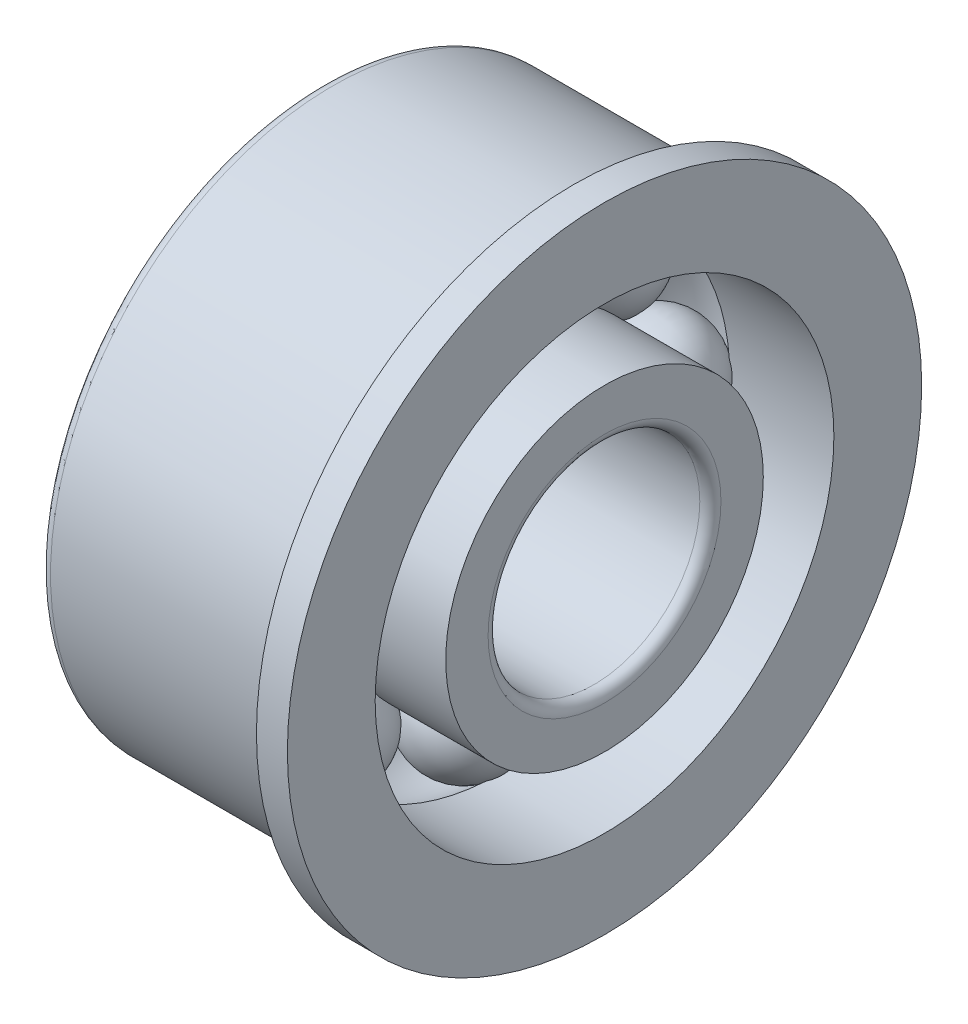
ISO-10303-21;
HEADER;
FILE_DESCRIPTION(('STEP AP214'),'2;1');
FILE_NAME('part.step','',(''),(''),'','','');
FILE_SCHEMA(('AUTOMOTIVE_DESIGN { 1 0 10303 214 1 1 1 1 }'));
ENDSEC;
DATA;
#1=APPLICATION_CONTEXT('core data for automotive mechanical design processes');
#2=APPLICATION_PROTOCOL_DEFINITION('international standard','automotive_design',2000,#1);
#3=PRODUCT_CONTEXT('',#1,'mechanical');
#4=PRODUCT('Part','Part','',(#3));
#5=PRODUCT_RELATED_PRODUCT_CATEGORY('part','',(#4));
#6=PRODUCT_DEFINITION_FORMATION('','',#4);
#7=PRODUCT_DEFINITION_CONTEXT('part definition',#1,'design');
#8=PRODUCT_DEFINITION('design','',#6,#7);
#9=PRODUCT_DEFINITION_SHAPE('','',#8);
#10=(LENGTH_UNIT() NAMED_UNIT(*) SI_UNIT(.MILLI.,.METRE.));
#11=(NAMED_UNIT(*) PLANE_ANGLE_UNIT() SI_UNIT($,.RADIAN.));
#12=(NAMED_UNIT(*) SI_UNIT($,.STERADIAN.) SOLID_ANGLE_UNIT());
#13=UNCERTAINTY_MEASURE_WITH_UNIT(LENGTH_MEASURE(1.E-05),#10,'distance_accuracy_value','');
#14=(GEOMETRIC_REPRESENTATION_CONTEXT(3) GLOBAL_UNCERTAINTY_ASSIGNED_CONTEXT((#13)) GLOBAL_UNIT_ASSIGNED_CONTEXT((#10,
#11,#12)) REPRESENTATION_CONTEXT('',''));
#15=CARTESIAN_POINT('',(0.,0.,0.));
#16=DIRECTION('',(0.,0.,1.));
#17=DIRECTION('',(1.,0.,0.));
#18=AXIS2_PLACEMENT_3D('',#15,#16,#17);
#19=CARTESIAN_POINT('',(0.,0.,0.));
#20=DIRECTION('',(1.,0.,0.));
#21=DIRECTION('',(0.,0.,-1.));
#22=AXIS2_PLACEMENT_3D('',#19,#20,#21);
#23=TOROIDAL_SURFACE('',#22,2.75,0.725);
#24=CARTESIAN_POINT('',(0.525000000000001,0.,0.));
#25=DIRECTION('',(1.,0.,0.));
#26=DIRECTION('',(0.,0.,-1.));
#27=AXIS2_PLACEMENT_3D('',#24,#25,#26);
#28=CIRCLE('',#27,2.25);
#29=CARTESIAN_POINT('',(0.525000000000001,1.46351902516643,1.70897983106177));
#30=VERTEX_POINT('',#29);
#31=CARTESIAN_POINT('',(0.525000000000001,0.173567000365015,2.24329545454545));
#32=VERTEX_POINT('',#31);
#33=EDGE_CURVE('E431',#30,#32,#28,.T.);
#34=ORIENTED_EDGE('',*,*,#33,.F.);
#35=CARTESIAN_POINT('',(-0.525200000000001,1.46366183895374,1.70913412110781));
#36=CARTESIAN_POINT('',(-0.497120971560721,1.4435692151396,1.68742702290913));
#37=CARTESIAN_POINT('',(-0.4665073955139,1.42513136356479,1.66749086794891));
#38=CARTESIAN_POINT('',(-0.401196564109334,1.39201211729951,1.63165887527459));
#39=CARTESIAN_POINT('',(-0.366502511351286,1.37732780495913,1.61575989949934));
#40=CARTESIAN_POINT('',(-0.293951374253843,1.35212361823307,1.58845856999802));
#41=CARTESIAN_POINT('',(-0.256092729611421,1.34160581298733,1.57705845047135));
#42=CARTESIAN_POINT('',(-0.178314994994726,1.32503457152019,1.55909227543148));
#43=CARTESIAN_POINT('',(-0.138396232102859,1.31898042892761,1.55252545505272));
#44=CARTESIAN_POINT('',(-0.0576443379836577,1.3115061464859,1.54441771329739));
#45=CARTESIAN_POINT('',(-0.0168116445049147,1.31008383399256,1.54287443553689));
#46=CARTESIAN_POINT('',(0.0646308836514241,1.31190671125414,1.54485205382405));
#47=CARTESIAN_POINT('',(0.105240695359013,1.31515237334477,1.54837346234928));
#48=CARTESIAN_POINT('',(0.185069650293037,1.32621950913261,1.56037663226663));
#49=CARTESIAN_POINT('',(0.224289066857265,1.3340400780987,1.56885741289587));
#50=CARTESIAN_POINT('',(0.300232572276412,1.35403927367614,1.5905333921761));
#51=CARTESIAN_POINT('',(0.336957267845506,1.36621683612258,1.60372743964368));
#52=CARTESIAN_POINT('',(0.40008666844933,1.39183263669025,1.63146255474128));
#53=CARTESIAN_POINT('',(0.427113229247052,1.40457096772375,1.64524894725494));
#54=CARTESIAN_POINT('',(0.478366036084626,1.43240632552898,1.67535630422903));
#55=CARTESIAN_POINT('',(0.502594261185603,1.44750166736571,1.69167545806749));
#56=CARTESIAN_POINT('',(0.525200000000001,1.46366183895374,1.70913412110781));
#57=B_SPLINE_CURVE_WITH_KNOTS('',3,(#35,#36,#37,#38,#39,#40,#41,#42,#43,#44,#45,#46,#47,#48,#49,
#50,#51,#52,#53,#54,#55,#56),.UNSPECIFIED.,.F.,.F.,(4,2,2,2,2,2,2,2,2,2,4),(0.,
0.122190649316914,0.244286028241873,0.36644196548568,0.48857856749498,0.610657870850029,
0.732749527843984,0.854817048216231,0.9768547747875,1.07527797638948,1.17363113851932),.UNSPECIFIED.);
#58=CARTESIAN_POINT('',(-0.525000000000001,1.46351902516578,1.70897983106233));
#59=VERTEX_POINT('',#58);
#60=EDGE_CURVE('E247',#59,#30,#57,.T.);
#61=ORIENTED_EDGE('',*,*,#60,.F.);
#62=CARTESIAN_POINT('',(-0.525000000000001,0.,0.));
#63=DIRECTION('',(1.,0.,0.));
#64=DIRECTION('',(0.,0.,-1.));
#65=AXIS2_PLACEMENT_3D('',#62,#63,#64);
#66=CIRCLE('',#65,2.25);
#67=CARTESIAN_POINT('',(-0.525000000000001,0.173567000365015,2.24329545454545));
#68=VERTEX_POINT('',#67);
#69=EDGE_CURVE('E481',#59,#68,#66,.T.);
#70=ORIENTED_EDGE('',*,*,#69,.T.);
#71=CARTESIAN_POINT('',(0.5252,0.173575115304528,2.2435055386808));
#72=CARTESIAN_POINT('',(0.49712097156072,0.172433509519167,2.21394867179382));
#73=CARTESIAN_POINT('',(0.466507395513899,0.171374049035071,2.1868141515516));
#74=CARTESIAN_POINT('',(0.401196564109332,0.169455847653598,2.13805826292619));
#75=CARTESIAN_POINT('',(0.366502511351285,0.16859695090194,2.11643261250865));
#76=CARTESIAN_POINT('',(0.293951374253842,0.167114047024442,2.07930560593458));
#77=CARTESIAN_POINT('',(0.25609272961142,0.16649015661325,2.06380729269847));
#78=CARTESIAN_POINT('',(0.178314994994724,0.165503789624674,2.0393856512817));
#79=CARTESIAN_POINT('',(0.138396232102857,0.165141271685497,2.03046128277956));
#80=CARTESIAN_POINT('',(0.0576443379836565,0.164693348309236,2.01944312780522));
#81=CARTESIAN_POINT('',(0.0168116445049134,0.164607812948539,2.01734613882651));
#82=CARTESIAN_POINT('',(-0.0646308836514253,0.164717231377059,2.02003349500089));
#83=CARTESIAN_POINT('',(-0.105240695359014,0.164912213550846,2.02481853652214));
#84=CARTESIAN_POINT('',(-0.185069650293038,0.165574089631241,2.04113170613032));
#85=CARTESIAN_POINT('',(-0.224289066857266,0.16604092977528,2.05265850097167));
#86=CARTESIAN_POINT('',(-0.300232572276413,0.167226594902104,2.08212729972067));
#87=CARTESIAN_POINT('',(-0.336957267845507,0.167945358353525,2.10006773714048));
#88=CARTESIAN_POINT('',(-0.400086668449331,0.169443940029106,2.13779253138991));
#89=CARTESIAN_POINT('',(-0.427113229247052,0.170185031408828,2.1565483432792));
#90=CARTESIAN_POINT('',(-0.478366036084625,0.171791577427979,2.19752002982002));
#91=CARTESIAN_POINT('',(-0.502594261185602,0.172656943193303,2.2197334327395));
#92=CARTESIAN_POINT('',(-0.5252,0.173575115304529,2.2435055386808));
#93=B_SPLINE_CURVE_WITH_KNOTS('',3,(#71,#72,#73,#74,#75,#76,#77,#78,#79,#80,#81,#82,#83,#84,#85,
#86,#87,#88,#89,#90,#91,#92),.UNSPECIFIED.,.F.,.F.,(4,2,2,2,2,2,2,2,2,2,4),(0.,
0.122190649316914,0.244286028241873,0.36644196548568,0.48857856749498,0.610657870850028,
0.732749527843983,0.85481704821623,0.976854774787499,1.07527797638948,1.17363113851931),.UNSPECIFIED.);
#94=EDGE_CURVE('E434',#32,#68,#93,.T.);
#95=ORIENTED_EDGE('',*,*,#94,.F.);
#96=EDGE_LOOP('',(#34,#61,#70,#95));
#97=FACE_BOUND('',#96,.T.);
#98=ADVANCED_FACE('F26',(#97),#23,.F.);
#99=CARTESIAN_POINT('',(-0.525000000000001,2.24329545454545,0.173567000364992));
#100=VERTEX_POINT('',#99);
#101=CARTESIAN_POINT('',(-0.525000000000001,1.70897983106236,1.46351902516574));
#102=VERTEX_POINT('',#101);
#103=EDGE_CURVE('E265',#100,#102,#66,.T.);
#104=ORIENTED_EDGE('',*,*,#103,.T.);
#105=CARTESIAN_POINT('',(0.5252,1.70913412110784,1.4636618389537));
#106=CARTESIAN_POINT('',(0.497120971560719,1.68742702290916,1.44356921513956));
#107=CARTESIAN_POINT('',(0.466507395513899,1.66749086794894,1.42513136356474));
#108=CARTESIAN_POINT('',(0.401196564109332,1.63165887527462,1.39201211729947));
#109=CARTESIAN_POINT('',(0.366502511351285,1.61575989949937,1.37732780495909));
#110=CARTESIAN_POINT('',(0.293951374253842,1.58845856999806,1.35212361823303));
#111=CARTESIAN_POINT('',(0.25609272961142,1.57705845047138,1.34160581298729));
#112=CARTESIAN_POINT('',(0.178314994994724,1.55909227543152,1.32503457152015));
#113=CARTESIAN_POINT('',(0.138396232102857,1.55252545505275,1.31898042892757));
#114=CARTESIAN_POINT('',(0.0576443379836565,1.54441771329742,1.31150614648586));
#115=CARTESIAN_POINT('',(0.0168116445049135,1.54287443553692,1.31008383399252));
#116=CARTESIAN_POINT('',(-0.0646308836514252,1.54485205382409,1.3119067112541));
#117=CARTESIAN_POINT('',(-0.105240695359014,1.54837346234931,1.31515237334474));
#118=CARTESIAN_POINT('',(-0.185069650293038,1.56037663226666,1.32621950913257));
#119=CARTESIAN_POINT('',(-0.224289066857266,1.56885741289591,1.33404007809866));
#120=CARTESIAN_POINT('',(-0.300232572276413,1.59053339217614,1.3540392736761));
#121=CARTESIAN_POINT('',(-0.336957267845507,1.60372743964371,1.36621683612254));
#122=CARTESIAN_POINT('',(-0.40008666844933,1.63146255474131,1.39183263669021));
#123=CARTESIAN_POINT('',(-0.427113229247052,1.64524894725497,1.40457096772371));
#124=CARTESIAN_POINT('',(-0.478366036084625,1.67535630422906,1.43240632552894));
#125=CARTESIAN_POINT('',(-0.502594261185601,1.69167545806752,1.44750166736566));
#126=CARTESIAN_POINT('',(-0.5252,1.70913412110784,1.4636618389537));
#127=B_SPLINE_CURVE_WITH_KNOTS('',3,(#105,#106,#107,#108,#109,#110,#111,#112,#113,#114,#115,
#116,#117,#118,#119,#120,#121,#122,#123,#124,#125,#126),.UNSPECIFIED.,.F.,.F.,(4,2,2,2,2,2,2,2,
2,2,4),(0.,0.122190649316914,0.244286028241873,0.36644196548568,0.48857856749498,
0.610657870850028,0.732749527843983,0.85481704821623,0.976854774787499,1.07527797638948,
1.17363113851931),.UNSPECIFIED.);
#128=CARTESIAN_POINT('',(0.525000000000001,1.70897983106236,1.46351902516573));
#129=VERTEX_POINT('',#128);
#130=EDGE_CURVE('E46',#129,#102,#127,.T.);
#131=ORIENTED_EDGE('',*,*,#130,.F.);
#132=CARTESIAN_POINT('',(0.525000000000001,2.24329545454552,0.17356700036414));
#133=VERTEX_POINT('',#132);
#134=EDGE_CURVE('E379',#133,#129,#28,.T.);
#135=ORIENTED_EDGE('',*,*,#134,.F.);
#136=CARTESIAN_POINT('',(-0.525200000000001,2.2435055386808,0.173575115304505));
#137=CARTESIAN_POINT('',(-0.497120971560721,2.21394867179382,0.172433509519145));
#138=CARTESIAN_POINT('',(-0.4665073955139,2.1868141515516,0.171374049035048));
#139=CARTESIAN_POINT('',(-0.401196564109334,2.1380582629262,0.169455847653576));
#140=CARTESIAN_POINT('',(-0.366502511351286,2.11643261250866,0.168596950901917));
#141=CARTESIAN_POINT('',(-0.293951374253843,2.07930560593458,0.167114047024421));
#142=CARTESIAN_POINT('',(-0.256092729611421,2.06380729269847,0.16649015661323));
#143=CARTESIAN_POINT('',(-0.178314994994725,2.0393856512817,0.165503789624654));
#144=CARTESIAN_POINT('',(-0.138396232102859,2.03046128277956,0.165141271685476));
#145=CARTESIAN_POINT('',(-0.0576443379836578,2.01944312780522,0.164693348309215));
#146=CARTESIAN_POINT('',(-0.0168116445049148,2.01734613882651,0.164607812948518));
#147=CARTESIAN_POINT('',(0.064630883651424,2.02003349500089,0.164717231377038));
#148=CARTESIAN_POINT('',(0.105240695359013,2.02481853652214,0.164912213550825));
#149=CARTESIAN_POINT('',(0.185069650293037,2.04113170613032,0.165574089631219));
#150=CARTESIAN_POINT('',(0.224289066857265,2.05265850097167,0.166040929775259));
#151=CARTESIAN_POINT('',(0.300232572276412,2.08212729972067,0.167226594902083));
#152=CARTESIAN_POINT('',(0.336957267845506,2.10006773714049,0.167945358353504));
#153=CARTESIAN_POINT('',(0.40008666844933,2.13779253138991,0.169443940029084));
#154=CARTESIAN_POINT('',(0.427113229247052,2.1565483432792,0.170185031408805));
#155=CARTESIAN_POINT('',(0.478366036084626,2.19752002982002,0.171791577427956));
#156=CARTESIAN_POINT('',(0.502594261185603,2.2197334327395,0.172656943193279));
#157=CARTESIAN_POINT('',(0.525200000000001,2.2435055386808,0.173575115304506));
#158=B_SPLINE_CURVE_WITH_KNOTS('',3,(#136,#137,#138,#139,#140,#141,#142,#143,#144,#145,#146,
#147,#148,#149,#150,#151,#152,#153,#154,#155,#156,#157),.UNSPECIFIED.,.F.,.F.,(4,2,2,2,2,2,2,2,
2,2,4),(0.,0.122190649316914,0.244286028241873,0.36644196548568,0.48857856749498,
0.610657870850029,0.732749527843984,0.854817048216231,0.9768547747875,1.07527797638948,
1.17363113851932),.UNSPECIFIED.);
#159=EDGE_CURVE('E378',#100,#133,#158,.T.);
#160=ORIENTED_EDGE('',*,*,#159,.F.);
#161=EDGE_LOOP('',(#104,#131,#135,#160));
#162=FACE_BOUND('',#161,.T.);
#163=ADVANCED_FACE('F399',(#162),#23,.F.);
#164=CARTESIAN_POINT('',(-20.6375,0.,0.));
#165=DIRECTION('',(1.,0.,0.));
#166=DIRECTION('',(0.,0.,-1.));
#167=AXIS2_PLACEMENT_3D('',#164,#165,#166);
#168=CYLINDRICAL_SURFACE('',#167,2.25);
#169=CARTESIAN_POINT('',(2.,0.,0.));
#170=DIRECTION('',(1.,0.,0.));
#171=DIRECTION('',(0.,0.,-1.));
#172=AXIS2_PLACEMENT_3D('',#169,#170,#171);
#173=CIRCLE('',#172,2.25);
#174=CARTESIAN_POINT('',(2.,0.,-2.25));
#175=VERTEX_POINT('',#174);
#176=EDGE_CURVE('E461',#175,#175,#173,.T.);
#177=ORIENTED_EDGE('',*,*,#176,.F.);
#178=EDGE_LOOP('',(#177));
#179=FACE_BOUND('',#178,.T.);
#180=ORIENTED_EDGE('',*,*,#134,.T.);
#181=CARTESIAN_POINT('',(0.524799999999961,1.46314364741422,1.70930122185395));
#182=CARTESIAN_POINT('',(0.534438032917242,1.48115003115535,1.69390895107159));
#183=CARTESIAN_POINT('',(0.542113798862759,1.49950540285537,1.67768472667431));
#184=CARTESIAN_POINT('',(0.553352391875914,1.53634670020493,1.64400189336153));
#185=CARTESIAN_POINT('',(0.556914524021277,1.55483264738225,1.62654307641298));
#186=CARTESIAN_POINT('',(0.559736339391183,1.59139072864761,1.59079720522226));
#187=CARTESIAN_POINT('',(0.558989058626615,1.60946214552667,1.57250885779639));
#188=CARTESIAN_POINT('',(0.553215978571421,1.64460368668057,1.53571500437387));
#189=CARTESIAN_POINT('',(0.548198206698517,1.66167562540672,1.51720997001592));
#190=CARTESIAN_POINT('',(0.536564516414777,1.68878752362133,1.48686392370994));
#191=CARTESIAN_POINT('',(0.531096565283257,1.69922212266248,1.47492562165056));
#192=CARTESIAN_POINT('',(0.524800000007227,1.70930122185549,1.46314364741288));
#193=B_SPLINE_CURVE_WITH_KNOTS('',3,(#181,#182,#183,#184,#185,#186,#187,#188,#189,#190,#191,
#192),.UNSPECIFIED.,.F.,.F.,(4,2,2,2,2,4),(0.,0.0766477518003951,0.153308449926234,
0.23009306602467,0.306733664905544,0.356942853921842),.UNSPECIFIED.);
#194=EDGE_CURVE('E1062',#30,#129,#193,.T.);
#195=ORIENTED_EDGE('',*,*,#194,.F.);
#196=ORIENTED_EDGE('',*,*,#33,.T.);
#197=CARTESIAN_POINT('',(0.524799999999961,-0.174059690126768,2.24325727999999));
#198=CARTESIAN_POINT('',(0.534438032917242,-0.150443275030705,2.24510573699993));
#199=CARTESIAN_POINT('',(0.542113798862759,-0.125991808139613,2.2466126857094));
#200=CARTESIAN_POINT('',(0.553352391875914,-0.0761237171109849,2.24884605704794));
#201=CARTESIAN_POINT('',(0.556914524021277,-0.0507069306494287,2.24957234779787));
#202=CARTESIAN_POINT('',(0.559736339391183,0.000419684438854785,2.2501466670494));
#203=CARTESIAN_POINT('',(0.558989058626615,0.0261299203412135,2.2499932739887));
#204=CARTESIAN_POINT('',(0.553215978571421,0.0769959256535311,2.24882491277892));
#205=CARTESIAN_POINT('',(0.548198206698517,0.102152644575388,2.24781156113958));
#206=CARTESIAN_POINT('',(0.536564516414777,0.142781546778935,2.24552467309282));
#207=CARTESIAN_POINT('',(0.531096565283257,0.15860157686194,2.24446139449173));
#208=CARTESIAN_POINT('',(0.524800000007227,0.174059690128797,2.24325728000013));
#209=B_SPLINE_CURVE_WITH_KNOTS('',3,(#197,#198,#199,#200,#201,#202,#203,#204,#205,#206,#207,
#208),.UNSPECIFIED.,.F.,.F.,(4,2,2,2,2,4),(0.,0.0766477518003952,0.153308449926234,
0.23009306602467,0.306733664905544,0.356942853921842),.UNSPECIFIED.);
#210=CARTESIAN_POINT('',(0.525000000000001,-0.173567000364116,2.24329545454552));
#211=VERTEX_POINT('',#210);
#212=EDGE_CURVE('E598',#211,#32,#209,.T.);
#213=ORIENTED_EDGE('',*,*,#212,.F.);
#214=CARTESIAN_POINT('',(0.525000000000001,-1.46351902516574,1.70897983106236));
#215=VERTEX_POINT('',#214);
#216=EDGE_CURVE('E439',#211,#215,#28,.T.);
#217=ORIENTED_EDGE('',*,*,#216,.T.);
#218=CARTESIAN_POINT('',(0.524799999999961,-1.70930122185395,1.46314364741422));
#219=CARTESIAN_POINT('',(0.534438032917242,-1.6939089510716,1.48115003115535));
#220=CARTESIAN_POINT('',(0.542113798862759,-1.67768472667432,1.49950540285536));
#221=CARTESIAN_POINT('',(0.553352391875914,-1.64400189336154,1.53634670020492));
#222=CARTESIAN_POINT('',(0.556914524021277,-1.62654307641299,1.55483264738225));
#223=CARTESIAN_POINT('',(0.559736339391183,-1.59079720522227,1.59139072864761));
#224=CARTESIAN_POINT('',(0.558989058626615,-1.5725088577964,1.60946214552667));
#225=CARTESIAN_POINT('',(0.553215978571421,-1.53571500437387,1.64460368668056));
#226=CARTESIAN_POINT('',(0.548198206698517,-1.51720997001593,1.66167562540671));
#227=CARTESIAN_POINT('',(0.536564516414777,-1.48686392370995,1.68878752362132));
#228=CARTESIAN_POINT('',(0.531096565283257,-1.47492562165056,1.69922212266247));
#229=CARTESIAN_POINT('',(0.524800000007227,-1.46314364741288,1.70930122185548));
#230=B_SPLINE_CURVE_WITH_KNOTS('',3,(#218,#219,#220,#221,#222,#223,#224,#225,#226,#227,#228,
#229),.UNSPECIFIED.,.F.,.F.,(4,2,2,2,2,4),(0.,0.0766477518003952,0.153308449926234,
0.23009306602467,0.306733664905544,0.356942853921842),.UNSPECIFIED.);
#231=CARTESIAN_POINT('',(0.525000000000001,-1.70897983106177,1.46351902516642));
#232=VERTEX_POINT('',#231);
#233=EDGE_CURVE('E694',#232,#215,#230,.T.);
#234=ORIENTED_EDGE('',*,*,#233,.F.);
#235=CARTESIAN_POINT('',(0.525000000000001,-2.24329545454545,0.173567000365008));
#236=VERTEX_POINT('',#235);
#237=EDGE_CURVE('E442',#232,#236,#28,.T.);
#238=ORIENTED_EDGE('',*,*,#237,.T.);
#239=CARTESIAN_POINT('',(0.524799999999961,-2.24325727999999,-0.174059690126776));
#240=CARTESIAN_POINT('',(0.534438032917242,-2.24510573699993,-0.150443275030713));
#241=CARTESIAN_POINT('',(0.542113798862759,-2.2466126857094,-0.12599180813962));
#242=CARTESIAN_POINT('',(0.553352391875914,-2.24884605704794,-0.0761237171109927));
#243=CARTESIAN_POINT('',(0.556914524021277,-2.24957234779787,-0.0507069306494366));
#244=CARTESIAN_POINT('',(0.559736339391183,-2.2501466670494,0.000419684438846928));
#245=CARTESIAN_POINT('',(0.558989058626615,-2.2499932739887,0.0261299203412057));
#246=CARTESIAN_POINT('',(0.553215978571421,-2.24882491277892,0.0769959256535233));
#247=CARTESIAN_POINT('',(0.548198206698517,-2.24781156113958,0.10215264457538));
#248=CARTESIAN_POINT('',(0.536564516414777,-2.24552467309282,0.142781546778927));
#249=CARTESIAN_POINT('',(0.531096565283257,-2.24446139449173,0.158601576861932));
#250=CARTESIAN_POINT('',(0.524800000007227,-2.24325728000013,0.174059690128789));
#251=B_SPLINE_CURVE_WITH_KNOTS('',3,(#239,#240,#241,#242,#243,#244,#245,#246,#247,#248,#249,
#250),.UNSPECIFIED.,.F.,.F.,(4,2,2,2,2,4),(0.,0.0766477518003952,0.153308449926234,
0.23009306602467,0.306733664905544,0.356942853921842),.UNSPECIFIED.);
#252=CARTESIAN_POINT('',(0.525000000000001,-2.24329545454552,-0.173567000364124));
#253=VERTEX_POINT('',#252);
#254=EDGE_CURVE('E751',#253,#236,#251,.T.);
#255=ORIENTED_EDGE('',*,*,#254,.F.);
#256=CARTESIAN_POINT('',(0.525000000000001,-1.70897983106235,-1.46351902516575));
#257=VERTEX_POINT('',#256);
#258=EDGE_CURVE('E446',#253,#257,#28,.T.);
#259=ORIENTED_EDGE('',*,*,#258,.T.);
#260=CARTESIAN_POINT('',(0.524799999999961,-1.46314364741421,-1.70930122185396));
#261=CARTESIAN_POINT('',(0.534438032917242,-1.48115003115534,-1.6939089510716));
#262=CARTESIAN_POINT('',(0.542113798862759,-1.49950540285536,-1.67768472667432));
#263=CARTESIAN_POINT('',(0.553352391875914,-1.53634670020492,-1.64400189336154));
#264=CARTESIAN_POINT('',(0.556914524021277,-1.55483264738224,-1.62654307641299));
#265=CARTESIAN_POINT('',(0.559736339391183,-1.5913907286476,-1.59079720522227));
#266=CARTESIAN_POINT('',(0.558989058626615,-1.60946214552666,-1.5725088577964));
#267=CARTESIAN_POINT('',(0.553215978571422,-1.64460368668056,-1.53571500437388));
#268=CARTESIAN_POINT('',(0.548198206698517,-1.66167562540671,-1.51720997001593));
#269=CARTESIAN_POINT('',(0.536564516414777,-1.68878752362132,-1.48686392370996));
#270=CARTESIAN_POINT('',(0.531096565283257,-1.69922212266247,-1.47492562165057));
#271=CARTESIAN_POINT('',(0.524800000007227,-1.70930122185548,-1.46314364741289));
#272=B_SPLINE_CURVE_WITH_KNOTS('',3,(#260,#261,#262,#263,#264,#265,#266,#267,#268,#269,#270,
#271),.UNSPECIFIED.,.F.,.F.,(4,2,2,2,2,4),(0.,0.0766477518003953,0.153308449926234,
0.23009306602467,0.306733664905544,0.356942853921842),.UNSPECIFIED.);
#273=CARTESIAN_POINT('',(0.525000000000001,-1.46351902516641,-1.70897983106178));
#274=VERTEX_POINT('',#273);
#275=EDGE_CURVE('E808',#274,#257,#272,.T.);
#276=ORIENTED_EDGE('',*,*,#275,.F.);
#277=CARTESIAN_POINT('',(0.525000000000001,-0.173567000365,-2.24329545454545));
#278=VERTEX_POINT('',#277);
#279=EDGE_CURVE('E450',#274,#278,#28,.T.);
#280=ORIENTED_EDGE('',*,*,#279,.T.);
#281=CARTESIAN_POINT('',(0.524799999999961,0.174059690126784,-2.24325727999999));
#282=CARTESIAN_POINT('',(0.534438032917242,0.15044327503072,-2.24510573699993));
#283=CARTESIAN_POINT('',(0.542113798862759,0.125991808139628,-2.2466126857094));
#284=CARTESIAN_POINT('',(0.553352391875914,0.0761237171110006,-2.24884605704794));
#285=CARTESIAN_POINT('',(0.556914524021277,0.0507069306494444,-2.24957234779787));
#286=CARTESIAN_POINT('',(0.559736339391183,-0.000419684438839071,-2.2501466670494));
#287=CARTESIAN_POINT('',(0.558989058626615,-0.0261299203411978,-2.2499932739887));
#288=CARTESIAN_POINT('',(0.553215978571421,-0.0769959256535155,-2.24882491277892));
#289=CARTESIAN_POINT('',(0.548198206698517,-0.102152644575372,-2.24781156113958));
#290=CARTESIAN_POINT('',(0.536564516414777,-0.142781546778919,-2.24552467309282));
#291=CARTESIAN_POINT('',(0.531096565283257,-0.158601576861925,-2.24446139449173));
#292=CARTESIAN_POINT('',(0.524800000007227,-0.174059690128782,-2.24325728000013));
#293=B_SPLINE_CURVE_WITH_KNOTS('',3,(#281,#282,#283,#284,#285,#286,#287,#288,#289,#290,#291,
#292),.UNSPECIFIED.,.F.,.F.,(4,2,2,2,2,4),(0.,0.0766477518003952,0.153308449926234,
0.23009306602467,0.306733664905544,0.356942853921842),.UNSPECIFIED.);
#294=CARTESIAN_POINT('',(0.525000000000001,0.173567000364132,-2.24329545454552));
#295=VERTEX_POINT('',#294);
#296=EDGE_CURVE('E864',#295,#278,#293,.T.);
#297=ORIENTED_EDGE('',*,*,#296,.F.);
#298=CARTESIAN_POINT('',(0.525000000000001,1.46351902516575,-1.70897983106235));
#299=VERTEX_POINT('',#298);
#300=EDGE_CURVE('E454',#295,#299,#28,.T.);
#301=ORIENTED_EDGE('',*,*,#300,.T.);
#302=CARTESIAN_POINT('',(0.524799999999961,1.70930122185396,-1.4631436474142));
#303=CARTESIAN_POINT('',(0.534438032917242,1.69390895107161,-1.48115003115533));
#304=CARTESIAN_POINT('',(0.542113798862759,1.67768472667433,-1.49950540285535));
#305=CARTESIAN_POINT('',(0.553352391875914,1.64400189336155,-1.53634670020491));
#306=CARTESIAN_POINT('',(0.556914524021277,1.626543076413,-1.55483264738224));
#307=CARTESIAN_POINT('',(0.559736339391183,1.59079720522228,-1.5913907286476));
#308=CARTESIAN_POINT('',(0.558989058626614,1.57250885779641,-1.60946214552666));
#309=CARTESIAN_POINT('',(0.553215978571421,1.53571500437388,-1.64460368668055));
#310=CARTESIAN_POINT('',(0.548198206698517,1.51720997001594,-1.6616756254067));
#311=CARTESIAN_POINT('',(0.536564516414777,1.48686392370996,-1.68878752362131));
#312=CARTESIAN_POINT('',(0.531096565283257,1.47492562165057,-1.69922212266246));
#313=CARTESIAN_POINT('',(0.524800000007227,1.4631436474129,-1.70930122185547));
#314=B_SPLINE_CURVE_WITH_KNOTS('',3,(#302,#303,#304,#305,#306,#307,#308,#309,#310,#311,#312,
#313),.UNSPECIFIED.,.F.,.F.,(4,2,2,2,2,4),(0.,0.0766477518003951,0.153308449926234,
0.23009306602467,0.306733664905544,0.356942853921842),.UNSPECIFIED.);
#315=CARTESIAN_POINT('',(0.525000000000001,1.70897983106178,-1.46351902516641));
#316=VERTEX_POINT('',#315);
#317=EDGE_CURVE('E518',#316,#299,#314,.T.);
#318=ORIENTED_EDGE('',*,*,#317,.F.);
#319=CARTESIAN_POINT('',(0.525000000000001,2.24329545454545,-0.173567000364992));
#320=VERTEX_POINT('',#319);
#321=EDGE_CURVE('E441',#316,#320,#28,.T.);
#322=ORIENTED_EDGE('',*,*,#321,.T.);
#323=CARTESIAN_POINT('',(0.524799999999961,2.24325727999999,0.174059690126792));
#324=CARTESIAN_POINT('',(0.534438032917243,2.24510573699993,0.150443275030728));
#325=CARTESIAN_POINT('',(0.54211379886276,2.2466126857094,0.125991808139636));
#326=CARTESIAN_POINT('',(0.553352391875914,2.24884605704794,0.0761237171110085));
#327=CARTESIAN_POINT('',(0.556914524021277,2.24957234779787,0.0507069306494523));
#328=CARTESIAN_POINT('',(0.559736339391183,2.2501466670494,-0.000419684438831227));
#329=CARTESIAN_POINT('',(0.558989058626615,2.2499932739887,-0.02612992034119));
#330=CARTESIAN_POINT('',(0.553215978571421,2.24882491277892,-0.0769959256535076));
#331=CARTESIAN_POINT('',(0.548198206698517,2.24781156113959,-0.102152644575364));
#332=CARTESIAN_POINT('',(0.536564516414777,2.24552467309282,-0.142781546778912));
#333=CARTESIAN_POINT('',(0.531096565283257,2.24446139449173,-0.158601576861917));
#334=CARTESIAN_POINT('',(0.524800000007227,2.24325728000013,-0.174059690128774));
#335=B_SPLINE_CURVE_WITH_KNOTS('',3,(#323,#324,#325,#326,#327,#328,#329,#330,#331,#332,#333,
#334),.UNSPECIFIED.,.F.,.F.,(4,2,2,2,2,4),(0.,0.0766477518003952,0.153308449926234,
0.23009306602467,0.306733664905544,0.356942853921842),.UNSPECIFIED.);
#336=EDGE_CURVE('E340',#133,#320,#335,.T.);
#337=ORIENTED_EDGE('',*,*,#336,.F.);
#338=EDGE_LOOP('',(#180,#195,#196,#213,#217,#234,#238,#255,#259,#276,#280,#297,#301,#318,#322,#337));
#339=FACE_BOUND('',#338,.T.);
#340=ADVANCED_FACE('F366',(#179,#339),#168,.T.);
#341=CARTESIAN_POINT('',(-20.6375,0.,0.));
#342=DIRECTION('',(1.,0.,0.));
#343=DIRECTION('',(0.,0.,-1.));
#344=AXIS2_PLACEMENT_3D('',#341,#342,#343);
#345=CYLINDRICAL_SURFACE('',#344,2.25);
#346=CARTESIAN_POINT('',(-2.,0.,0.));
#347=DIRECTION('',(1.,0.,0.));
#348=DIRECTION('',(0.,0.,-1.));
#349=AXIS2_PLACEMENT_3D('',#346,#347,#348);
#350=CIRCLE('',#349,2.25);
#351=CARTESIAN_POINT('',(-2.,0.,-2.25));
#352=VERTEX_POINT('',#351);
#353=EDGE_CURVE('E478',#352,#352,#350,.T.);
#354=ORIENTED_EDGE('',*,*,#353,.T.);
#355=EDGE_LOOP('',(#354));
#356=FACE_BOUND('',#355,.T.);
#357=ORIENTED_EDGE('',*,*,#69,.F.);
#358=CARTESIAN_POINT('',(-0.5248,1.70930122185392,1.46314364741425));
#359=CARTESIAN_POINT('',(-0.534438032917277,1.69390895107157,1.48115003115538));
#360=CARTESIAN_POINT('',(-0.542113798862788,1.67768472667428,1.4995054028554));
#361=CARTESIAN_POINT('',(-0.553352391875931,1.6440018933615,1.53634670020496));
#362=CARTESIAN_POINT('',(-0.556914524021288,1.62654307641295,1.55483264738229));
#363=CARTESIAN_POINT('',(-0.559736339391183,1.59079720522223,1.59139072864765));
#364=CARTESIAN_POINT('',(-0.558989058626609,1.57250885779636,1.60946214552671));
#365=CARTESIAN_POINT('',(-0.553215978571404,1.53571500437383,1.6446036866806));
#366=CARTESIAN_POINT('',(-0.548198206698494,1.51720997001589,1.66167562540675));
#367=CARTESIAN_POINT('',(-0.536564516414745,1.48686392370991,1.68878752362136));
#368=CARTESIAN_POINT('',(-0.531096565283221,1.47492562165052,1.6992221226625));
#369=CARTESIAN_POINT('',(-0.524800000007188,1.46314364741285,1.70930122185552));
#370=B_SPLINE_CURVE_WITH_KNOTS('',3,(#358,#359,#360,#361,#362,#363,#364,#365,#366,#367,#368,
#369),.UNSPECIFIED.,.F.,.F.,(4,2,2,2,2,4),(0.,0.0766477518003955,0.153308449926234,
0.23009306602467,0.306733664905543,0.356942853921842),.UNSPECIFIED.);
#371=EDGE_CURVE('E601',#102,#59,#370,.T.);
#372=ORIENTED_EDGE('',*,*,#371,.F.);
#373=ORIENTED_EDGE('',*,*,#103,.F.);
#374=CARTESIAN_POINT('',(-0.5248,2.24325728,-0.174059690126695));
#375=CARTESIAN_POINT('',(-0.534438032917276,2.24510573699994,-0.150443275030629));
#376=CARTESIAN_POINT('',(-0.542113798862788,2.24661268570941,-0.125991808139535));
#377=CARTESIAN_POINT('',(-0.553352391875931,2.24884605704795,-0.0761237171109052));
#378=CARTESIAN_POINT('',(-0.556914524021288,2.24957234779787,-0.0507069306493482));
#379=CARTESIAN_POINT('',(-0.559736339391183,2.2501466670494,0.000419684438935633));
#380=CARTESIAN_POINT('',(-0.558989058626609,2.2499932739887,0.0261299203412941));
#381=CARTESIAN_POINT('',(-0.553215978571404,2.24882491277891,0.0769959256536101));
#382=CARTESIAN_POINT('',(-0.548198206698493,2.24781156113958,0.102152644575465));
#383=CARTESIAN_POINT('',(-0.536564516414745,2.24552467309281,0.142781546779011));
#384=CARTESIAN_POINT('',(-0.531096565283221,2.24446139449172,0.158601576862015));
#385=CARTESIAN_POINT('',(-0.524800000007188,2.24325728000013,0.174059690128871));
#386=B_SPLINE_CURVE_WITH_KNOTS('',3,(#374,#375,#376,#377,#378,#379,#380,#381,#382,#383,#384,
#385),.UNSPECIFIED.,.F.,.F.,(4,2,2,2,2,4),(0.,0.0766477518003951,0.153308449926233,
0.230093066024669,0.306733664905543,0.356942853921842),.UNSPECIFIED.);
#387=CARTESIAN_POINT('',(-0.525000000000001,2.24329545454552,-0.17356700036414));
#388=VERTEX_POINT('',#387);
#389=EDGE_CURVE('E371',#388,#100,#386,.T.);
#390=ORIENTED_EDGE('',*,*,#389,.F.);
#391=CARTESIAN_POINT('',(-0.525000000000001,1.70897983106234,-1.46351902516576));
#392=VERTEX_POINT('',#391);
#393=EDGE_CURVE('E260',#392,#388,#66,.T.);
#394=ORIENTED_EDGE('',*,*,#393,.F.);
#395=CARTESIAN_POINT('',(-0.5248,1.46314364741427,-1.70930122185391));
#396=CARTESIAN_POINT('',(-0.534438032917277,1.4811500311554,-1.69390895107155));
#397=CARTESIAN_POINT('',(-0.542113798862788,1.49950540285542,-1.67768472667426));
#398=CARTESIAN_POINT('',(-0.553352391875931,1.53634670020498,-1.64400189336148));
#399=CARTESIAN_POINT('',(-0.556914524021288,1.55483264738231,-1.62654307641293));
#400=CARTESIAN_POINT('',(-0.559736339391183,1.59139072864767,-1.59079720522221));
#401=CARTESIAN_POINT('',(-0.558989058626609,1.60946214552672,-1.57250885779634));
#402=CARTESIAN_POINT('',(-0.553215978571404,1.64460368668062,-1.53571500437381));
#403=CARTESIAN_POINT('',(-0.548198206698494,1.66167562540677,-1.51720997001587));
#404=CARTESIAN_POINT('',(-0.536564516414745,1.68878752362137,-1.48686392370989));
#405=CARTESIAN_POINT('',(-0.531096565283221,1.69922212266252,-1.4749256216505));
#406=CARTESIAN_POINT('',(-0.524800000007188,1.70930122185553,-1.46314364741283));
#407=B_SPLINE_CURVE_WITH_KNOTS('',3,(#395,#396,#397,#398,#399,#400,#401,#402,#403,#404,#405,
#406),.UNSPECIFIED.,.F.,.F.,(4,2,2,2,2,4),(0.,0.0766477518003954,0.153308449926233,
0.23009306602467,0.306733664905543,0.356942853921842),.UNSPECIFIED.);
#408=CARTESIAN_POINT('',(-0.525000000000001,1.46351902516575,-1.70897983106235));
#409=VERTEX_POINT('',#408);
#410=EDGE_CURVE('E301',#409,#392,#407,.T.);
#411=ORIENTED_EDGE('',*,*,#410,.F.);
#412=CARTESIAN_POINT('',(-0.525000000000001,0.173567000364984,-2.24329545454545));
#413=VERTEX_POINT('',#412);
#414=EDGE_CURVE('E263',#413,#409,#66,.T.);
#415=ORIENTED_EDGE('',*,*,#414,.F.);
#416=CARTESIAN_POINT('',(-0.5248,-0.174059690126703,-2.24325728));
#417=CARTESIAN_POINT('',(-0.534438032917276,-0.150443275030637,-2.24510573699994));
#418=CARTESIAN_POINT('',(-0.542113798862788,-0.125991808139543,-2.24661268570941));
#419=CARTESIAN_POINT('',(-0.553352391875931,-0.076123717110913,-2.24884605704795));
#420=CARTESIAN_POINT('',(-0.556914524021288,-0.0507069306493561,-2.24957234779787));
#421=CARTESIAN_POINT('',(-0.559736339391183,0.000419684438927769,-2.2501466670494));
#422=CARTESIAN_POINT('',(-0.558989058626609,0.0261299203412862,-2.2499932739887));
#423=CARTESIAN_POINT('',(-0.553215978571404,0.0769959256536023,-2.24882491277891));
#424=CARTESIAN_POINT('',(-0.548198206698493,0.102152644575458,-2.24781156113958));
#425=CARTESIAN_POINT('',(-0.536564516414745,0.142781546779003,-2.24552467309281));
#426=CARTESIAN_POINT('',(-0.531096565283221,0.158601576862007,-2.24446139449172));
#427=CARTESIAN_POINT('',(-0.524800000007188,0.174059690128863,-2.24325728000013));
#428=B_SPLINE_CURVE_WITH_KNOTS('',3,(#416,#417,#418,#419,#420,#421,#422,#423,#424,#425,#426,
#427),.UNSPECIFIED.,.F.,.F.,(4,2,2,2,2,4),(0.,0.0766477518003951,0.153308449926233,
0.230093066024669,0.306733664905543,0.356942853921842),.UNSPECIFIED.);
#429=CARTESIAN_POINT('',(-0.525000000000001,-0.173567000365,-2.24329545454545));
#430=VERTEX_POINT('',#429);
#431=EDGE_CURVE('E530',#430,#413,#428,.T.);
#432=ORIENTED_EDGE('',*,*,#431,.F.);
#433=CARTESIAN_POINT('',(-0.525000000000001,-1.46351902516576,-1.70897983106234));
#434=VERTEX_POINT('',#433);
#435=EDGE_CURVE('E496',#434,#430,#66,.T.);
#436=ORIENTED_EDGE('',*,*,#435,.F.);
#437=CARTESIAN_POINT('',(-0.5248,-1.70930122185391,-1.46314364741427));
#438=CARTESIAN_POINT('',(-0.534438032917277,-1.69390895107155,-1.4811500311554));
#439=CARTESIAN_POINT('',(-0.542113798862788,-1.67768472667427,-1.49950540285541));
#440=CARTESIAN_POINT('',(-0.553352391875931,-1.64400189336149,-1.53634670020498));
#441=CARTESIAN_POINT('',(-0.556914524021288,-1.62654307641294,-1.5548326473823));
#442=CARTESIAN_POINT('',(-0.559736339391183,-1.59079720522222,-1.59139072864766));
#443=CARTESIAN_POINT('',(-0.558989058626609,-1.57250885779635,-1.60946214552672));
#444=CARTESIAN_POINT('',(-0.553215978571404,-1.53571500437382,-1.64460368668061));
#445=CARTESIAN_POINT('',(-0.548198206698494,-1.51720997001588,-1.66167562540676));
#446=CARTESIAN_POINT('',(-0.536564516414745,-1.4868639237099,-1.68878752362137));
#447=CARTESIAN_POINT('',(-0.531096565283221,-1.47492562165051,-1.69922212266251));
#448=CARTESIAN_POINT('',(-0.524800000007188,-1.46314364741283,-1.70930122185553));
#449=B_SPLINE_CURVE_WITH_KNOTS('',3,(#437,#438,#439,#440,#441,#442,#443,#444,#445,#446,#447,
#448),.UNSPECIFIED.,.F.,.F.,(4,2,2,2,2,4),(0.,0.0766477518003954,0.153308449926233,
0.23009306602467,0.306733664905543,0.356942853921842),.UNSPECIFIED.);
#450=CARTESIAN_POINT('',(-0.525000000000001,-1.70897983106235,-1.46351902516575));
#451=VERTEX_POINT('',#450);
#452=EDGE_CURVE('E824',#451,#434,#449,.T.);
#453=ORIENTED_EDGE('',*,*,#452,.F.);
#454=CARTESIAN_POINT('',(-0.525000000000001,-2.24329545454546,-0.173567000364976));
#455=VERTEX_POINT('',#454);
#456=EDGE_CURVE('E490',#455,#451,#66,.T.);
#457=ORIENTED_EDGE('',*,*,#456,.F.);
#458=CARTESIAN_POINT('',(-0.5248,-2.24325728,0.174059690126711));
#459=CARTESIAN_POINT('',(-0.534438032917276,-2.24510573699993,0.150443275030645));
#460=CARTESIAN_POINT('',(-0.542113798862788,-2.2466126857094,0.125991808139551));
#461=CARTESIAN_POINT('',(-0.553352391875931,-2.24884605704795,0.0761237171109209));
#462=CARTESIAN_POINT('',(-0.556914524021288,-2.24957234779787,0.050706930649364));
#463=CARTESIAN_POINT('',(-0.559736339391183,-2.2501466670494,-0.000419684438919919));
#464=CARTESIAN_POINT('',(-0.558989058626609,-2.2499932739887,-0.0261299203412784));
#465=CARTESIAN_POINT('',(-0.553215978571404,-2.24882491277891,-0.0769959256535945));
#466=CARTESIAN_POINT('',(-0.548198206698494,-2.24781156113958,-0.10215264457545));
#467=CARTESIAN_POINT('',(-0.536564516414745,-2.24552467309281,-0.142781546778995));
#468=CARTESIAN_POINT('',(-0.531096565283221,-2.24446139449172,-0.158601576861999));
#469=CARTESIAN_POINT('',(-0.524800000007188,-2.24325728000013,-0.174059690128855));
#470=B_SPLINE_CURVE_WITH_KNOTS('',3,(#458,#459,#460,#461,#462,#463,#464,#465,#466,#467,#468,
#469),.UNSPECIFIED.,.F.,.F.,(4,2,2,2,2,4),(0.,0.0766477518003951,0.153308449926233,
0.230093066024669,0.306733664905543,0.356942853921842),.UNSPECIFIED.);
#471=CARTESIAN_POINT('',(-0.525000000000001,-2.24329545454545,0.173567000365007));
#472=VERTEX_POINT('',#471);
#473=EDGE_CURVE('E767',#472,#455,#470,.T.);
#474=ORIENTED_EDGE('',*,*,#473,.F.);
#475=CARTESIAN_POINT('',(-0.525000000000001,-1.70897983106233,1.46351902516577));
#476=VERTEX_POINT('',#475);
#477=EDGE_CURVE('E484',#476,#472,#66,.T.);
#478=ORIENTED_EDGE('',*,*,#477,.F.);
#479=CARTESIAN_POINT('',(-0.5248,-1.46314364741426,1.70930122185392));
#480=CARTESIAN_POINT('',(-0.534438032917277,-1.48115003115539,1.69390895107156));
#481=CARTESIAN_POINT('',(-0.542113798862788,-1.49950540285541,1.67768472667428));
#482=CARTESIAN_POINT('',(-0.553352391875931,-1.53634670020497,1.64400189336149));
#483=CARTESIAN_POINT('',(-0.556914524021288,-1.55483264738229,1.62654307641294));
#484=CARTESIAN_POINT('',(-0.559736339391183,-1.59139072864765,1.59079720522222));
#485=CARTESIAN_POINT('',(-0.558989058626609,-1.60946214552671,1.57250885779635));
#486=CARTESIAN_POINT('',(-0.553215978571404,-1.6446036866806,1.53571500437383));
#487=CARTESIAN_POINT('',(-0.548198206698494,-1.66167562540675,1.51720997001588));
#488=CARTESIAN_POINT('',(-0.536564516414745,-1.68878752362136,1.4868639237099));
#489=CARTESIAN_POINT('',(-0.531096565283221,-1.69922212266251,1.47492562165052));
#490=CARTESIAN_POINT('',(-0.524800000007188,-1.70930122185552,1.46314364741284));
#491=B_SPLINE_CURVE_WITH_KNOTS('',3,(#479,#480,#481,#482,#483,#484,#485,#486,#487,#488,#489,
#490),.UNSPECIFIED.,.F.,.F.,(4,2,2,2,2,4),(0.,0.0766477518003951,0.153308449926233,
0.230093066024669,0.306733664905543,0.356942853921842),.UNSPECIFIED.);
#492=CARTESIAN_POINT('',(-0.525000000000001,-1.46351902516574,1.70897983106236));
#493=VERTEX_POINT('',#492);
#494=EDGE_CURVE('E710',#493,#476,#491,.T.);
#495=ORIENTED_EDGE('',*,*,#494,.F.);
#496=CARTESIAN_POINT('',(-0.525000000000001,-0.173567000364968,2.24329545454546));
#497=VERTEX_POINT('',#496);
#498=EDGE_CURVE('E483',#497,#493,#66,.T.);
#499=ORIENTED_EDGE('',*,*,#498,.F.);
#500=CARTESIAN_POINT('',(-0.5248,0.174059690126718,2.24325728));
#501=CARTESIAN_POINT('',(-0.534438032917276,0.150443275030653,2.24510573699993));
#502=CARTESIAN_POINT('',(-0.542113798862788,0.125991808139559,2.2466126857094));
#503=CARTESIAN_POINT('',(-0.553352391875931,0.0761237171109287,2.24884605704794));
#504=CARTESIAN_POINT('',(-0.556914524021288,0.0507069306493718,2.24957234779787));
#505=CARTESIAN_POINT('',(-0.559736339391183,-0.000419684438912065,2.2501466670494));
#506=CARTESIAN_POINT('',(-0.558989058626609,-0.0261299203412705,2.2499932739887));
#507=CARTESIAN_POINT('',(-0.553215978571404,-0.0769959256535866,2.24882491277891));
#508=CARTESIAN_POINT('',(-0.548198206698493,-0.102152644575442,2.24781156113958));
#509=CARTESIAN_POINT('',(-0.536564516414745,-0.142781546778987,2.24552467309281));
#510=CARTESIAN_POINT('',(-0.531096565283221,-0.158601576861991,2.24446139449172));
#511=CARTESIAN_POINT('',(-0.524800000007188,-0.174059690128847,2.24325728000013));
#512=B_SPLINE_CURVE_WITH_KNOTS('',3,(#500,#501,#502,#503,#504,#505,#506,#507,#508,#509,#510,
#511),.UNSPECIFIED.,.F.,.F.,(4,2,2,2,2,4),(0.,0.0766477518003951,0.153308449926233,
0.230093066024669,0.306733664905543,0.356942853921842),.UNSPECIFIED.);
#513=EDGE_CURVE('E654',#68,#497,#512,.T.);
#514=ORIENTED_EDGE('',*,*,#513,.F.);
#515=EDGE_LOOP('',(#357,#372,#373,#390,#394,#411,#415,#432,#436,#453,#457,#474,#478,#495,#499,#514));
#516=FACE_BOUND('',#515,.T.);
#517=ADVANCED_FACE('F358',(#356,#516),#345,.T.);
#518=CARTESIAN_POINT('',(0.,0.,0.));
#519=DIRECTION('',(1.,0.,0.));
#520=DIRECTION('',(0.,0.,-1.));
#521=AXIS2_PLACEMENT_3D('',#518,#519,#520);
#522=TOROIDAL_SURFACE('',#521,2.75,0.725);
#523=CARTESIAN_POINT('',(0.525000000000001,0.,0.));
#524=DIRECTION('',(1.,0.,0.));
#525=DIRECTION('',(0.,0.,-1.));
#526=AXIS2_PLACEMENT_3D('',#523,#524,#525);
#527=CIRCLE('',#526,3.25);
#528=CARTESIAN_POINT('',(0.525000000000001,3.24329545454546,0.208649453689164));
#529=VERTEX_POINT('',#528);
#530=CARTESIAN_POINT('',(0.525000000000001,2.44089365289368,2.14581876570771));
#531=VERTEX_POINT('',#530);
#532=EDGE_CURVE('E254',#529,#531,#527,.T.);
#533=ORIENTED_EDGE('',*,*,#532,.T.);
#534=CARTESIAN_POINT('',(-0.5252,2.44074032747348,2.14567498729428));
#535=CARTESIAN_POINT('',(-0.497118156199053,2.46231389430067,2.16590541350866));
#536=CARTESIAN_POINT('',(-0.46650158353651,2.48211447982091,2.18448178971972));
#537=CARTESIAN_POINT('',(-0.401185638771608,2.51768607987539,2.21786465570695));
#538=CARTESIAN_POINT('',(-0.366489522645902,2.53346027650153,2.23267412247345));
#539=CARTESIAN_POINT('',(-0.2939358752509,2.56053778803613,2.25810108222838));
#540=CARTESIAN_POINT('',(-0.256076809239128,2.57183891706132,2.26871652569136));
#541=CARTESIAN_POINT('',(-0.178299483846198,2.58964533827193,2.28544461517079));
#542=CARTESIAN_POINT('',(-0.138381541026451,2.5961513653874,2.29155795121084));
#543=CARTESIAN_POINT('',(-0.0576228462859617,2.60418426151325,2.29910620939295));
#544=CARTESIAN_POINT('',(-0.0167823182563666,2.60571232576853,2.30054225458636));
#545=CARTESIAN_POINT('',(0.0646756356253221,2.60374961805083,2.29869785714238));
#546=CARTESIAN_POINT('',(0.105293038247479,2.60025833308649,2.29541693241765));
#547=CARTESIAN_POINT('',(0.185142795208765,2.58835576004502,2.28423327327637));
#548=CARTESIAN_POINT('',(0.224375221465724,2.57994472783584,2.27633077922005));
#549=CARTESIAN_POINT('',(0.300343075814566,2.55843880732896,2.25613014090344));
#550=CARTESIAN_POINT('',(0.337079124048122,2.54534508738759,2.24383309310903));
#551=CARTESIAN_POINT('',(0.400192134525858,2.51782209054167,2.21799340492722));
#552=CARTESIAN_POINT('',(0.427194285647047,2.50414778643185,2.20515810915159));
#553=CARTESIAN_POINT('',(0.478402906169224,2.47427420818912,2.17712654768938));
#554=CARTESIAN_POINT('',(0.502611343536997,2.45807673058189,2.16193196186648));
#555=CARTESIAN_POINT('',(0.5252,2.44074032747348,2.14567498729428));
#556=B_SPLINE_CURVE_WITH_KNOTS('',3,(#534,#535,#536,#537,#538,#539,#540,#541,#542,#543,#544,
#545,#546,#547,#548,#549,#550,#551,#552,#553,#554,#555),.UNSPECIFIED.,.F.,.F.,(4,2,2,2,2,2,2,2,
2,2,4),(0.,0.122187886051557,0.244278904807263,0.366429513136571,0.488561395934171,
0.610663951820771,0.732778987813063,0.854887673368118,0.976965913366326,1.07530243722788,
1.17356926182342),.UNSPECIFIED.);
#557=CARTESIAN_POINT('',(-0.525000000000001,2.4408936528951,2.1458187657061));
#558=VERTEX_POINT('',#557);
#559=EDGE_CURVE('E238',#558,#531,#556,.T.);
#560=ORIENTED_EDGE('',*,*,#559,.F.);
#561=CARTESIAN_POINT('',(-0.525000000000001,0.,0.));
#562=DIRECTION('',(1.,0.,0.));
#563=DIRECTION('',(0.,0.,-1.));
#564=AXIS2_PLACEMENT_3D('',#561,#562,#563);
#565=CIRCLE('',#564,3.25);
#566=CARTESIAN_POINT('',(-0.525000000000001,3.2432954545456,0.20864945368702));
#567=VERTEX_POINT('',#566);
#568=EDGE_CURVE('E297',#567,#558,#565,.T.);
#569=ORIENTED_EDGE('',*,*,#568,.F.);
#570=CARTESIAN_POINT('',(0.5252,3.24308537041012,0.20864270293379));
#571=CARTESIAN_POINT('',(0.497118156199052,3.27264525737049,0.209592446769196));
#572=CARTESIAN_POINT('',(0.466501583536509,3.29978186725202,0.210458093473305));
#573=CARTESIAN_POINT('',(0.401185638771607,3.34854003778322,0.212005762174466));
#574=CARTESIAN_POINT('',(0.366489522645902,3.37016595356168,0.212687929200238));
#575=CARTESIAN_POINT('',(0.2939358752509,3.40729222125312,0.213855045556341));
#576=CARTESIAN_POINT('',(0.256076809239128,3.42278957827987,0.214339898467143));
#577=CARTESIAN_POINT('',(0.178299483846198,3.44720916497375,0.215102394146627));
#578=CARTESIAN_POINT('',(0.138381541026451,3.45613240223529,0.215380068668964));
#579=CARTESIAN_POINT('',(0.0576228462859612,3.46714994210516,0.215722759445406));
#580=CARTESIAN_POINT('',(0.0167823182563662,3.4692458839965,0.215787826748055));
#581=CARTESIAN_POINT('',(-0.0646756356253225,3.46655385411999,0.215704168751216));
#582=CARTESIAN_POINT('',(-0.10529303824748,3.46176517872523,0.215555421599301));
#583=CARTESIAN_POINT('',(-0.185142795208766,3.44544074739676,0.215047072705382));
#584=CARTESIAN_POINT('',(-0.224375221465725,3.43390534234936,0.214687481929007));
#585=CARTESIAN_POINT('',(-0.300343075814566,3.40441435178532,0.213764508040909));
#586=CARTESIAN_POINT('',(-0.337079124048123,3.38646036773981,0.213201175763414));
#587=CARTESIAN_POINT('',(-0.400192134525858,3.34872725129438,0.21201089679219));
#588=CARTESIAN_POINT('',(-0.427194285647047,3.32998213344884,0.211417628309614));
#589=CARTESIAN_POINT('',(-0.478402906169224,3.28903701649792,0.210115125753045));
#590=CARTESIAN_POINT('',(-0.502611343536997,3.26683947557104,0.209405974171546));
#591=CARTESIAN_POINT('',(-0.5252,3.24308537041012,0.208642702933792));
#592=B_SPLINE_CURVE_WITH_KNOTS('',3,(#570,#571,#572,#573,#574,#575,#576,#577,#578,#579,#580,
#581,#582,#583,#584,#585,#586,#587,#588,#589,#590,#591),.UNSPECIFIED.,.F.,.F.,(4,2,2,2,2,2,2,2,
2,2,4),(0.,0.122187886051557,0.244278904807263,0.366429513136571,0.488561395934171,
0.610663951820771,0.732778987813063,0.854887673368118,0.976965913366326,1.07530243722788,
1.17356926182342),.UNSPECIFIED.);
#593=EDGE_CURVE('E39',#529,#567,#592,.T.);
#594=ORIENTED_EDGE('',*,*,#593,.F.);
#595=EDGE_LOOP('',(#533,#560,#569,#594));
#596=FACE_BOUND('',#595,.T.);
#597=ADVANCED_FACE('F258',(#596),#522,.F.);
#598=CARTESIAN_POINT('',(-0.525000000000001,2.14581876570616,2.44089365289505));
#599=VERTEX_POINT('',#598);
#600=CARTESIAN_POINT('',(-0.525000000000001,0.208649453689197,3.24329545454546));
#601=VERTEX_POINT('',#600);
#602=EDGE_CURVE('E299',#599,#601,#565,.T.);
#603=ORIENTED_EDGE('',*,*,#602,.F.);
#604=CARTESIAN_POINT('',(0.5252,2.14567498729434,2.44074032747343));
#605=CARTESIAN_POINT('',(0.497118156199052,2.16590541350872,2.46231389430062));
#606=CARTESIAN_POINT('',(0.46650158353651,2.18448178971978,2.48211447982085));
#607=CARTESIAN_POINT('',(0.401185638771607,2.21786465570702,2.51768607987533));
#608=CARTESIAN_POINT('',(0.366489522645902,2.23267412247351,2.53346027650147));
#609=CARTESIAN_POINT('',(0.2939358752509,2.25810108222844,2.56053778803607));
#610=CARTESIAN_POINT('',(0.256076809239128,2.26871652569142,2.57183891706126));
#611=CARTESIAN_POINT('',(0.178299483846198,2.28544461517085,2.58964533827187));
#612=CARTESIAN_POINT('',(0.138381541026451,2.29155795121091,2.59615136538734));
#613=CARTESIAN_POINT('',(0.0576228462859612,2.29910620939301,2.6041842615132));
#614=CARTESIAN_POINT('',(0.0167823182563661,2.30054225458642,2.60571232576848));
#615=CARTESIAN_POINT('',(-0.0646756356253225,2.29869785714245,2.60374961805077));
#616=CARTESIAN_POINT('',(-0.10529303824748,2.29541693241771,2.60025833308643));
#617=CARTESIAN_POINT('',(-0.185142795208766,2.28423327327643,2.58835576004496));
#618=CARTESIAN_POINT('',(-0.224375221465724,2.27633077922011,2.57994472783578));
#619=CARTESIAN_POINT('',(-0.300343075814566,2.2561301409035,2.55843880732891));
#620=CARTESIAN_POINT('',(-0.337079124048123,2.24383309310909,2.54534508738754));
#621=CARTESIAN_POINT('',(-0.400192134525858,2.21799340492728,2.51782209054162));
#622=CARTESIAN_POINT('',(-0.427194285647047,2.20515810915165,2.5041477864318));
#623=CARTESIAN_POINT('',(-0.478402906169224,2.17712654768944,2.47427420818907));
#624=CARTESIAN_POINT('',(-0.502611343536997,2.16193196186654,2.45807673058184));
#625=CARTESIAN_POINT('',(-0.5252,2.14567498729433,2.44074032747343));
#626=B_SPLINE_CURVE_WITH_KNOTS('',3,(#604,#605,#606,#607,#608,#609,#610,#611,#612,#613,#614,
#615,#616,#617,#618,#619,#620,#621,#622,#623,#624,#625),.UNSPECIFIED.,.F.,.F.,(4,2,2,2,2,2,2,2,
2,2,4),(0.,0.122187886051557,0.244278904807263,0.366429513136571,0.488561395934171,
0.610663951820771,0.732778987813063,0.854887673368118,0.976965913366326,1.07530243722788,
1.17356926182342),.UNSPECIFIED.);
#627=CARTESIAN_POINT('',(0.525000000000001,2.14581876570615,2.44089365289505));
#628=VERTEX_POINT('',#627);
#629=EDGE_CURVE('E54',#628,#599,#626,.T.);
#630=ORIENTED_EDGE('',*,*,#629,.F.);
#631=CARTESIAN_POINT('',(0.525000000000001,0.208649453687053,3.2432954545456));
#632=VERTEX_POINT('',#631);
#633=EDGE_CURVE('E256',#628,#632,#527,.T.);
#634=ORIENTED_EDGE('',*,*,#633,.T.);
#635=CARTESIAN_POINT('',(-0.5252,0.208642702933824,3.24308537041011));
#636=CARTESIAN_POINT('',(-0.497118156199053,0.209592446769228,3.27264525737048));
#637=CARTESIAN_POINT('',(-0.46650158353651,0.210458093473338,3.29978186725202));
#638=CARTESIAN_POINT('',(-0.401185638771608,0.212005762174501,3.34854003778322));
#639=CARTESIAN_POINT('',(-0.366489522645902,0.212687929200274,3.37016595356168));
#640=CARTESIAN_POINT('',(-0.2939358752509,0.213855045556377,3.40729222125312));
#641=CARTESIAN_POINT('',(-0.256076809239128,0.214339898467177,3.42278957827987));
#642=CARTESIAN_POINT('',(-0.178299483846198,0.215102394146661,3.44720916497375));
#643=CARTESIAN_POINT('',(-0.138381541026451,0.215380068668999,3.45613240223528));
#644=CARTESIAN_POINT('',(-0.0576228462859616,0.215722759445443,3.46714994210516));
#645=CARTESIAN_POINT('',(-0.0167823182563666,0.215787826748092,3.4692458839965));
#646=CARTESIAN_POINT('',(0.0646756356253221,0.215704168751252,3.46655385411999));
#647=CARTESIAN_POINT('',(0.105293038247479,0.215555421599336,3.46176517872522));
#648=CARTESIAN_POINT('',(0.185142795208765,0.215047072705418,3.44544074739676));
#649=CARTESIAN_POINT('',(0.224375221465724,0.214687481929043,3.43390534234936));
#650=CARTESIAN_POINT('',(0.300343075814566,0.213764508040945,3.40441435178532));
#651=CARTESIAN_POINT('',(0.337079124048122,0.213201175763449,3.38646036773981));
#652=CARTESIAN_POINT('',(0.400192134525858,0.212010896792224,3.34872725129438));
#653=CARTESIAN_POINT('',(0.427194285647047,0.211417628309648,3.32998213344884));
#654=CARTESIAN_POINT('',(0.478402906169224,0.21011512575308,3.28903701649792));
#655=CARTESIAN_POINT('',(0.502611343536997,0.209405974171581,3.26683947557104));
#656=CARTESIAN_POINT('',(0.5252,0.208642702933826,3.24308537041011));
#657=B_SPLINE_CURVE_WITH_KNOTS('',3,(#635,#636,#637,#638,#639,#640,#641,#642,#643,#644,#645,
#646,#647,#648,#649,#650,#651,#652,#653,#654,#655,#656),.UNSPECIFIED.,.F.,.F.,(4,2,2,2,2,2,2,2,
2,2,4),(0.,0.122187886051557,0.244278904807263,0.366429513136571,0.488561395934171,
0.610663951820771,0.732778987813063,0.854887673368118,0.976965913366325,1.07530243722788,
1.17356926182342),.UNSPECIFIED.);
#658=EDGE_CURVE('E595',#601,#632,#657,.T.);
#659=ORIENTED_EDGE('',*,*,#658,.F.);
#660=EDGE_LOOP('',(#603,#630,#634,#659));
#661=FACE_BOUND('',#660,.T.);
#662=ADVANCED_FACE('F357',(#661),#522,.F.);
#663=CARTESIAN_POINT('',(-20.6375,0.,0.));
#664=DIRECTION('',(1.,0.,0.));
#665=DIRECTION('',(0.,0.,-1.));
#666=AXIS2_PLACEMENT_3D('',#663,#664,#665);
#667=CYLINDRICAL_SURFACE('',#666,3.25);
#668=CARTESIAN_POINT('',(2.,0.,0.));
#669=DIRECTION('',(1.,0.,0.));
#670=DIRECTION('',(0.,0.,-1.));
#671=AXIS2_PLACEMENT_3D('',#668,#669,#670);
#672=CIRCLE('',#671,3.25);
#673=CARTESIAN_POINT('',(2.,0.,-3.25));
#674=VERTEX_POINT('',#673);
#675=EDGE_CURVE('E269',#674,#674,#672,.T.);
#676=ORIENTED_EDGE('',*,*,#675,.T.);
#677=EDGE_LOOP('',(#676));
#678=FACE_BOUND('',#677,.T.);
#679=ORIENTED_EDGE('',*,*,#633,.F.);
#680=CARTESIAN_POINT('',(0.524799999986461,2.44128565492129,2.14537277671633));
#681=CARTESIAN_POINT('',(0.536532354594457,2.41837369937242,2.1714785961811));
#682=CARTESIAN_POINT('',(0.545266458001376,2.39435659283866,2.19793153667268));
#683=CARTESIAN_POINT('',(0.556526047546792,2.34546330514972,2.2500017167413));
#684=CARTESIAN_POINT('',(0.559212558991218,2.32062773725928,2.27562226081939));
#685=CARTESIAN_POINT('',(0.558806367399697,2.27101890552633,2.32511491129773));
#686=CARTESIAN_POINT('',(0.555911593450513,2.24627357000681,2.34901683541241));
#687=CARTESIAN_POINT('',(0.54463582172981,2.19603701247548,2.3960731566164));
#688=CARTESIAN_POINT('',(0.53611022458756,2.17054353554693,2.41919048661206));
#689=CARTESIAN_POINT('',(0.524800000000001,2.14537277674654,2.44128565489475));
#690=B_SPLINE_CURVE_WITH_KNOTS('',3,(#680,#681,#682,#683,#684,#685,#686,#687,#688,#689),
.UNSPECIFIED.,.F.,.F.,(4,2,2,2,4),(0.,0.109819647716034,0.216678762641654,0.319817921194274,
0.425714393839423),.UNSPECIFIED.);
#691=EDGE_CURVE('E241',#531,#628,#690,.T.);
#692=ORIENTED_EDGE('',*,*,#691,.F.);
#693=ORIENTED_EDGE('',*,*,#532,.F.);
#694=CARTESIAN_POINT('',(0.524799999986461,3.24325727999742,-0.209242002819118));
#695=CARTESIAN_POINT('',(0.536532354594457,3.24551568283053,-0.174581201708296));
#696=CARTESIAN_POINT('',(0.545266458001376,3.24723807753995,-0.138893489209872));
#697=CARTESIAN_POINT('',(0.556526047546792,3.24948447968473,-0.067501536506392));
#698=CARTESIAN_POINT('',(0.559212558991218,3.25003954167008,-0.0318236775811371));
#699=CARTESIAN_POINT('',(0.558806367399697,3.2499573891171,0.0382516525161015));
#700=CARTESIAN_POINT('',(0.555911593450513,3.24936100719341,0.0726504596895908));
#701=CARTESIAN_POINT('',(0.54463582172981,3.24711224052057,0.141446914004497));
#702=CARTESIAN_POINT('',(0.53611022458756,3.24543205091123,0.175819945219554));
#703=CARTESIAN_POINT('',(0.524800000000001,3.24325728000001,0.20924200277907));
#704=B_SPLINE_CURVE_WITH_KNOTS('',3,(#694,#695,#696,#697,#698,#699,#700,#701,#702,#703),
.UNSPECIFIED.,.F.,.F.,(4,2,2,2,4),(0.,0.109819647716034,0.216678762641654,0.319817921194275,
0.425714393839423),.UNSPECIFIED.);
#705=CARTESIAN_POINT('',(0.525000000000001,3.2432954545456,-0.20864945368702));
#706=VERTEX_POINT('',#705);
#707=EDGE_CURVE('E11',#706,#529,#704,.T.);
#708=ORIENTED_EDGE('',*,*,#707,.F.);
#709=CARTESIAN_POINT('',(0.525000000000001,2.44089365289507,-2.14581876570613));
#710=VERTEX_POINT('',#709);
#711=EDGE_CURVE('E262',#710,#706,#527,.T.);
#712=ORIENTED_EDGE('',*,*,#711,.F.);
#713=CARTESIAN_POINT('',(0.524799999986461,2.14537277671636,-2.44128565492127));
#714=CARTESIAN_POINT('',(0.536532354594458,2.17147859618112,-2.41837369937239));
#715=CARTESIAN_POINT('',(0.545266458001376,2.1979315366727,-2.39435659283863));
#716=CARTESIAN_POINT('',(0.556526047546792,2.25000171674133,-2.3454633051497));
#717=CARTESIAN_POINT('',(0.559212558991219,2.27562226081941,-2.32062773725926));
#718=CARTESIAN_POINT('',(0.558806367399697,2.32511491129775,-2.27101890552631));
#719=CARTESIAN_POINT('',(0.555911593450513,2.34901683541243,-2.24627357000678));
#720=CARTESIAN_POINT('',(0.54463582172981,2.39607315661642,-2.19603701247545));
#721=CARTESIAN_POINT('',(0.53611022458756,2.41919048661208,-2.1705435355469));
#722=CARTESIAN_POINT('',(0.524800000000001,2.44128565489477,-2.14537277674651));
#723=B_SPLINE_CURVE_WITH_KNOTS('',3,(#713,#714,#715,#716,#717,#718,#719,#720,#721,#722),
.UNSPECIFIED.,.F.,.F.,(4,2,2,2,4),(0.,0.109819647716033,0.216678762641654,0.319817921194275,
0.425714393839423),.UNSPECIFIED.);
#724=CARTESIAN_POINT('',(0.525000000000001,2.14581876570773,-2.44089365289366));
#725=VERTEX_POINT('',#724);
#726=EDGE_CURVE('E524',#725,#710,#723,.T.);
#727=ORIENTED_EDGE('',*,*,#726,.F.);
#728=CARTESIAN_POINT('',(0.525000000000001,0.208649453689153,-3.24329545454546));
#729=VERTEX_POINT('',#728);
#730=EDGE_CURVE('E268',#729,#725,#527,.T.);
#731=ORIENTED_EDGE('',*,*,#730,.F.);
#732=CARTESIAN_POINT('',(0.524799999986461,-0.209242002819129,-3.24325727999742));
#733=CARTESIAN_POINT('',(0.536532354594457,-0.174581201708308,-3.24551568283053));
#734=CARTESIAN_POINT('',(0.545266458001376,-0.138893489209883,-3.24723807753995));
#735=CARTESIAN_POINT('',(0.556526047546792,-0.0675015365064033,-3.24948447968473));
#736=CARTESIAN_POINT('',(0.559212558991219,-0.0318236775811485,-3.25003954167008));
#737=CARTESIAN_POINT('',(0.558806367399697,0.0382516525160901,-3.2499573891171));
#738=CARTESIAN_POINT('',(0.555911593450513,0.0726504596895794,-3.24936100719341));
#739=CARTESIAN_POINT('',(0.54463582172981,0.141446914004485,-3.24711224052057));
#740=CARTESIAN_POINT('',(0.53611022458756,0.175819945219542,-3.24543205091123));
#741=CARTESIAN_POINT('',(0.524800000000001,0.209242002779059,-3.24325728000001));
#742=B_SPLINE_CURVE_WITH_KNOTS('',3,(#732,#733,#734,#735,#736,#737,#738,#739,#740,#741),
.UNSPECIFIED.,.F.,.F.,(4,2,2,2,4),(0.,0.109819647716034,0.216678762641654,0.319817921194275,
0.425714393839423),.UNSPECIFIED.);
#743=CARTESIAN_POINT('',(0.525000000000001,-0.208649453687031,-3.2432954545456));
#744=VERTEX_POINT('',#743);
#745=EDGE_CURVE('E855',#744,#729,#742,.T.);
#746=ORIENTED_EDGE('',*,*,#745,.F.);
#747=CARTESIAN_POINT('',(0.525000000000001,-2.14581876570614,-2.44089365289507));
#748=VERTEX_POINT('',#747);
#749=EDGE_CURVE('E274',#748,#744,#527,.T.);
#750=ORIENTED_EDGE('',*,*,#749,.F.);
#751=CARTESIAN_POINT('',(0.524799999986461,-2.44128565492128,-2.14537277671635));
#752=CARTESIAN_POINT('',(0.536532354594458,-2.4183736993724,-2.17147859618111));
#753=CARTESIAN_POINT('',(0.545266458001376,-2.39435659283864,-2.1979315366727));
#754=CARTESIAN_POINT('',(0.556526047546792,-2.3454633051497,-2.25000171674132));
#755=CARTESIAN_POINT('',(0.559212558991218,-2.32062773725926,-2.27562226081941));
#756=CARTESIAN_POINT('',(0.558806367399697,-2.27101890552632,-2.32511491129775));
#757=CARTESIAN_POINT('',(0.555911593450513,-2.24627357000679,-2.34901683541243));
#758=CARTESIAN_POINT('',(0.54463582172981,-2.19603701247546,-2.39607315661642));
#759=CARTESIAN_POINT('',(0.536110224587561,-2.17054353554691,-2.41919048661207));
#760=CARTESIAN_POINT('',(0.524800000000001,-2.14537277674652,-2.44128565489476));
#761=B_SPLINE_CURVE_WITH_KNOTS('',3,(#751,#752,#753,#754,#755,#756,#757,#758,#759,#760),
.UNSPECIFIED.,.F.,.F.,(4,2,2,2,4),(0.,0.109819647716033,0.216678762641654,0.319817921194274,
0.425714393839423),.UNSPECIFIED.);
#762=CARTESIAN_POINT('',(0.525000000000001,-2.44089365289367,-2.14581876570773));
#763=VERTEX_POINT('',#762);
#764=EDGE_CURVE('E799',#763,#748,#761,.T.);
#765=ORIENTED_EDGE('',*,*,#764,.F.);
#766=CARTESIAN_POINT('',(0.525000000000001,-3.24329545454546,-0.208649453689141));
#767=VERTEX_POINT('',#766);
#768=EDGE_CURVE('E897',#767,#763,#527,.T.);
#769=ORIENTED_EDGE('',*,*,#768,.F.);
#770=CARTESIAN_POINT('',(0.524799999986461,-3.24325727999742,0.209242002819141));
#771=CARTESIAN_POINT('',(0.536532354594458,-3.24551568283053,0.174581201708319));
#772=CARTESIAN_POINT('',(0.545266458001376,-3.24723807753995,0.138893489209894));
#773=CARTESIAN_POINT('',(0.556526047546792,-3.24948447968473,0.0675015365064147));
#774=CARTESIAN_POINT('',(0.559212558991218,-3.25003954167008,0.0318236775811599));
#775=CARTESIAN_POINT('',(0.558806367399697,-3.2499573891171,-0.0382516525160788));
#776=CARTESIAN_POINT('',(0.555911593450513,-3.24936100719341,-0.0726504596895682));
#777=CARTESIAN_POINT('',(0.544635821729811,-3.24711224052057,-0.141446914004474));
#778=CARTESIAN_POINT('',(0.536110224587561,-3.24543205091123,-0.175819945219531));
#779=CARTESIAN_POINT('',(0.524800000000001,-3.24325728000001,-0.209242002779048));
#780=B_SPLINE_CURVE_WITH_KNOTS('',3,(#770,#771,#772,#773,#774,#775,#776,#777,#778,#779),
.UNSPECIFIED.,.F.,.F.,(4,2,2,2,4),(0.,0.109819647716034,0.216678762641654,0.319817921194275,
0.425714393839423),.UNSPECIFIED.);
#781=CARTESIAN_POINT('',(0.525000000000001,-3.2432954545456,0.208649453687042));
#782=VERTEX_POINT('',#781);
#783=EDGE_CURVE('E742',#782,#767,#780,.T.);
#784=ORIENTED_EDGE('',*,*,#783,.F.);
#785=CARTESIAN_POINT('',(0.525000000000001,-2.44089365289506,2.14581876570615));
#786=VERTEX_POINT('',#785);
#787=EDGE_CURVE('E900',#786,#782,#527,.T.);
#788=ORIENTED_EDGE('',*,*,#787,.F.);
#789=CARTESIAN_POINT('',(0.524799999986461,-2.14537277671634,2.44128565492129));
#790=CARTESIAN_POINT('',(0.536532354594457,-2.1714785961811,2.41837369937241));
#791=CARTESIAN_POINT('',(0.545266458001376,-2.19793153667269,2.39435659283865));
#792=CARTESIAN_POINT('',(0.556526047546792,-2.25000171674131,2.34546330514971));
#793=CARTESIAN_POINT('',(0.559212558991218,-2.2756222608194,2.32062773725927));
#794=CARTESIAN_POINT('',(0.558806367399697,-2.32511491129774,2.27101890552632));
#795=CARTESIAN_POINT('',(0.555911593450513,-2.34901683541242,2.2462735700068));
#796=CARTESIAN_POINT('',(0.54463582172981,-2.39607315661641,2.19603701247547));
#797=CARTESIAN_POINT('',(0.53611022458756,-2.41919048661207,2.17054353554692));
#798=CARTESIAN_POINT('',(0.524800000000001,-2.44128565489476,2.14537277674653));
#799=B_SPLINE_CURVE_WITH_KNOTS('',3,(#789,#790,#791,#792,#793,#794,#795,#796,#797,#798),
.UNSPECIFIED.,.F.,.F.,(4,2,2,2,4),(0.,0.109819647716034,0.216678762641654,0.319817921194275,
0.425714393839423),.UNSPECIFIED.);
#800=CARTESIAN_POINT('',(0.525000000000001,-2.14581876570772,2.44089365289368));
#801=VERTEX_POINT('',#800);
#802=EDGE_CURVE('E685',#801,#786,#799,.T.);
#803=ORIENTED_EDGE('',*,*,#802,.F.);
#804=CARTESIAN_POINT('',(0.525000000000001,-0.20864945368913,3.24329545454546));
#805=VERTEX_POINT('',#804);
#806=EDGE_CURVE('E266',#805,#801,#527,.T.);
#807=ORIENTED_EDGE('',*,*,#806,.F.);
#808=CARTESIAN_POINT('',(0.524799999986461,0.209242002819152,3.24325727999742));
#809=CARTESIAN_POINT('',(0.536532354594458,0.17458120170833,3.24551568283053));
#810=CARTESIAN_POINT('',(0.545266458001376,0.138893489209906,3.24723807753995));
#811=CARTESIAN_POINT('',(0.556526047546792,0.0675015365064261,3.24948447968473));
#812=CARTESIAN_POINT('',(0.559212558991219,0.0318236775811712,3.25003954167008));
#813=CARTESIAN_POINT('',(0.558806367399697,-0.0382516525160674,3.2499573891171));
#814=CARTESIAN_POINT('',(0.555911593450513,-0.0726504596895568,3.24936100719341));
#815=CARTESIAN_POINT('',(0.54463582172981,-0.141446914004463,3.24711224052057));
#816=CARTESIAN_POINT('',(0.536110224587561,-0.17581994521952,3.24543205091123));
#817=CARTESIAN_POINT('',(0.524800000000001,-0.209242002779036,3.24325728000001));
#818=B_SPLINE_CURVE_WITH_KNOTS('',3,(#808,#809,#810,#811,#812,#813,#814,#815,#816,#817),
.UNSPECIFIED.,.F.,.F.,(4,2,2,2,4),(0.,0.109819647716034,0.216678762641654,0.319817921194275,
0.425714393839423),.UNSPECIFIED.);
#819=EDGE_CURVE('E603',#632,#805,#818,.T.);
#820=ORIENTED_EDGE('',*,*,#819,.F.);
#821=EDGE_LOOP('',(#679,#692,#693,#708,#712,#727,#731,#746,#750,#765,#769,#784,#788,#803,#807,#820));
#822=FACE_BOUND('',#821,.T.);
#823=ADVANCED_FACE('F252',(#678,#822),#667,.F.);
#824=CARTESIAN_POINT('',(-20.6375,0.,0.));
#825=DIRECTION('',(1.,0.,0.));
#826=DIRECTION('',(0.,0.,-1.));
#827=AXIS2_PLACEMENT_3D('',#824,#825,#826);
#828=CYLINDRICAL_SURFACE('',#827,3.25);
#829=CARTESIAN_POINT('',(-2.,0.,0.));
#830=DIRECTION('',(1.,0.,0.));
#831=DIRECTION('',(0.,0.,-1.));
#832=AXIS2_PLACEMENT_3D('',#829,#830,#831);
#833=CIRCLE('',#832,3.25);
#834=CARTESIAN_POINT('',(-2.,0.,-3.25));
#835=VERTEX_POINT('',#834);
#836=EDGE_CURVE('E294',#835,#835,#833,.T.);
#837=ORIENTED_EDGE('',*,*,#836,.F.);
#838=EDGE_LOOP('',(#837));
#839=FACE_BOUND('',#838,.T.);
#840=ORIENTED_EDGE('',*,*,#568,.T.);
#841=CARTESIAN_POINT('',(-0.5248,2.14537277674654,2.44128565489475));
#842=CARTESIAN_POINT('',(-0.536532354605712,2.1714785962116,2.41837369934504));
#843=CARTESIAN_POINT('',(-0.545266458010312,2.1979315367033,2.39435659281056));
#844=CARTESIAN_POINT('',(-0.556526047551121,2.25000171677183,2.34546330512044));
#845=CARTESIAN_POINT('',(-0.55921255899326,2.27562226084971,2.32062773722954));
#846=CARTESIAN_POINT('',(-0.558806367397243,2.32511491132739,2.27101890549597));
#847=CARTESIAN_POINT('',(-0.555911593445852,2.34901683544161,2.24627356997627));
#848=CARTESIAN_POINT('',(-0.544635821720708,2.39607315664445,2.19603701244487));
#849=CARTESIAN_POINT('',(-0.536110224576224,2.41919048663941,2.17054353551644));
#850=CARTESIAN_POINT('',(-0.524799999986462,2.44128565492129,2.14537277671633));
#851=B_SPLINE_CURVE_WITH_KNOTS('',3,(#841,#842,#843,#844,#845,#846,#847,#848,#849,#850),
.UNSPECIFIED.,.F.,.F.,(4,2,2,2,4),(0.,0.109819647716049,0.216678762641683,0.319817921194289,
0.425714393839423),.UNSPECIFIED.);
#852=EDGE_CURVE('E242',#599,#558,#851,.T.);
#853=ORIENTED_EDGE('',*,*,#852,.F.);
#854=ORIENTED_EDGE('',*,*,#602,.T.);
#855=CARTESIAN_POINT('',(-0.5248,-0.209242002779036,3.24325728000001));
#856=CARTESIAN_POINT('',(-0.536532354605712,-0.174581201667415,3.24551568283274));
#857=CARTESIAN_POINT('',(-0.545266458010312,-0.138893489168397,3.24723807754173));
#858=CARTESIAN_POINT('',(-0.556526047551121,-0.0675015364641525,3.24948447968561));
#859=CARTESIAN_POINT('',(-0.55921255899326,-0.0318236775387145,3.2500395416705));
#860=CARTESIAN_POINT('',(-0.558806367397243,0.0382516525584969,3.24995738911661));
#861=CARTESIAN_POINT('',(-0.555911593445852,0.0726504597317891,3.24936100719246));
#862=CARTESIAN_POINT('',(-0.544635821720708,0.141446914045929,3.24711224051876));
#863=CARTESIAN_POINT('',(-0.536110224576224,0.175819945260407,3.245432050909));
#864=CARTESIAN_POINT('',(-0.524799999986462,0.209242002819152,3.24325727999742));
#865=B_SPLINE_CURVE_WITH_KNOTS('',3,(#855,#856,#857,#858,#859,#860,#861,#862,#863,#864),
.UNSPECIFIED.,.F.,.F.,(4,2,2,2,4),(0.,0.109819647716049,0.216678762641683,0.319817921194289,
0.425714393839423),.UNSPECIFIED.);
#866=CARTESIAN_POINT('',(-0.525000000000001,-0.20864945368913,3.24329545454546));
#867=VERTEX_POINT('',#866);
#868=EDGE_CURVE('E588',#867,#601,#865,.T.);
#869=ORIENTED_EDGE('',*,*,#868,.F.);
#870=CARTESIAN_POINT('',(-0.525000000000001,-2.1458187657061,2.4408936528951));
#871=VERTEX_POINT('',#870);
#872=EDGE_CURVE('E579',#867,#871,#565,.T.);
#873=ORIENTED_EDGE('',*,*,#872,.T.);
#874=CARTESIAN_POINT('',(-0.5248,-2.44128565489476,2.14537277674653));
#875=CARTESIAN_POINT('',(-0.536532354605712,-2.41837369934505,2.17147859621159));
#876=CARTESIAN_POINT('',(-0.545266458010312,-2.39435659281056,2.19793153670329));
#877=CARTESIAN_POINT('',(-0.556526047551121,-2.34546330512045,2.25000171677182));
#878=CARTESIAN_POINT('',(-0.55921255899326,-2.32062773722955,2.27562226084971));
#879=CARTESIAN_POINT('',(-0.558806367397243,-2.27101890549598,2.32511491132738));
#880=CARTESIAN_POINT('',(-0.555911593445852,-2.24627356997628,2.3490168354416));
#881=CARTESIAN_POINT('',(-0.544635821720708,-2.19603701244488,2.39607315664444));
#882=CARTESIAN_POINT('',(-0.536110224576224,-2.17054353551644,2.4191904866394));
#883=CARTESIAN_POINT('',(-0.524799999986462,-2.14537277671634,2.44128565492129));
#884=B_SPLINE_CURVE_WITH_KNOTS('',3,(#874,#875,#876,#877,#878,#879,#880,#881,#882,#883),
.UNSPECIFIED.,.F.,.F.,(4,2,2,2,4),(0.,0.109819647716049,0.216678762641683,0.319817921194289,
0.425714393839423),.UNSPECIFIED.);
#885=CARTESIAN_POINT('',(-0.525000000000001,-2.44089365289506,2.14581876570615));
#886=VERTEX_POINT('',#885);
#887=EDGE_CURVE('E684',#886,#871,#884,.T.);
#888=ORIENTED_EDGE('',*,*,#887,.F.);
#889=CARTESIAN_POINT('',(-0.525000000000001,-3.24329545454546,0.208649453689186));
#890=VERTEX_POINT('',#889);
#891=EDGE_CURVE('E575',#886,#890,#565,.T.);
#892=ORIENTED_EDGE('',*,*,#891,.T.);
#893=CARTESIAN_POINT('',(-0.5248,-3.24325728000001,-0.209242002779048));
#894=CARTESIAN_POINT('',(-0.536532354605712,-3.24551568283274,-0.174581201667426));
#895=CARTESIAN_POINT('',(-0.545266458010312,-3.24723807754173,-0.138893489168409));
#896=CARTESIAN_POINT('',(-0.556526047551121,-3.24948447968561,-0.0675015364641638));
#897=CARTESIAN_POINT('',(-0.55921255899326,-3.2500395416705,-0.0318236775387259));
#898=CARTESIAN_POINT('',(-0.558806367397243,-3.24995738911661,0.0382516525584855));
#899=CARTESIAN_POINT('',(-0.555911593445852,-3.24936100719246,0.0726504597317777));
#900=CARTESIAN_POINT('',(-0.544635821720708,-3.24711224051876,0.141446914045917));
#901=CARTESIAN_POINT('',(-0.536110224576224,-3.245432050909,0.175819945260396));
#902=CARTESIAN_POINT('',(-0.524799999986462,-3.24325727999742,0.209242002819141));
#903=B_SPLINE_CURVE_WITH_KNOTS('',3,(#893,#894,#895,#896,#897,#898,#899,#900,#901,#902),
.UNSPECIFIED.,.F.,.F.,(4,2,2,2,4),(0.,0.109819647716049,0.216678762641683,0.319817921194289,
0.425714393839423),.UNSPECIFIED.);
#904=CARTESIAN_POINT('',(-0.525000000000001,-3.24329545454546,-0.208649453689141));
#905=VERTEX_POINT('',#904);
#906=EDGE_CURVE('E741',#905,#890,#903,.T.);
#907=ORIENTED_EDGE('',*,*,#906,.F.);
#908=CARTESIAN_POINT('',(-0.525000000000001,-2.44089365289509,-2.14581876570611));
#909=VERTEX_POINT('',#908);
#910=EDGE_CURVE('E571',#905,#909,#565,.T.);
#911=ORIENTED_EDGE('',*,*,#910,.T.);
#912=CARTESIAN_POINT('',(-0.5248,-2.14537277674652,-2.44128565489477));
#913=CARTESIAN_POINT('',(-0.536532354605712,-2.17147859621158,-2.41837369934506));
#914=CARTESIAN_POINT('',(-0.545266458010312,-2.19793153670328,-2.39435659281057));
#915=CARTESIAN_POINT('',(-0.556526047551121,-2.25000171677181,-2.34546330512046));
#916=CARTESIAN_POINT('',(-0.55921255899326,-2.2756222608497,-2.32062773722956));
#917=CARTESIAN_POINT('',(-0.558806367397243,-2.32511491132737,-2.27101890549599));
#918=CARTESIAN_POINT('',(-0.555911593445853,-2.3490168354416,-2.24627356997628));
#919=CARTESIAN_POINT('',(-0.544635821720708,-2.39607315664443,-2.19603701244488));
#920=CARTESIAN_POINT('',(-0.536110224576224,-2.41919048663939,-2.17054353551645));
#921=CARTESIAN_POINT('',(-0.524799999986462,-2.44128565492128,-2.14537277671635));
#922=B_SPLINE_CURVE_WITH_KNOTS('',3,(#912,#913,#914,#915,#916,#917,#918,#919,#920,#921),
.UNSPECIFIED.,.F.,.F.,(4,2,2,2,4),(0.,0.109819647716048,0.216678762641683,0.319817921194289,
0.425714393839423),.UNSPECIFIED.);
#923=CARTESIAN_POINT('',(-0.525000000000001,-2.14581876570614,-2.44089365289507));
#924=VERTEX_POINT('',#923);
#925=EDGE_CURVE('E798',#924,#909,#922,.T.);
#926=ORIENTED_EDGE('',*,*,#925,.F.);
#927=CARTESIAN_POINT('',(-0.525000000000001,-0.208649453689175,-3.24329545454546));
#928=VERTEX_POINT('',#927);
#929=EDGE_CURVE('E570',#924,#928,#565,.T.);
#930=ORIENTED_EDGE('',*,*,#929,.T.);
#931=CARTESIAN_POINT('',(-0.5248,0.209242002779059,-3.24325728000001));
#932=CARTESIAN_POINT('',(-0.536532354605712,0.174581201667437,-3.24551568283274));
#933=CARTESIAN_POINT('',(-0.545266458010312,0.13889348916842,-3.24723807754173));
#934=CARTESIAN_POINT('',(-0.556526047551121,0.0675015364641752,-3.24948447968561));
#935=CARTESIAN_POINT('',(-0.55921255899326,0.0318236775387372,-3.2500395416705));
#936=CARTESIAN_POINT('',(-0.558806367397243,-0.0382516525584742,-3.24995738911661));
#937=CARTESIAN_POINT('',(-0.555911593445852,-0.0726504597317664,-3.24936100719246));
#938=CARTESIAN_POINT('',(-0.544635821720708,-0.141446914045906,-3.24711224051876));
#939=CARTESIAN_POINT('',(-0.536110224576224,-0.175819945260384,-3.245432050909));
#940=CARTESIAN_POINT('',(-0.524799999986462,-0.209242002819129,-3.24325727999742));
#941=B_SPLINE_CURVE_WITH_KNOTS('',3,(#931,#932,#933,#934,#935,#936,#937,#938,#939,#940),
.UNSPECIFIED.,.F.,.F.,(4,2,2,2,4),(0.,0.109819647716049,0.216678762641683,0.319817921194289,
0.425714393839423),.UNSPECIFIED.);
#942=CARTESIAN_POINT('',(-0.525000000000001,0.208649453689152,-3.24329545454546));
#943=VERTEX_POINT('',#942);
#944=EDGE_CURVE('E854',#943,#928,#941,.T.);
#945=ORIENTED_EDGE('',*,*,#944,.F.);
#946=CARTESIAN_POINT('',(-0.525000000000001,2.14581876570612,-2.44089365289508));
#947=VERTEX_POINT('',#946);
#948=EDGE_CURVE('E569',#943,#947,#565,.T.);
#949=ORIENTED_EDGE('',*,*,#948,.T.);
#950=CARTESIAN_POINT('',(-0.5248,2.44128565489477,-2.14537277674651));
#951=CARTESIAN_POINT('',(-0.536532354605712,2.41837369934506,-2.17147859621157));
#952=CARTESIAN_POINT('',(-0.545266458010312,2.39435659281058,-2.19793153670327));
#953=CARTESIAN_POINT('',(-0.556526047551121,2.34546330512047,-2.2500017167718));
#954=CARTESIAN_POINT('',(-0.55921255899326,2.32062773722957,-2.27562226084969));
#955=CARTESIAN_POINT('',(-0.558806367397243,2.27101890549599,-2.32511491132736));
#956=CARTESIAN_POINT('',(-0.555911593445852,2.24627356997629,-2.34901683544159));
#957=CARTESIAN_POINT('',(-0.544635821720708,2.19603701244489,-2.39607315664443));
#958=CARTESIAN_POINT('',(-0.536110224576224,2.17054353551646,-2.41919048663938));
#959=CARTESIAN_POINT('',(-0.524799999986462,2.14537277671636,-2.44128565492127));
#960=B_SPLINE_CURVE_WITH_KNOTS('',3,(#950,#951,#952,#953,#954,#955,#956,#957,#958,#959),
.UNSPECIFIED.,.F.,.F.,(4,2,2,2,4),(0.,0.109819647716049,0.216678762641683,0.31981792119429,
0.425714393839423),.UNSPECIFIED.);
#961=CARTESIAN_POINT('',(-0.525000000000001,2.44089365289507,-2.14581876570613));
#962=VERTEX_POINT('',#961);
#963=EDGE_CURVE('E550',#962,#947,#960,.T.);
#964=ORIENTED_EDGE('',*,*,#963,.F.);
#965=CARTESIAN_POINT('',(-0.525000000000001,3.24329545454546,-0.208649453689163));
#966=VERTEX_POINT('',#965);
#967=EDGE_CURVE('E300',#962,#966,#565,.T.);
#968=ORIENTED_EDGE('',*,*,#967,.T.);
#969=CARTESIAN_POINT('',(-0.5248,3.24325728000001,0.20924200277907));
#970=CARTESIAN_POINT('',(-0.536532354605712,3.24551568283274,0.174581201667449));
#971=CARTESIAN_POINT('',(-0.545266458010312,3.24723807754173,0.138893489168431));
#972=CARTESIAN_POINT('',(-0.556526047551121,3.24948447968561,0.0675015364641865));
#973=CARTESIAN_POINT('',(-0.55921255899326,3.2500395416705,0.0318236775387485));
#974=CARTESIAN_POINT('',(-0.558806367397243,3.24995738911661,-0.0382516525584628));
#975=CARTESIAN_POINT('',(-0.555911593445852,3.24936100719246,-0.072650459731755));
#976=CARTESIAN_POINT('',(-0.544635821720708,3.24711224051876,-0.141446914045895));
#977=CARTESIAN_POINT('',(-0.536110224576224,3.24543205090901,-0.175819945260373));
#978=CARTESIAN_POINT('',(-0.524799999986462,3.24325727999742,-0.209242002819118));
#979=B_SPLINE_CURVE_WITH_KNOTS('',3,(#969,#970,#971,#972,#973,#974,#975,#976,#977,#978),
.UNSPECIFIED.,.F.,.F.,(4,2,2,2,4),(0.,0.109819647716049,0.216678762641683,0.319817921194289,
0.425714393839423),.UNSPECIFIED.);
#980=EDGE_CURVE('E332',#567,#966,#979,.T.);
#981=ORIENTED_EDGE('',*,*,#980,.F.);
#982=EDGE_LOOP('',(#840,#853,#854,#869,#873,#888,#892,#907,#911,#926,#930,#945,#949,#964,#968,#981));
#983=FACE_BOUND('',#982,.T.);
#984=ADVANCED_FACE('F323',(#839,#983),#828,.F.);
#985=ORIENTED_EDGE('',*,*,#216,.F.);
#986=CARTESIAN_POINT('',(-0.525200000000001,-0.173575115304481,2.2435055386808));
#987=CARTESIAN_POINT('',(-0.497120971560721,-0.17243350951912,2.21394867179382));
#988=CARTESIAN_POINT('',(-0.4665073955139,-0.171374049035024,2.1868141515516));
#989=CARTESIAN_POINT('',(-0.401196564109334,-0.169455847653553,2.1380582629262));
#990=CARTESIAN_POINT('',(-0.366502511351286,-0.168596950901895,2.11643261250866));
#991=CARTESIAN_POINT('',(-0.293951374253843,-0.167114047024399,2.07930560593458));
#992=CARTESIAN_POINT('',(-0.256092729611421,-0.166490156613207,2.06380729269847));
#993=CARTESIAN_POINT('',(-0.178314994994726,-0.16550378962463,2.0393856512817));
#994=CARTESIAN_POINT('',(-0.138396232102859,-0.165141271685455,2.03046128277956));
#995=CARTESIAN_POINT('',(-0.0576443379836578,-0.164693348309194,2.01944312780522));
#996=CARTESIAN_POINT('',(-0.0168116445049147,-0.164607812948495,2.01734613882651));
#997=CARTESIAN_POINT('',(0.064630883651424,-0.164717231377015,2.02003349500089));
#998=CARTESIAN_POINT('',(0.105240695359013,-0.164912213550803,2.02481853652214));
#999=CARTESIAN_POINT('',(0.185069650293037,-0.165574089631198,2.04113170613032));
#1000=CARTESIAN_POINT('',(0.224289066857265,-0.166040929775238,2.05265850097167));
#1001=CARTESIAN_POINT('',(0.300232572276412,-0.167226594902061,2.08212729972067));
#1002=CARTESIAN_POINT('',(0.336957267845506,-0.167945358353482,2.10006773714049));
#1003=CARTESIAN_POINT('',(0.40008666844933,-0.169443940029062,2.13779253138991));
#1004=CARTESIAN_POINT('',(0.427113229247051,-0.170185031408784,2.15654834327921));
#1005=CARTESIAN_POINT('',(0.478366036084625,-0.171791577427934,2.19752002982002));
#1006=CARTESIAN_POINT('',(0.502594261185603,-0.172656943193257,2.2197334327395));
#1007=CARTESIAN_POINT('',(0.525200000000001,-0.173575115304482,2.2435055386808));
#1008=B_SPLINE_CURVE_WITH_KNOTS('',3,(#986,#987,#988,#989,#990,#991,#992,#993,#994,#995,#996,
#997,#998,#999,#1000,#1001,#1002,#1003,#1004,#1005,#1006,#1007),.UNSPECIFIED.,.F.,.F.,(4,2,2,2,
2,2,2,2,2,2,4),(0.,0.122190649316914,0.244286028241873,0.36644196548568,0.48857856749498,
0.610657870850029,0.732749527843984,0.854817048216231,0.9768547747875,1.07527797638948,
1.17363113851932),.UNSPECIFIED.);
#1009=EDGE_CURVE('E600',#497,#211,#1008,.T.);
#1010=ORIENTED_EDGE('',*,*,#1009,.F.);
#1011=ORIENTED_EDGE('',*,*,#498,.T.);
#1012=CARTESIAN_POINT('',(0.5252,-1.4636618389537,1.70913412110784));
#1013=CARTESIAN_POINT('',(0.497120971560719,-1.44356921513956,1.68742702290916));
#1014=CARTESIAN_POINT('',(0.466507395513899,-1.42513136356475,1.66749086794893));
#1015=CARTESIAN_POINT('',(0.401196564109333,-1.39201211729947,1.63165887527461));
#1016=CARTESIAN_POINT('',(0.366502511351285,-1.3773278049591,1.61575989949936));
#1017=CARTESIAN_POINT('',(0.293951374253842,-1.35212361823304,1.58845856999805));
#1018=CARTESIAN_POINT('',(0.25609272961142,-1.3416058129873,1.57705845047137));
#1019=CARTESIAN_POINT('',(0.178314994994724,-1.32503457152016,1.55909227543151));
#1020=CARTESIAN_POINT('',(0.138396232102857,-1.31898042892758,1.55252545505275));
#1021=CARTESIAN_POINT('',(0.0576443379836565,-1.31150614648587,1.54441771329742));
#1022=CARTESIAN_POINT('',(0.0168116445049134,-1.31008383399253,1.54287443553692));
#1023=CARTESIAN_POINT('',(-0.0646308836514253,-1.3119067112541,1.54485205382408));
#1024=CARTESIAN_POINT('',(-0.105240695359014,-1.31515237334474,1.54837346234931));
#1025=CARTESIAN_POINT('',(-0.185069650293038,-1.32621950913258,1.56037663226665));
#1026=CARTESIAN_POINT('',(-0.224289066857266,-1.33404007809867,1.5688574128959));
#1027=CARTESIAN_POINT('',(-0.300232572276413,-1.35403927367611,1.59053339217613));
#1028=CARTESIAN_POINT('',(-0.336957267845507,-1.36621683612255,1.6037274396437));
#1029=CARTESIAN_POINT('',(-0.400086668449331,-1.39183263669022,1.63146255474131));
#1030=CARTESIAN_POINT('',(-0.427113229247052,-1.40457096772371,1.64524894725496));
#1031=CARTESIAN_POINT('',(-0.478366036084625,-1.43240632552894,1.67535630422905));
#1032=CARTESIAN_POINT('',(-0.502594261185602,-1.44750166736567,1.69167545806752));
#1033=CARTESIAN_POINT('',(-0.5252,-1.4636618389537,1.70913412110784));
#1034=B_SPLINE_CURVE_WITH_KNOTS('',3,(#1012,#1013,#1014,#1015,#1016,#1017,#1018,#1019,#1020,
#1021,#1022,#1023,#1024,#1025,#1026,#1027,#1028,#1029,#1030,#1031,#1032,#1033),.UNSPECIFIED.,
.F.,.F.,(4,2,2,2,2,2,2,2,2,2,4),(0.,0.122190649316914,0.244286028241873,0.366441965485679,
0.48857856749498,0.610657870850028,0.732749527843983,0.85481704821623,0.976854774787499,
1.07527797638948,1.17363113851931),.UNSPECIFIED.);
#1035=EDGE_CURVE('E716',#215,#493,#1034,.T.);
#1036=ORIENTED_EDGE('',*,*,#1035,.F.);
#1037=EDGE_LOOP('',(#985,#1010,#1011,#1036));
#1038=FACE_BOUND('',#1037,.T.);
#1039=ADVANCED_FACE('F327',(#1038),#23,.F.);
#1040=ORIENTED_EDGE('',*,*,#872,.F.);
#1041=CARTESIAN_POINT('',(0.5252,-0.208642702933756,3.24308537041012));
#1042=CARTESIAN_POINT('',(0.497118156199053,-0.209592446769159,3.27264525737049));
#1043=CARTESIAN_POINT('',(0.46650158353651,-0.210458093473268,3.29978186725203));
#1044=CARTESIAN_POINT('',(0.401185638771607,-0.21200576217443,3.34854003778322));
#1045=CARTESIAN_POINT('',(0.366489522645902,-0.212687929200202,3.37016595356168));
#1046=CARTESIAN_POINT('',(0.2939358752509,-0.213855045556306,3.40729222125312));
#1047=CARTESIAN_POINT('',(0.256076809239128,-0.214339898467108,3.42278957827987));
#1048=CARTESIAN_POINT('',(0.178299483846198,-0.215102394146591,3.44720916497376));
#1049=CARTESIAN_POINT('',(0.138381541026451,-0.215380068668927,3.45613240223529));
#1050=CARTESIAN_POINT('',(0.0576228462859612,-0.21572275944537,3.46714994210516));
#1051=CARTESIAN_POINT('',(0.0167823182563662,-0.215787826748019,3.46924588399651));
#1052=CARTESIAN_POINT('',(-0.0646756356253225,-0.215704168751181,3.46655385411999));
#1053=CARTESIAN_POINT('',(-0.10529303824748,-0.215555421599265,3.46176517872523));
#1054=CARTESIAN_POINT('',(-0.185142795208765,-0.215047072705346,3.44544074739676));
#1055=CARTESIAN_POINT('',(-0.224375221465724,-0.214687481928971,3.43390534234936));
#1056=CARTESIAN_POINT('',(-0.300343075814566,-0.213764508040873,3.40441435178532));
#1057=CARTESIAN_POINT('',(-0.337079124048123,-0.213201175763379,3.38646036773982));
#1058=CARTESIAN_POINT('',(-0.400192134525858,-0.212010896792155,3.34872725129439));
#1059=CARTESIAN_POINT('',(-0.427194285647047,-0.211417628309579,3.32998213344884));
#1060=CARTESIAN_POINT('',(-0.478402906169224,-0.210115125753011,3.28903701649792));
#1061=CARTESIAN_POINT('',(-0.502611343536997,-0.209405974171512,3.26683947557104));
#1062=CARTESIAN_POINT('',(-0.5252,-0.208642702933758,3.24308537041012));
#1063=B_SPLINE_CURVE_WITH_KNOTS('',3,(#1041,#1042,#1043,#1044,#1045,#1046,#1047,#1048,#1049,
#1050,#1051,#1052,#1053,#1054,#1055,#1056,#1057,#1058,#1059,#1060,#1061,#1062),.UNSPECIFIED.,
.F.,.F.,(4,2,2,2,2,2,2,2,2,2,4),(0.,0.122187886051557,0.244278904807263,0.366429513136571,
0.488561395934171,0.610663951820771,0.732778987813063,0.854887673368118,0.976965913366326,
1.07530243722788,1.17356926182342),.UNSPECIFIED.);
#1064=EDGE_CURVE('E597',#805,#867,#1063,.T.);
#1065=ORIENTED_EDGE('',*,*,#1064,.F.);
#1066=ORIENTED_EDGE('',*,*,#806,.T.);
#1067=CARTESIAN_POINT('',(-0.5252,-2.14567498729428,2.44074032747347));
#1068=CARTESIAN_POINT('',(-0.497118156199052,-2.16590541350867,2.46231389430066));
#1069=CARTESIAN_POINT('',(-0.46650158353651,-2.18448178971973,2.4821144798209));
#1070=CARTESIAN_POINT('',(-0.401185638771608,-2.21786465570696,2.51768607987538));
#1071=CARTESIAN_POINT('',(-0.366489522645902,-2.23267412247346,2.53346027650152));
#1072=CARTESIAN_POINT('',(-0.2939358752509,-2.25810108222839,2.56053778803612));
#1073=CARTESIAN_POINT('',(-0.256076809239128,-2.26871652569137,2.57183891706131));
#1074=CARTESIAN_POINT('',(-0.178299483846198,-2.28544461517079,2.58964533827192));
#1075=CARTESIAN_POINT('',(-0.138381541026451,-2.29155795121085,2.59615136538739));
#1076=CARTESIAN_POINT('',(-0.0576228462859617,-2.29910620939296,2.60418426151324));
#1077=CARTESIAN_POINT('',(-0.0167823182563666,-2.30054225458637,2.60571232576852));
#1078=CARTESIAN_POINT('',(0.0646756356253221,-2.29869785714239,2.60374961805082));
#1079=CARTESIAN_POINT('',(0.105293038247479,-2.29541693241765,2.60025833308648));
#1080=CARTESIAN_POINT('',(0.185142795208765,-2.28423327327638,2.58835576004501));
#1081=CARTESIAN_POINT('',(0.224375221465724,-2.27633077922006,2.57994472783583));
#1082=CARTESIAN_POINT('',(0.300343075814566,-2.25613014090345,2.55843880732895));
#1083=CARTESIAN_POINT('',(0.337079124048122,-2.24383309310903,2.54534508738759));
#1084=CARTESIAN_POINT('',(0.400192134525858,-2.21799340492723,2.51782209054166));
#1085=CARTESIAN_POINT('',(0.427194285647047,-2.20515810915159,2.50414778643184));
#1086=CARTESIAN_POINT('',(0.478402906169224,-2.17712654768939,2.47427420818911));
#1087=CARTESIAN_POINT('',(0.502611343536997,-2.16193196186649,2.45807673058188));
#1088=CARTESIAN_POINT('',(0.5252,-2.14567498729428,2.44074032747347));
#1089=B_SPLINE_CURVE_WITH_KNOTS('',3,(#1067,#1068,#1069,#1070,#1071,#1072,#1073,#1074,#1075,
#1076,#1077,#1078,#1079,#1080,#1081,#1082,#1083,#1084,#1085,#1086,#1087,#1088),.UNSPECIFIED.,
.F.,.F.,(4,2,2,2,2,2,2,2,2,2,4),(0.,0.122187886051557,0.244278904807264,0.366429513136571,
0.488561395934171,0.610663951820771,0.732778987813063,0.854887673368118,0.976965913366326,
1.07530243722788,1.17356926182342),.UNSPECIFIED.);
#1090=EDGE_CURVE('E659',#871,#801,#1089,.T.);
#1091=ORIENTED_EDGE('',*,*,#1090,.F.);
#1092=EDGE_LOOP('',(#1040,#1065,#1066,#1091));
#1093=FACE_BOUND('',#1092,.T.);
#1094=ADVANCED_FACE('F927',(#1093),#522,.F.);
#1095=ORIENTED_EDGE('',*,*,#237,.F.);
#1096=CARTESIAN_POINT('',(-0.525200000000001,-1.70913412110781,1.46366183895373));
#1097=CARTESIAN_POINT('',(-0.497120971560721,-1.68742702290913,1.44356921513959));
#1098=CARTESIAN_POINT('',(-0.4665073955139,-1.66749086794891,1.42513136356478));
#1099=CARTESIAN_POINT('',(-0.401196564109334,-1.63165887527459,1.3920121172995));
#1100=CARTESIAN_POINT('',(-0.366502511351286,-1.61575989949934,1.37732780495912));
#1101=CARTESIAN_POINT('',(-0.293951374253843,-1.58845856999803,1.35212361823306));
#1102=CARTESIAN_POINT('',(-0.256092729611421,-1.57705845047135,1.34160581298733));
#1103=CARTESIAN_POINT('',(-0.178314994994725,-1.55909227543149,1.32503457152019));
#1104=CARTESIAN_POINT('',(-0.138396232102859,-1.55252545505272,1.31898042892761));
#1105=CARTESIAN_POINT('',(-0.0576443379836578,-1.5444177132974,1.31150614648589));
#1106=CARTESIAN_POINT('',(-0.0168116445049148,-1.54287443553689,1.31008383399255));
#1107=CARTESIAN_POINT('',(0.064630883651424,-1.54485205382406,1.31190671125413));
#1108=CARTESIAN_POINT('',(0.105240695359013,-1.54837346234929,1.31515237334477));
#1109=CARTESIAN_POINT('',(0.185069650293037,-1.56037663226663,1.32621950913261));
#1110=CARTESIAN_POINT('',(0.224289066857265,-1.56885741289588,1.33404007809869));
#1111=CARTESIAN_POINT('',(0.300232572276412,-1.59053339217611,1.35403927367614));
#1112=CARTESIAN_POINT('',(0.336957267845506,-1.60372743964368,1.36621683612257));
#1113=CARTESIAN_POINT('',(0.40008666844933,-1.63146255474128,1.39183263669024));
#1114=CARTESIAN_POINT('',(0.427113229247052,-1.64524894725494,1.40457096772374));
#1115=CARTESIAN_POINT('',(0.478366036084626,-1.67535630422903,1.43240632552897));
#1116=CARTESIAN_POINT('',(0.502594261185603,-1.69167545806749,1.4475016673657));
#1117=CARTESIAN_POINT('',(0.525200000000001,-1.70913412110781,1.46366183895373));
#1118=B_SPLINE_CURVE_WITH_KNOTS('',3,(#1096,#1097,#1098,#1099,#1100,#1101,#1102,#1103,#1104,
#1105,#1106,#1107,#1108,#1109,#1110,#1111,#1112,#1113,#1114,#1115,#1116,#1117),.UNSPECIFIED.,
.F.,.F.,(4,2,2,2,2,2,2,2,2,2,4),(0.,0.122190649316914,0.244286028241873,0.36644196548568,
0.48857856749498,0.610657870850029,0.732749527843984,0.854817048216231,0.9768547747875,
1.07527797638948,1.17363113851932),.UNSPECIFIED.);
#1119=EDGE_CURVE('E668',#476,#232,#1118,.T.);
#1120=ORIENTED_EDGE('',*,*,#1119,.F.);
#1121=ORIENTED_EDGE('',*,*,#477,.T.);
#1122=CARTESIAN_POINT('',(0.5252,-2.2435055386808,0.17357511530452));
#1123=CARTESIAN_POINT('',(0.497120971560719,-2.21394867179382,0.172433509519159));
#1124=CARTESIAN_POINT('',(0.466507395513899,-2.1868141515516,0.171374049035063));
#1125=CARTESIAN_POINT('',(0.401196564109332,-2.1380582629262,0.16945584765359));
#1126=CARTESIAN_POINT('',(0.366502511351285,-2.11643261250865,0.168596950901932));
#1127=CARTESIAN_POINT('',(0.293951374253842,-2.07930560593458,0.167114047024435));
#1128=CARTESIAN_POINT('',(0.256092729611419,-2.06380729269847,0.166490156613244));
#1129=CARTESIAN_POINT('',(0.178314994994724,-2.0393856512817,0.165503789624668));
#1130=CARTESIAN_POINT('',(0.138396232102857,-2.03046128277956,0.16514127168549));
#1131=CARTESIAN_POINT('',(0.0576443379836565,-2.01944312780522,0.164693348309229));
#1132=CARTESIAN_POINT('',(0.0168116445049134,-2.01734613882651,0.164607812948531));
#1133=CARTESIAN_POINT('',(-0.0646308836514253,-2.02003349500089,0.164717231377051));
#1134=CARTESIAN_POINT('',(-0.105240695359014,-2.02481853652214,0.164912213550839));
#1135=CARTESIAN_POINT('',(-0.185069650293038,-2.04113170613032,0.165574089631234));
#1136=CARTESIAN_POINT('',(-0.224289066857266,-2.05265850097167,0.166040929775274));
#1137=CARTESIAN_POINT('',(-0.300232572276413,-2.08212729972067,0.167226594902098));
#1138=CARTESIAN_POINT('',(-0.336957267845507,-2.10006773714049,0.167945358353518));
#1139=CARTESIAN_POINT('',(-0.400086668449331,-2.13779253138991,0.169443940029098));
#1140=CARTESIAN_POINT('',(-0.427113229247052,-2.1565483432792,0.170185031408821));
#1141=CARTESIAN_POINT('',(-0.478366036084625,-2.19752002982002,0.171791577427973));
#1142=CARTESIAN_POINT('',(-0.502594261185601,-2.2197334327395,0.172656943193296));
#1143=CARTESIAN_POINT('',(-0.5252,-2.2435055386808,0.173575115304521));
#1144=B_SPLINE_CURVE_WITH_KNOTS('',3,(#1122,#1123,#1124,#1125,#1126,#1127,#1128,#1129,#1130,
#1131,#1132,#1133,#1134,#1135,#1136,#1137,#1138,#1139,#1140,#1141,#1142,#1143),.UNSPECIFIED.,
.F.,.F.,(4,2,2,2,2,2,2,2,2,2,4),(0.,0.122190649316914,0.244286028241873,0.36644196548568,
0.48857856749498,0.610657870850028,0.732749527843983,0.85481704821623,0.976854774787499,
1.07527797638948,1.17363113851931),.UNSPECIFIED.);
#1145=EDGE_CURVE('E773',#236,#472,#1144,.T.);
#1146=ORIENTED_EDGE('',*,*,#1145,.F.);
#1147=EDGE_LOOP('',(#1095,#1120,#1121,#1146));
#1148=FACE_BOUND('',#1147,.T.);
#1149=ADVANCED_FACE('F924',(#1148),#23,.F.);
#1150=ORIENTED_EDGE('',*,*,#891,.F.);
#1151=CARTESIAN_POINT('',(0.5252,-2.44074032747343,2.14567498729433));
#1152=CARTESIAN_POINT('',(0.497118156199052,-2.46231389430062,2.16590541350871));
#1153=CARTESIAN_POINT('',(0.46650158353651,-2.48211447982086,2.18448178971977));
#1154=CARTESIAN_POINT('',(0.401185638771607,-2.51768607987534,2.21786465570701));
#1155=CARTESIAN_POINT('',(0.366489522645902,-2.53346027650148,2.2326741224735));
#1156=CARTESIAN_POINT('',(0.2939358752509,-2.56053778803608,2.25810108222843));
#1157=CARTESIAN_POINT('',(0.256076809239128,-2.57183891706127,2.26871652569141));
#1158=CARTESIAN_POINT('',(0.178299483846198,-2.58964533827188,2.28544461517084));
#1159=CARTESIAN_POINT('',(0.138381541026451,-2.59615136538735,2.2915579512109));
#1160=CARTESIAN_POINT('',(0.0576228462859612,-2.6041842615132,2.299106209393));
#1161=CARTESIAN_POINT('',(0.0167823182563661,-2.60571232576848,2.30054225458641));
#1162=CARTESIAN_POINT('',(-0.0646756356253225,-2.60374961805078,2.29869785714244));
#1163=CARTESIAN_POINT('',(-0.10529303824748,-2.60025833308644,2.2954169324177));
#1164=CARTESIAN_POINT('',(-0.185142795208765,-2.58835576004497,2.28423327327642));
#1165=CARTESIAN_POINT('',(-0.224375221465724,-2.57994472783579,2.2763307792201));
#1166=CARTESIAN_POINT('',(-0.300343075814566,-2.55843880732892,2.25613014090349));
#1167=CARTESIAN_POINT('',(-0.337079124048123,-2.54534508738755,2.24383309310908));
#1168=CARTESIAN_POINT('',(-0.400192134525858,-2.51782209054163,2.21799340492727));
#1169=CARTESIAN_POINT('',(-0.427194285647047,-2.50414778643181,2.20515810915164));
#1170=CARTESIAN_POINT('',(-0.478402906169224,-2.47427420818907,2.17712654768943));
#1171=CARTESIAN_POINT('',(-0.502611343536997,-2.45807673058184,2.16193196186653));
#1172=CARTESIAN_POINT('',(-0.5252,-2.44074032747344,2.14567498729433));
#1173=B_SPLINE_CURVE_WITH_KNOTS('',3,(#1151,#1152,#1153,#1154,#1155,#1156,#1157,#1158,#1159,
#1160,#1161,#1162,#1163,#1164,#1165,#1166,#1167,#1168,#1169,#1170,#1171,#1172),.UNSPECIFIED.,
.F.,.F.,(4,2,2,2,2,2,2,2,2,2,4),(0.,0.122187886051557,0.244278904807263,0.366429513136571,
0.488561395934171,0.610663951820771,0.732778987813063,0.854887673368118,0.976965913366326,
1.07530243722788,1.17356926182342),.UNSPECIFIED.);
#1174=EDGE_CURVE('E679',#786,#886,#1173,.T.);
#1175=ORIENTED_EDGE('',*,*,#1174,.F.);
#1176=ORIENTED_EDGE('',*,*,#787,.T.);
#1177=CARTESIAN_POINT('',(-0.5252,-3.24308537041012,0.208642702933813));
#1178=CARTESIAN_POINT('',(-0.497118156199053,-3.27264525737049,0.209592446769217));
#1179=CARTESIAN_POINT('',(-0.46650158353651,-3.29978186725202,0.210458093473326));
#1180=CARTESIAN_POINT('',(-0.401185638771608,-3.34854003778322,0.212005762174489));
#1181=CARTESIAN_POINT('',(-0.366489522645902,-3.37016595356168,0.212687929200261));
#1182=CARTESIAN_POINT('',(-0.2939358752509,-3.40729222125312,0.213855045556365));
#1183=CARTESIAN_POINT('',(-0.256076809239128,-3.42278957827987,0.214339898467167));
#1184=CARTESIAN_POINT('',(-0.178299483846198,-3.44720916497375,0.21510239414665));
#1185=CARTESIAN_POINT('',(-0.138381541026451,-3.45613240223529,0.215380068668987));
#1186=CARTESIAN_POINT('',(-0.0576228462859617,-3.46714994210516,0.215722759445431));
#1187=CARTESIAN_POINT('',(-0.0167823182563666,-3.4692458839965,0.215787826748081));
#1188=CARTESIAN_POINT('',(0.0646756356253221,-3.46655385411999,0.215704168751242));
#1189=CARTESIAN_POINT('',(0.105293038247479,-3.46176517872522,0.215555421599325));
#1190=CARTESIAN_POINT('',(0.185142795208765,-3.44544074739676,0.215047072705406));
#1191=CARTESIAN_POINT('',(0.224375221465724,-3.43390534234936,0.21468748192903));
#1192=CARTESIAN_POINT('',(0.300343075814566,-3.40441435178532,0.213764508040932));
#1193=CARTESIAN_POINT('',(0.337079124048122,-3.38646036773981,0.213201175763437));
#1194=CARTESIAN_POINT('',(0.400192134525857,-3.34872725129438,0.212010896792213));
#1195=CARTESIAN_POINT('',(0.427194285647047,-3.32998213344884,0.211417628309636));
#1196=CARTESIAN_POINT('',(0.478402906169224,-3.28903701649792,0.210115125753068));
#1197=CARTESIAN_POINT('',(0.502611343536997,-3.26683947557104,0.209405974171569));
#1198=CARTESIAN_POINT('',(0.5252,-3.24308537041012,0.208642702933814));
#1199=B_SPLINE_CURVE_WITH_KNOTS('',3,(#1177,#1178,#1179,#1180,#1181,#1182,#1183,#1184,#1185,
#1186,#1187,#1188,#1189,#1190,#1191,#1192,#1193,#1194,#1195,#1196,#1197,#1198),.UNSPECIFIED.,
.F.,.F.,(4,2,2,2,2,2,2,2,2,2,4),(0.,0.122187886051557,0.244278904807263,0.366429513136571,
0.488561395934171,0.610663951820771,0.732778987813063,0.854887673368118,0.976965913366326,
1.07530243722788,1.17356926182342),.UNSPECIFIED.);
#1200=EDGE_CURVE('E715',#890,#782,#1199,.T.);
#1201=ORIENTED_EDGE('',*,*,#1200,.F.);
#1202=EDGE_LOOP('',(#1150,#1175,#1176,#1201));
#1203=FACE_BOUND('',#1202,.T.);
#1204=ADVANCED_FACE('F920',(#1203),#522,.F.);
#1205=ORIENTED_EDGE('',*,*,#258,.F.);
#1206=CARTESIAN_POINT('',(-0.525200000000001,-2.2435055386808,-0.173575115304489));
#1207=CARTESIAN_POINT('',(-0.497120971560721,-2.21394867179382,-0.172433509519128));
#1208=CARTESIAN_POINT('',(-0.4665073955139,-2.1868141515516,-0.171374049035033));
#1209=CARTESIAN_POINT('',(-0.401196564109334,-2.1380582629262,-0.169455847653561));
#1210=CARTESIAN_POINT('',(-0.366502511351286,-2.11643261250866,-0.168596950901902));
#1211=CARTESIAN_POINT('',(-0.293951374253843,-2.07930560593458,-0.167114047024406));
#1212=CARTESIAN_POINT('',(-0.256092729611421,-2.06380729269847,-0.166490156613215));
#1213=CARTESIAN_POINT('',(-0.178314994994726,-2.0393856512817,-0.165503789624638));
#1214=CARTESIAN_POINT('',(-0.138396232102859,-2.03046128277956,-0.165141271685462));
#1215=CARTESIAN_POINT('',(-0.0576443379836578,-2.01944312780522,-0.164693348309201));
#1216=CARTESIAN_POINT('',(-0.0168116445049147,-2.01734613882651,-0.164607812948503));
#1217=CARTESIAN_POINT('',(0.0646308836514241,-2.02003349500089,-0.164717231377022));
#1218=CARTESIAN_POINT('',(0.105240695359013,-2.02481853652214,-0.16491221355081));
#1219=CARTESIAN_POINT('',(0.185069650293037,-2.04113170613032,-0.165574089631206));
#1220=CARTESIAN_POINT('',(0.224289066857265,-2.05265850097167,-0.166040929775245));
#1221=CARTESIAN_POINT('',(0.300232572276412,-2.08212729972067,-0.167226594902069));
#1222=CARTESIAN_POINT('',(0.336957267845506,-2.10006773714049,-0.167945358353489));
#1223=CARTESIAN_POINT('',(0.40008666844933,-2.13779253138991,-0.169443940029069));
#1224=CARTESIAN_POINT('',(0.427113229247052,-2.15654834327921,-0.170185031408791));
#1225=CARTESIAN_POINT('',(0.478366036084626,-2.19752002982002,-0.171791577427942));
#1226=CARTESIAN_POINT('',(0.502594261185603,-2.2197334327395,-0.172656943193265));
#1227=CARTESIAN_POINT('',(0.525200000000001,-2.2435055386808,-0.17357511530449));
#1228=B_SPLINE_CURVE_WITH_KNOTS('',3,(#1206,#1207,#1208,#1209,#1210,#1211,#1212,#1213,#1214,
#1215,#1216,#1217,#1218,#1219,#1220,#1221,#1222,#1223,#1224,#1225,#1226,#1227),.UNSPECIFIED.,
.F.,.F.,(4,2,2,2,2,2,2,2,2,2,4),(0.,0.122190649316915,0.244286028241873,0.36644196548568,
0.488578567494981,0.610657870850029,0.732749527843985,0.854817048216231,0.976854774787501,
1.07527797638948,1.17363113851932),.UNSPECIFIED.);
#1229=EDGE_CURVE('E725',#455,#253,#1228,.T.);
#1230=ORIENTED_EDGE('',*,*,#1229,.F.);
#1231=ORIENTED_EDGE('',*,*,#456,.T.);
#1232=CARTESIAN_POINT('',(0.5252,-1.70913412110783,-1.46366183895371));
#1233=CARTESIAN_POINT('',(0.497120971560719,-1.68742702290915,-1.44356921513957));
#1234=CARTESIAN_POINT('',(0.466507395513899,-1.66749086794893,-1.42513136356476));
#1235=CARTESIAN_POINT('',(0.401196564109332,-1.63165887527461,-1.39201211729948));
#1236=CARTESIAN_POINT('',(0.366502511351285,-1.61575989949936,-1.3773278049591));
#1237=CARTESIAN_POINT('',(0.293951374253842,-1.58845856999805,-1.35212361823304));
#1238=CARTESIAN_POINT('',(0.25609272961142,-1.57705845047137,-1.3416058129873));
#1239=CARTESIAN_POINT('',(0.178314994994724,-1.55909227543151,-1.32503457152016));
#1240=CARTESIAN_POINT('',(0.138396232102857,-1.55252545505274,-1.31898042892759));
#1241=CARTESIAN_POINT('',(0.0576443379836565,-1.54441771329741,-1.31150614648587));
#1242=CARTESIAN_POINT('',(0.0168116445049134,-1.54287443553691,-1.31008383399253));
#1243=CARTESIAN_POINT('',(-0.0646308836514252,-1.54485205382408,-1.31190671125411));
#1244=CARTESIAN_POINT('',(-0.105240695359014,-1.54837346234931,-1.31515237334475));
#1245=CARTESIAN_POINT('',(-0.185069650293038,-1.56037663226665,-1.32621950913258));
#1246=CARTESIAN_POINT('',(-0.224289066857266,-1.5688574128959,-1.33404007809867));
#1247=CARTESIAN_POINT('',(-0.300232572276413,-1.59053339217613,-1.35403927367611));
#1248=CARTESIAN_POINT('',(-0.336957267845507,-1.6037274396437,-1.36621683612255));
#1249=CARTESIAN_POINT('',(-0.400086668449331,-1.6314625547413,-1.39183263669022));
#1250=CARTESIAN_POINT('',(-0.427113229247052,-1.64524894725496,-1.40457096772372));
#1251=CARTESIAN_POINT('',(-0.478366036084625,-1.67535630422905,-1.43240632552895));
#1252=CARTESIAN_POINT('',(-0.502594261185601,-1.69167545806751,-1.44750166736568));
#1253=CARTESIAN_POINT('',(-0.5252,-1.70913412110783,-1.46366183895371));
#1254=B_SPLINE_CURVE_WITH_KNOTS('',3,(#1232,#1233,#1234,#1235,#1236,#1237,#1238,#1239,#1240,
#1241,#1242,#1243,#1244,#1245,#1246,#1247,#1248,#1249,#1250,#1251,#1252,#1253),.UNSPECIFIED.,
.F.,.F.,(4,2,2,2,2,2,2,2,2,2,4),(0.,0.122190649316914,0.244286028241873,0.366441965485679,
0.488578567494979,0.610657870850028,0.732749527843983,0.85481704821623,0.976854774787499,
1.07527797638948,1.17363113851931),.UNSPECIFIED.);
#1255=EDGE_CURVE('E830',#257,#451,#1254,.T.);
#1256=ORIENTED_EDGE('',*,*,#1255,.F.);
#1257=EDGE_LOOP('',(#1205,#1230,#1231,#1256));
#1258=FACE_BOUND('',#1257,.T.);
#1259=ADVANCED_FACE('F886',(#1258),#23,.F.);
#1260=ORIENTED_EDGE('',*,*,#910,.F.);
#1261=CARTESIAN_POINT('',(0.5252,-3.24308537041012,-0.208642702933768));
#1262=CARTESIAN_POINT('',(0.497118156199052,-3.27264525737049,-0.209592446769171));
#1263=CARTESIAN_POINT('',(0.46650158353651,-3.29978186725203,-0.21045809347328));
#1264=CARTESIAN_POINT('',(0.401185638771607,-3.34854003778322,-0.212005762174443));
#1265=CARTESIAN_POINT('',(0.366489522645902,-3.37016595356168,-0.212687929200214));
#1266=CARTESIAN_POINT('',(0.2939358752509,-3.40729222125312,-0.213855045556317));
#1267=CARTESIAN_POINT('',(0.256076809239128,-3.42278957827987,-0.214339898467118));
#1268=CARTESIAN_POINT('',(0.178299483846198,-3.44720916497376,-0.215102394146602));
#1269=CARTESIAN_POINT('',(0.138381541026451,-3.45613240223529,-0.215380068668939));
#1270=CARTESIAN_POINT('',(0.0576228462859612,-3.46714994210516,-0.215722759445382));
#1271=CARTESIAN_POINT('',(0.0167823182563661,-3.46924588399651,-0.215787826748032));
#1272=CARTESIAN_POINT('',(-0.0646756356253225,-3.46655385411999,-0.215704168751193));
#1273=CARTESIAN_POINT('',(-0.10529303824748,-3.46176517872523,-0.215555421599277));
#1274=CARTESIAN_POINT('',(-0.185142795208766,-3.44544074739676,-0.215047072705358));
#1275=CARTESIAN_POINT('',(-0.224375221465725,-3.43390534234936,-0.214687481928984));
#1276=CARTESIAN_POINT('',(-0.300343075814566,-3.40441435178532,-0.213764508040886));
#1277=CARTESIAN_POINT('',(-0.337079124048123,-3.38646036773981,-0.213201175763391));
#1278=CARTESIAN_POINT('',(-0.400192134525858,-3.34872725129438,-0.212010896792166));
#1279=CARTESIAN_POINT('',(-0.427194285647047,-3.32998213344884,-0.21141762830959));
#1280=CARTESIAN_POINT('',(-0.478402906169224,-3.28903701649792,-0.210115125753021));
#1281=CARTESIAN_POINT('',(-0.502611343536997,-3.26683947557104,-0.209405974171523));
#1282=CARTESIAN_POINT('',(-0.5252,-3.24308537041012,-0.208642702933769));
#1283=B_SPLINE_CURVE_WITH_KNOTS('',3,(#1261,#1262,#1263,#1264,#1265,#1266,#1267,#1268,#1269,
#1270,#1271,#1272,#1273,#1274,#1275,#1276,#1277,#1278,#1279,#1280,#1281,#1282),.UNSPECIFIED.,
.F.,.F.,(4,2,2,2,2,2,2,2,2,2,4),(0.,0.122187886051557,0.244278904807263,0.366429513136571,
0.488561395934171,0.610663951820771,0.732778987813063,0.854887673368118,0.976965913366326,
1.07530243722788,1.17356926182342),.UNSPECIFIED.);
#1284=EDGE_CURVE('E736',#767,#905,#1283,.T.);
#1285=ORIENTED_EDGE('',*,*,#1284,.F.);
#1286=ORIENTED_EDGE('',*,*,#768,.T.);
#1287=CARTESIAN_POINT('',(-0.5252,-2.44074032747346,-2.14567498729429));
#1288=CARTESIAN_POINT('',(-0.497118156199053,-2.46231389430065,-2.16590541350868));
#1289=CARTESIAN_POINT('',(-0.46650158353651,-2.48211447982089,-2.18448178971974));
#1290=CARTESIAN_POINT('',(-0.401185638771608,-2.51768607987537,-2.21786465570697));
#1291=CARTESIAN_POINT('',(-0.366489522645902,-2.53346027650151,-2.23267412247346));
#1292=CARTESIAN_POINT('',(-0.2939358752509,-2.56053778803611,-2.25810108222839));
#1293=CARTESIAN_POINT('',(-0.256076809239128,-2.5718389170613,-2.26871652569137));
#1294=CARTESIAN_POINT('',(-0.178299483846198,-2.58964533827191,-2.2854446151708));
#1295=CARTESIAN_POINT('',(-0.138381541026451,-2.59615136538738,-2.29155795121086));
#1296=CARTESIAN_POINT('',(-0.0576228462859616,-2.60418426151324,-2.29910620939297));
#1297=CARTESIAN_POINT('',(-0.0167823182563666,-2.60571232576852,-2.30054225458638));
#1298=CARTESIAN_POINT('',(0.0646756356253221,-2.60374961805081,-2.2986978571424));
#1299=CARTESIAN_POINT('',(0.105293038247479,-2.60025833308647,-2.29541693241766));
#1300=CARTESIAN_POINT('',(0.185142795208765,-2.588355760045,-2.28423327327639));
#1301=CARTESIAN_POINT('',(0.224375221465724,-2.57994472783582,-2.27633077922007));
#1302=CARTESIAN_POINT('',(0.300343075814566,-2.55843880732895,-2.25613014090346));
#1303=CARTESIAN_POINT('',(0.337079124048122,-2.54534508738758,-2.24383309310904));
#1304=CARTESIAN_POINT('',(0.400192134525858,-2.51782209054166,-2.21799340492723));
#1305=CARTESIAN_POINT('',(0.427194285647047,-2.50414778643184,-2.2051581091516));
#1306=CARTESIAN_POINT('',(0.478402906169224,-2.4742742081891,-2.1771265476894));
#1307=CARTESIAN_POINT('',(0.502611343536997,-2.45807673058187,-2.1619319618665));
#1308=CARTESIAN_POINT('',(0.5252,-2.44074032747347,-2.14567498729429));
#1309=B_SPLINE_CURVE_WITH_KNOTS('',3,(#1287,#1288,#1289,#1290,#1291,#1292,#1293,#1294,#1295,
#1296,#1297,#1298,#1299,#1300,#1301,#1302,#1303,#1304,#1305,#1306,#1307,#1308),.UNSPECIFIED.,
.F.,.F.,(4,2,2,2,2,2,2,2,2,2,4),(0.,0.122187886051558,0.244278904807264,0.366429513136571,
0.488561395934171,0.610663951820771,0.732778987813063,0.854887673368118,0.976965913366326,
1.07530243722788,1.17356926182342),.UNSPECIFIED.);
#1310=EDGE_CURVE('E772',#909,#763,#1309,.T.);
#1311=ORIENTED_EDGE('',*,*,#1310,.F.);
#1312=EDGE_LOOP('',(#1260,#1285,#1286,#1311));
#1313=FACE_BOUND('',#1312,.T.);
#1314=ADVANCED_FACE('F895',(#1313),#522,.F.);
#1315=ORIENTED_EDGE('',*,*,#279,.F.);
#1316=CARTESIAN_POINT('',(-0.525200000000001,-1.46366183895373,-1.70913412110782));
#1317=CARTESIAN_POINT('',(-0.497120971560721,-1.44356921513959,-1.68742702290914));
#1318=CARTESIAN_POINT('',(-0.4665073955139,-1.42513136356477,-1.66749086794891));
#1319=CARTESIAN_POINT('',(-0.401196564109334,-1.3920121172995,-1.63165887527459));
#1320=CARTESIAN_POINT('',(-0.366502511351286,-1.37732780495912,-1.61575989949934));
#1321=CARTESIAN_POINT('',(-0.293951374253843,-1.35212361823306,-1.58845856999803));
#1322=CARTESIAN_POINT('',(-0.256092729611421,-1.34160581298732,-1.57705845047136));
#1323=CARTESIAN_POINT('',(-0.178314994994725,-1.32503457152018,-1.55909227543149));
#1324=CARTESIAN_POINT('',(-0.138396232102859,-1.3189804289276,-1.55252545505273));
#1325=CARTESIAN_POINT('',(-0.0576443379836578,-1.31150614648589,-1.5444177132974));
#1326=CARTESIAN_POINT('',(-0.0168116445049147,-1.31008383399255,-1.5428744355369));
#1327=CARTESIAN_POINT('',(0.0646308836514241,-1.31190671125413,-1.54485205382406));
#1328=CARTESIAN_POINT('',(0.105240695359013,-1.31515237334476,-1.54837346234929));
#1329=CARTESIAN_POINT('',(0.185069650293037,-1.3262195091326,-1.56037663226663));
#1330=CARTESIAN_POINT('',(0.224289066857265,-1.33404007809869,-1.56885741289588));
#1331=CARTESIAN_POINT('',(0.300232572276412,-1.35403927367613,-1.59053339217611));
#1332=CARTESIAN_POINT('',(0.336957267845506,-1.36621683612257,-1.60372743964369));
#1333=CARTESIAN_POINT('',(0.40008666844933,-1.39183263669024,-1.63146255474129));
#1334=CARTESIAN_POINT('',(0.427113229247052,-1.40457096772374,-1.64524894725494));
#1335=CARTESIAN_POINT('',(0.478366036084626,-1.43240632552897,-1.67535630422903));
#1336=CARTESIAN_POINT('',(0.502594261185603,-1.44750166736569,-1.6916754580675));
#1337=CARTESIAN_POINT('',(0.525200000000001,-1.46366183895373,-1.70913412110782));
#1338=B_SPLINE_CURVE_WITH_KNOTS('',3,(#1316,#1317,#1318,#1319,#1320,#1321,#1322,#1323,#1324,
#1325,#1326,#1327,#1328,#1329,#1330,#1331,#1332,#1333,#1334,#1335,#1336,#1337),.UNSPECIFIED.,
.F.,.F.,(4,2,2,2,2,2,2,2,2,2,4),(0.,0.122190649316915,0.244286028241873,0.36644196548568,
0.48857856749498,0.610657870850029,0.732749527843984,0.854817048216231,0.9768547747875,
1.07527797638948,1.17363113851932),.UNSPECIFIED.);
#1339=EDGE_CURVE('E782',#434,#274,#1338,.T.);
#1340=ORIENTED_EDGE('',*,*,#1339,.F.);
#1341=ORIENTED_EDGE('',*,*,#435,.T.);
#1342=CARTESIAN_POINT('',(0.5252,-0.173575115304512,-2.2435055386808));
#1343=CARTESIAN_POINT('',(0.497120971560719,-0.172433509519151,-2.21394867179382));
#1344=CARTESIAN_POINT('',(0.466507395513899,-0.171374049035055,-2.1868141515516));
#1345=CARTESIAN_POINT('',(0.401196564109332,-0.169455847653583,-2.1380582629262));
#1346=CARTESIAN_POINT('',(0.366502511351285,-0.168596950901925,-2.11643261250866));
#1347=CARTESIAN_POINT('',(0.293951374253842,-0.167114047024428,-2.07930560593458));
#1348=CARTESIAN_POINT('',(0.25609272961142,-0.166490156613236,-2.06380729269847));
#1349=CARTESIAN_POINT('',(0.178314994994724,-0.16550378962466,-2.0393856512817));
#1350=CARTESIAN_POINT('',(0.138396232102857,-0.165141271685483,-2.03046128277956));
#1351=CARTESIAN_POINT('',(0.0576443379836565,-0.164693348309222,-2.01944312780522));
#1352=CARTESIAN_POINT('',(0.0168116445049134,-0.164607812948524,-2.01734613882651));
#1353=CARTESIAN_POINT('',(-0.0646308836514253,-0.164717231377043,-2.02003349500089));
#1354=CARTESIAN_POINT('',(-0.105240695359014,-0.164912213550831,-2.02481853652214));
#1355=CARTESIAN_POINT('',(-0.185069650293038,-0.165574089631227,-2.04113170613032));
#1356=CARTESIAN_POINT('',(-0.224289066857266,-0.166040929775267,-2.05265850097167));
#1357=CARTESIAN_POINT('',(-0.300232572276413,-0.16722659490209,-2.08212729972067));
#1358=CARTESIAN_POINT('',(-0.336957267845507,-0.167945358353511,-2.10006773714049));
#1359=CARTESIAN_POINT('',(-0.40008666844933,-0.16944394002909,-2.13779253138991));
#1360=CARTESIAN_POINT('',(-0.427113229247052,-0.170185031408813,-2.1565483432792));
#1361=CARTESIAN_POINT('',(-0.478366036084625,-0.171791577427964,-2.19752002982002));
#1362=CARTESIAN_POINT('',(-0.502594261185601,-0.172656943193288,-2.2197334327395));
#1363=CARTESIAN_POINT('',(-0.5252,-0.173575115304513,-2.2435055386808));
#1364=B_SPLINE_CURVE_WITH_KNOTS('',3,(#1342,#1343,#1344,#1345,#1346,#1347,#1348,#1349,#1350,
#1351,#1352,#1353,#1354,#1355,#1356,#1357,#1358,#1359,#1360,#1361,#1362,#1363),.UNSPECIFIED.,
.F.,.F.,(4,2,2,2,2,2,2,2,2,2,4),(0.,0.122190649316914,0.244286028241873,0.36644196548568,
0.48857856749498,0.610657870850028,0.732749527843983,0.85481704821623,0.976854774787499,
1.07527797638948,1.17363113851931),.UNSPECIFIED.);
#1365=EDGE_CURVE('E877',#278,#430,#1364,.T.);
#1366=ORIENTED_EDGE('',*,*,#1365,.F.);
#1367=EDGE_LOOP('',(#1315,#1340,#1341,#1366));
#1368=FACE_BOUND('',#1367,.T.);
#1369=ADVANCED_FACE('F882',(#1368),#23,.F.);
#1370=ORIENTED_EDGE('',*,*,#929,.F.);
#1371=CARTESIAN_POINT('',(0.5252,-2.14567498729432,-2.44074032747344));
#1372=CARTESIAN_POINT('',(0.497118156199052,-2.1659054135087,-2.46231389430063));
#1373=CARTESIAN_POINT('',(0.46650158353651,-2.18448178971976,-2.48211447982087));
#1374=CARTESIAN_POINT('',(0.401185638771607,-2.217864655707,-2.51768607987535));
#1375=CARTESIAN_POINT('',(0.366489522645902,-2.23267412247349,-2.53346027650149));
#1376=CARTESIAN_POINT('',(0.2939358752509,-2.25810108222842,-2.56053778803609));
#1377=CARTESIAN_POINT('',(0.256076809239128,-2.2687165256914,-2.57183891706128));
#1378=CARTESIAN_POINT('',(0.178299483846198,-2.28544461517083,-2.58964533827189));
#1379=CARTESIAN_POINT('',(0.138381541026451,-2.29155795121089,-2.59615136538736));
#1380=CARTESIAN_POINT('',(0.0576228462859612,-2.299106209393,-2.60418426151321));
#1381=CARTESIAN_POINT('',(0.0167823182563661,-2.3005422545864,-2.60571232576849));
#1382=CARTESIAN_POINT('',(-0.0646756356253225,-2.29869785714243,-2.60374961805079));
#1383=CARTESIAN_POINT('',(-0.10529303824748,-2.29541693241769,-2.60025833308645));
#1384=CARTESIAN_POINT('',(-0.185142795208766,-2.28423327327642,-2.58835576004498));
#1385=CARTESIAN_POINT('',(-0.224375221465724,-2.27633077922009,-2.5799447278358));
#1386=CARTESIAN_POINT('',(-0.300343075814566,-2.25613014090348,-2.55843880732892));
#1387=CARTESIAN_POINT('',(-0.337079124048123,-2.24383309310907,-2.54534508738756));
#1388=CARTESIAN_POINT('',(-0.400192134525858,-2.21799340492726,-2.51782209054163));
#1389=CARTESIAN_POINT('',(-0.427194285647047,-2.20515810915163,-2.50414778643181));
#1390=CARTESIAN_POINT('',(-0.478402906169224,-2.17712654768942,-2.47427420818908));
#1391=CARTESIAN_POINT('',(-0.502611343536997,-2.16193196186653,-2.45807673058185));
#1392=CARTESIAN_POINT('',(-0.5252,-2.14567498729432,-2.44074032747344));
#1393=B_SPLINE_CURVE_WITH_KNOTS('',3,(#1371,#1372,#1373,#1374,#1375,#1376,#1377,#1378,#1379,
#1380,#1381,#1382,#1383,#1384,#1385,#1386,#1387,#1388,#1389,#1390,#1391,#1392),.UNSPECIFIED.,
.F.,.F.,(4,2,2,2,2,2,2,2,2,2,4),(0.,0.122187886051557,0.244278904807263,0.366429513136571,
0.488561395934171,0.610663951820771,0.732778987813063,0.854887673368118,0.976965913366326,
1.07530243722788,1.17356926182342),.UNSPECIFIED.);
#1394=EDGE_CURVE('E793',#748,#924,#1393,.T.);
#1395=ORIENTED_EDGE('',*,*,#1394,.F.);
#1396=ORIENTED_EDGE('',*,*,#749,.T.);
#1397=CARTESIAN_POINT('',(-0.5252,-0.208642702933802,-3.24308537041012));
#1398=CARTESIAN_POINT('',(-0.497118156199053,-0.209592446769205,-3.27264525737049));
#1399=CARTESIAN_POINT('',(-0.46650158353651,-0.210458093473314,-3.29978186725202));
#1400=CARTESIAN_POINT('',(-0.401185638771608,-0.212005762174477,-3.34854003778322));
#1401=CARTESIAN_POINT('',(-0.366489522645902,-0.21268792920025,-3.37016595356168));
#1402=CARTESIAN_POINT('',(-0.2939358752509,-0.213855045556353,-3.40729222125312));
#1403=CARTESIAN_POINT('',(-0.256076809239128,-0.214339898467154,-3.42278957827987));
#1404=CARTESIAN_POINT('',(-0.178299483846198,-0.215102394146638,-3.44720916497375));
#1405=CARTESIAN_POINT('',(-0.138381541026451,-0.215380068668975,-3.45613240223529));
#1406=CARTESIAN_POINT('',(-0.0576228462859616,-0.215722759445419,-3.46714994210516));
#1407=CARTESIAN_POINT('',(-0.0167823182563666,-0.215787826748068,-3.4692458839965));
#1408=CARTESIAN_POINT('',(0.0646756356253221,-0.215704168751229,-3.46655385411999));
#1409=CARTESIAN_POINT('',(0.105293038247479,-0.215555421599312,-3.46176517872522));
#1410=CARTESIAN_POINT('',(0.185142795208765,-0.215047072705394,-3.44544074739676));
#1411=CARTESIAN_POINT('',(0.224375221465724,-0.21468748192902,-3.43390534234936));
#1412=CARTESIAN_POINT('',(0.300343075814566,-0.213764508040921,-3.40441435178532));
#1413=CARTESIAN_POINT('',(0.337079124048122,-0.213201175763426,-3.38646036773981));
#1414=CARTESIAN_POINT('',(0.400192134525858,-0.212010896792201,-3.34872725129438));
#1415=CARTESIAN_POINT('',(0.427194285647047,-0.211417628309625,-3.32998213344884));
#1416=CARTESIAN_POINT('',(0.478402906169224,-0.210115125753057,-3.28903701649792));
#1417=CARTESIAN_POINT('',(0.502611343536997,-0.209405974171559,-3.26683947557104));
#1418=CARTESIAN_POINT('',(0.5252,-0.208642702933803,-3.24308537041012));
#1419=B_SPLINE_CURVE_WITH_KNOTS('',3,(#1397,#1398,#1399,#1400,#1401,#1402,#1403,#1404,#1405,
#1406,#1407,#1408,#1409,#1410,#1411,#1412,#1413,#1414,#1415,#1416,#1417,#1418),.UNSPECIFIED.,
.F.,.F.,(4,2,2,2,2,2,2,2,2,2,4),(0.,0.122187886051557,0.244278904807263,0.366429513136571,
0.488561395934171,0.610663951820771,0.732778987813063,0.854887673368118,0.976965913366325,
1.07530243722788,1.17356926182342),.UNSPECIFIED.);
#1420=EDGE_CURVE('E829',#928,#744,#1419,.T.);
#1421=ORIENTED_EDGE('',*,*,#1420,.F.);
#1422=EDGE_LOOP('',(#1370,#1395,#1396,#1421));
#1423=FACE_BOUND('',#1422,.T.);
#1424=ADVANCED_FACE('F904',(#1423),#522,.F.);
#1425=ORIENTED_EDGE('',*,*,#300,.F.);
#1426=CARTESIAN_POINT('',(-0.525200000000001,0.173575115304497,-2.2435055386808));
#1427=CARTESIAN_POINT('',(-0.497120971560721,0.172433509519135,-2.21394867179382));
#1428=CARTESIAN_POINT('',(-0.4665073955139,0.171374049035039,-2.1868141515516));
#1429=CARTESIAN_POINT('',(-0.401196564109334,0.169455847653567,-2.1380582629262));
#1430=CARTESIAN_POINT('',(-0.366502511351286,0.168596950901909,-2.11643261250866));
#1431=CARTESIAN_POINT('',(-0.293951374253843,0.167114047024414,-2.07930560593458));
#1432=CARTESIAN_POINT('',(-0.256092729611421,0.166490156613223,-2.06380729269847));
#1433=CARTESIAN_POINT('',(-0.178314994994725,0.165503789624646,-2.0393856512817));
#1434=CARTESIAN_POINT('',(-0.138396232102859,0.165141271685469,-2.03046128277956));
#1435=CARTESIAN_POINT('',(-0.0576443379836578,0.164693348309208,-2.01944312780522));
#1436=CARTESIAN_POINT('',(-0.0168116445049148,0.164607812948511,-2.01734613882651));
#1437=CARTESIAN_POINT('',(0.0646308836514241,0.16471723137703,-2.02003349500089));
#1438=CARTESIAN_POINT('',(0.105240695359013,0.164912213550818,-2.02481853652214));
#1439=CARTESIAN_POINT('',(0.185069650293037,0.165574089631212,-2.04113170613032));
#1440=CARTESIAN_POINT('',(0.224289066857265,0.166040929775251,-2.05265850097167));
#1441=CARTESIAN_POINT('',(0.300232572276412,0.167226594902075,-2.08212729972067));
#1442=CARTESIAN_POINT('',(0.336957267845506,0.167945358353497,-2.10006773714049));
#1443=CARTESIAN_POINT('',(0.40008666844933,0.169443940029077,-2.13779253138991));
#1444=CARTESIAN_POINT('',(0.427113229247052,0.170185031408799,-2.1565483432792));
#1445=CARTESIAN_POINT('',(0.478366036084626,0.171791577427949,-2.19752002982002));
#1446=CARTESIAN_POINT('',(0.502594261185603,0.172656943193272,-2.2197334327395));
#1447=CARTESIAN_POINT('',(0.525200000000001,0.173575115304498,-2.2435055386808));
#1448=B_SPLINE_CURVE_WITH_KNOTS('',3,(#1426,#1427,#1428,#1429,#1430,#1431,#1432,#1433,#1434,
#1435,#1436,#1437,#1438,#1439,#1440,#1441,#1442,#1443,#1444,#1445,#1446,#1447),.UNSPECIFIED.,
.F.,.F.,(4,2,2,2,2,2,2,2,2,2,4),(0.,0.122190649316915,0.244286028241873,0.36644196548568,
0.48857856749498,0.610657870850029,0.732749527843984,0.854817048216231,0.9768547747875,
1.07527797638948,1.17363113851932),.UNSPECIFIED.);
#1449=EDGE_CURVE('E512',#413,#295,#1448,.T.);
#1450=ORIENTED_EDGE('',*,*,#1449,.F.);
#1451=ORIENTED_EDGE('',*,*,#414,.T.);
#1452=CARTESIAN_POINT('',(0.5252,1.46366183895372,-1.70913412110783));
#1453=CARTESIAN_POINT('',(0.497120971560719,1.44356921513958,-1.68742702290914));
#1454=CARTESIAN_POINT('',(0.466507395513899,1.42513136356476,-1.66749086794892));
#1455=CARTESIAN_POINT('',(0.401196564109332,1.39201211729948,-1.6316588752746));
#1456=CARTESIAN_POINT('',(0.366502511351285,1.37732780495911,-1.61575989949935));
#1457=CARTESIAN_POINT('',(0.293951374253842,1.35212361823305,-1.58845856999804));
#1458=CARTESIAN_POINT('',(0.25609272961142,1.34160581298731,-1.57705845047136));
#1459=CARTESIAN_POINT('',(0.178314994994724,1.32503457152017,-1.5590922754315));
#1460=CARTESIAN_POINT('',(0.138396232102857,1.31898042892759,-1.55252545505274));
#1461=CARTESIAN_POINT('',(0.0576443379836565,1.31150614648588,-1.54441771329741));
#1462=CARTESIAN_POINT('',(0.0168116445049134,1.31008383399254,-1.54287443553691));
#1463=CARTESIAN_POINT('',(-0.0646308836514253,1.31190671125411,-1.54485205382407));
#1464=CARTESIAN_POINT('',(-0.105240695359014,1.31515237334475,-1.5483734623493));
#1465=CARTESIAN_POINT('',(-0.185069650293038,1.32621950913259,-1.56037663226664));
#1466=CARTESIAN_POINT('',(-0.224289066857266,1.33404007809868,-1.56885741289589));
#1467=CARTESIAN_POINT('',(-0.300232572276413,1.35403927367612,-1.59053339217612));
#1468=CARTESIAN_POINT('',(-0.336957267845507,1.36621683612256,-1.6037274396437));
#1469=CARTESIAN_POINT('',(-0.40008666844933,1.39183263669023,-1.6314625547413));
#1470=CARTESIAN_POINT('',(-0.427113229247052,1.40457096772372,-1.64524894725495));
#1471=CARTESIAN_POINT('',(-0.478366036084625,1.43240632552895,-1.67535630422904));
#1472=CARTESIAN_POINT('',(-0.502594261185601,1.44750166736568,-1.69167545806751));
#1473=CARTESIAN_POINT('',(-0.5252,1.46366183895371,-1.70913412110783));
#1474=B_SPLINE_CURVE_WITH_KNOTS('',3,(#1452,#1453,#1454,#1455,#1456,#1457,#1458,#1459,#1460,
#1461,#1462,#1463,#1464,#1465,#1466,#1467,#1468,#1469,#1470,#1471,#1472,#1473),.UNSPECIFIED.,
.F.,.F.,(4,2,2,2,2,2,2,2,2,2,4),(0.,0.122190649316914,0.244286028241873,0.36644196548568,
0.48857856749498,0.610657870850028,0.732749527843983,0.85481704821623,0.976854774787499,
1.07527797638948,1.17363113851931),.UNSPECIFIED.);
#1475=EDGE_CURVE('E308',#299,#409,#1474,.T.);
#1476=ORIENTED_EDGE('',*,*,#1475,.F.);
#1477=EDGE_LOOP('',(#1425,#1450,#1451,#1476));
#1478=FACE_BOUND('',#1477,.T.);
#1479=ADVANCED_FACE('F394',(#1478),#23,.F.);
#1480=ORIENTED_EDGE('',*,*,#948,.F.);
#1481=CARTESIAN_POINT('',(0.5252,0.208642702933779,-3.24308537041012));
#1482=CARTESIAN_POINT('',(0.497118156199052,0.209592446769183,-3.27264525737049));
#1483=CARTESIAN_POINT('',(0.466501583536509,0.210458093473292,-3.29978186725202));
#1484=CARTESIAN_POINT('',(0.401185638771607,0.212005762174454,-3.34854003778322));
#1485=CARTESIAN_POINT('',(0.366489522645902,0.212687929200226,-3.37016595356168));
#1486=CARTESIAN_POINT('',(0.2939358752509,0.213855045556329,-3.40729222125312));
#1487=CARTESIAN_POINT('',(0.256076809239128,0.214339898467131,-3.42278957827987));
#1488=CARTESIAN_POINT('',(0.178299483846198,0.215102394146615,-3.44720916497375));
#1489=CARTESIAN_POINT('',(0.138381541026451,0.215380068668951,-3.45613240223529));
#1490=CARTESIAN_POINT('',(0.0576228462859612,0.215722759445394,-3.46714994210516));
#1491=CARTESIAN_POINT('',(0.0167823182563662,0.215787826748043,-3.46924588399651));
#1492=CARTESIAN_POINT('',(-0.0646756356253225,0.215704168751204,-3.46655385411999));
#1493=CARTESIAN_POINT('',(-0.10529303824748,0.215555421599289,-3.46176517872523));
#1494=CARTESIAN_POINT('',(-0.185142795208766,0.21504707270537,-3.44544074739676));
#1495=CARTESIAN_POINT('',(-0.224375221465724,0.214687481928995,-3.43390534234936));
#1496=CARTESIAN_POINT('',(-0.300343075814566,0.213764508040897,-3.40441435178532));
#1497=CARTESIAN_POINT('',(-0.337079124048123,0.213201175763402,-3.38646036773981));
#1498=CARTESIAN_POINT('',(-0.400192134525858,0.212010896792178,-3.34872725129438));
#1499=CARTESIAN_POINT('',(-0.427194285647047,0.211417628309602,-3.32998213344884));
#1500=CARTESIAN_POINT('',(-0.478402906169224,0.210115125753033,-3.28903701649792));
#1501=CARTESIAN_POINT('',(-0.502611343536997,0.209405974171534,-3.26683947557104));
#1502=CARTESIAN_POINT('',(-0.5252,0.20864270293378,-3.24308537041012));
#1503=B_SPLINE_CURVE_WITH_KNOTS('',3,(#1481,#1482,#1483,#1484,#1485,#1486,#1487,#1488,#1489,
#1490,#1491,#1492,#1493,#1494,#1495,#1496,#1497,#1498,#1499,#1500,#1501,#1502),.UNSPECIFIED.,
.F.,.F.,(4,2,2,2,2,2,2,2,2,2,4),(0.,0.122187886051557,0.244278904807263,0.366429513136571,
0.488561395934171,0.610663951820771,0.732778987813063,0.854887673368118,0.976965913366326,
1.07530243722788,1.17356926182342),.UNSPECIFIED.);
#1504=EDGE_CURVE('E849',#729,#943,#1503,.T.);
#1505=ORIENTED_EDGE('',*,*,#1504,.F.);
#1506=ORIENTED_EDGE('',*,*,#730,.T.);
#1507=CARTESIAN_POINT('',(-0.5252,2.1456749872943,-2.44074032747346));
#1508=CARTESIAN_POINT('',(-0.497118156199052,2.16590541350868,-2.46231389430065));
#1509=CARTESIAN_POINT('',(-0.46650158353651,2.18448178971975,-2.48211447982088));
#1510=CARTESIAN_POINT('',(-0.401185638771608,2.21786465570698,-2.51768607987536));
#1511=CARTESIAN_POINT('',(-0.366489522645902,2.23267412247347,-2.53346027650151));
#1512=CARTESIAN_POINT('',(-0.2939358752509,2.2581010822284,-2.56053778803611));
#1513=CARTESIAN_POINT('',(-0.256076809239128,2.26871652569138,-2.5718389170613));
#1514=CARTESIAN_POINT('',(-0.178299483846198,2.28544461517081,-2.5896453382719));
#1515=CARTESIAN_POINT('',(-0.138381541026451,2.29155795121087,-2.59615136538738));
#1516=CARTESIAN_POINT('',(-0.0576228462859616,2.29910620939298,-2.60418426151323));
#1517=CARTESIAN_POINT('',(-0.0167823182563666,2.30054225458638,-2.60571232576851));
#1518=CARTESIAN_POINT('',(0.0646756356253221,2.29869785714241,-2.6037496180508));
#1519=CARTESIAN_POINT('',(0.105293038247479,2.29541693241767,-2.60025833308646));
#1520=CARTESIAN_POINT('',(0.185142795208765,2.2842332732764,-2.58835576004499));
#1521=CARTESIAN_POINT('',(0.224375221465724,2.27633077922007,-2.57994472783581));
#1522=CARTESIAN_POINT('',(0.300343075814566,2.25613014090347,-2.55843880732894));
#1523=CARTESIAN_POINT('',(0.337079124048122,2.24383309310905,-2.54534508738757));
#1524=CARTESIAN_POINT('',(0.400192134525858,2.21799340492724,-2.51782209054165));
#1525=CARTESIAN_POINT('',(0.427194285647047,2.20515810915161,-2.50414778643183));
#1526=CARTESIAN_POINT('',(0.478402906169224,2.1771265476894,-2.4742742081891));
#1527=CARTESIAN_POINT('',(0.502611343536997,2.16193196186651,-2.45807673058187));
#1528=CARTESIAN_POINT('',(0.5252,2.1456749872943,-2.44074032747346));
#1529=B_SPLINE_CURVE_WITH_KNOTS('',3,(#1507,#1508,#1509,#1510,#1511,#1512,#1513,#1514,#1515,
#1516,#1517,#1518,#1519,#1520,#1521,#1522,#1523,#1524,#1525,#1526,#1527,#1528),.UNSPECIFIED.,
.F.,.F.,(4,2,2,2,2,2,2,2,2,2,4),(0.,0.122187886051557,0.244278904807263,0.366429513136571,
0.488561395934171,0.610663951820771,0.732778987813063,0.854887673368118,0.976965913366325,
1.07530243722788,1.17356926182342),.UNSPECIFIED.);
#1530=EDGE_CURVE('E525',#947,#725,#1529,.T.);
#1531=ORIENTED_EDGE('',*,*,#1530,.F.);
#1532=EDGE_LOOP('',(#1480,#1505,#1506,#1531));
#1533=FACE_BOUND('',#1532,.T.);
#1534=ADVANCED_FACE('F392',(#1533),#522,.F.);
#1535=ORIENTED_EDGE('',*,*,#321,.F.);
#1536=CARTESIAN_POINT('',(-0.525200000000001,1.70913412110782,-1.46366183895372));
#1537=CARTESIAN_POINT('',(-0.497120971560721,1.68742702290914,-1.44356921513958));
#1538=CARTESIAN_POINT('',(-0.4665073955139,1.66749086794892,-1.42513136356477));
#1539=CARTESIAN_POINT('',(-0.401196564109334,1.6316588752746,-1.39201211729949));
#1540=CARTESIAN_POINT('',(-0.366502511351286,1.61575989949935,-1.37732780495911));
#1541=CARTESIAN_POINT('',(-0.293951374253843,1.58845856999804,-1.35212361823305));
#1542=CARTESIAN_POINT('',(-0.256092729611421,1.57705845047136,-1.34160581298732));
#1543=CARTESIAN_POINT('',(-0.178314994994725,1.5590922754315,-1.32503457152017));
#1544=CARTESIAN_POINT('',(-0.138396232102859,1.55252545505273,-1.3189804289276));
#1545=CARTESIAN_POINT('',(-0.0576443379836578,1.54441771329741,-1.31150614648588));
#1546=CARTESIAN_POINT('',(-0.0168116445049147,1.5428744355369,-1.31008383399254));
#1547=CARTESIAN_POINT('',(0.064630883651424,1.54485205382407,-1.31190671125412));
#1548=CARTESIAN_POINT('',(0.105240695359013,1.5483734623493,-1.31515237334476));
#1549=CARTESIAN_POINT('',(0.185069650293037,1.56037663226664,-1.32621950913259));
#1550=CARTESIAN_POINT('',(0.224289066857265,1.56885741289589,-1.33404007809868));
#1551=CARTESIAN_POINT('',(0.300232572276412,1.59053339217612,-1.35403927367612));
#1552=CARTESIAN_POINT('',(0.336957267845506,1.60372743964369,-1.36621683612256));
#1553=CARTESIAN_POINT('',(0.40008666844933,1.63146255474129,-1.39183263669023));
#1554=CARTESIAN_POINT('',(0.427113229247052,1.64524894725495,-1.40457096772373));
#1555=CARTESIAN_POINT('',(0.478366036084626,1.67535630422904,-1.43240632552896));
#1556=CARTESIAN_POINT('',(0.502594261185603,1.6916754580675,-1.44750166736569));
#1557=CARTESIAN_POINT('',(0.525200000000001,1.70913412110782,-1.46366183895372));
#1558=B_SPLINE_CURVE_WITH_KNOTS('',3,(#1536,#1537,#1538,#1539,#1540,#1541,#1542,#1543,#1544,
#1545,#1546,#1547,#1548,#1549,#1550,#1551,#1552,#1553,#1554,#1555,#1556,#1557),.UNSPECIFIED.,
.F.,.F.,(4,2,2,2,2,2,2,2,2,2,4),(0.,0.122190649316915,0.244286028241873,0.36644196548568,
0.48857856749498,0.610657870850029,0.732749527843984,0.854817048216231,0.9768547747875,
1.07527797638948,1.17363113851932),.UNSPECIFIED.);
#1559=EDGE_CURVE('E523',#392,#316,#1558,.T.);
#1560=ORIENTED_EDGE('',*,*,#1559,.F.);
#1561=ORIENTED_EDGE('',*,*,#393,.T.);
#1562=CARTESIAN_POINT('',(0.5252,2.2435055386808,-0.173575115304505));
#1563=CARTESIAN_POINT('',(0.497120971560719,2.21394867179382,-0.172433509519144));
#1564=CARTESIAN_POINT('',(0.466507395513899,2.1868141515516,-0.171374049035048));
#1565=CARTESIAN_POINT('',(0.401196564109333,2.1380582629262,-0.169455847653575));
#1566=CARTESIAN_POINT('',(0.366502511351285,2.11643261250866,-0.168596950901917));
#1567=CARTESIAN_POINT('',(0.293951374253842,2.07930560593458,-0.167114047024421));
#1568=CARTESIAN_POINT('',(0.256092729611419,2.06380729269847,-0.166490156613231));
#1569=CARTESIAN_POINT('',(0.178314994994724,2.0393856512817,-0.165503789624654));
#1570=CARTESIAN_POINT('',(0.138396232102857,2.03046128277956,-0.165141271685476));
#1571=CARTESIAN_POINT('',(0.0576443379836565,2.01944312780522,-0.164693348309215));
#1572=CARTESIAN_POINT('',(0.0168116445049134,2.01734613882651,-0.164607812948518));
#1573=CARTESIAN_POINT('',(-0.0646308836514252,2.02003349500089,-0.164717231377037));
#1574=CARTESIAN_POINT('',(-0.105240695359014,2.02481853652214,-0.164912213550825));
#1575=CARTESIAN_POINT('',(-0.185069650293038,2.04113170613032,-0.16557408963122));
#1576=CARTESIAN_POINT('',(-0.224289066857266,2.05265850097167,-0.166040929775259));
#1577=CARTESIAN_POINT('',(-0.300232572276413,2.08212729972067,-0.167226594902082));
#1578=CARTESIAN_POINT('',(-0.336957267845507,2.10006773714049,-0.167945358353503));
#1579=CARTESIAN_POINT('',(-0.400086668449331,2.13779253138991,-0.169443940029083));
#1580=CARTESIAN_POINT('',(-0.427113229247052,2.1565483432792,-0.170185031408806));
#1581=CARTESIAN_POINT('',(-0.478366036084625,2.19752002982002,-0.171791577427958));
#1582=CARTESIAN_POINT('',(-0.502594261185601,2.2197334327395,-0.172656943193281));
#1583=CARTESIAN_POINT('',(-0.5252,2.2435055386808,-0.173575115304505));
#1584=B_SPLINE_CURVE_WITH_KNOTS('',3,(#1562,#1563,#1564,#1565,#1566,#1567,#1568,#1569,#1570,
#1571,#1572,#1573,#1574,#1575,#1576,#1577,#1578,#1579,#1580,#1581,#1582,#1583),.UNSPECIFIED.,
.F.,.F.,(4,2,2,2,2,2,2,2,2,2,4),(0.,0.122190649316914,0.244286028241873,0.36644196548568,
0.488578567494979,0.610657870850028,0.732749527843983,0.85481704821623,0.976854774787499,
1.07527797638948,1.17363113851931),.UNSPECIFIED.);
#1585=EDGE_CURVE('E385',#320,#388,#1584,.T.);
#1586=ORIENTED_EDGE('',*,*,#1585,.F.);
#1587=EDGE_LOOP('',(#1535,#1560,#1561,#1586));
#1588=FACE_BOUND('',#1587,.T.);
#1589=ADVANCED_FACE('F389',(#1588),#23,.F.);
#1590=ORIENTED_EDGE('',*,*,#967,.F.);
#1591=CARTESIAN_POINT('',(0.5252,2.44074032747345,-2.14567498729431));
#1592=CARTESIAN_POINT('',(0.497118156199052,2.46231389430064,-2.16590541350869));
#1593=CARTESIAN_POINT('',(0.46650158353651,2.48211447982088,-2.18448178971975));
#1594=CARTESIAN_POINT('',(0.401185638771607,2.51768607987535,-2.21786465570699));
#1595=CARTESIAN_POINT('',(0.366489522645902,2.5334602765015,-2.23267412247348));
#1596=CARTESIAN_POINT('',(0.2939358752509,2.5605377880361,-2.25810108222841));
#1597=CARTESIAN_POINT('',(0.256076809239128,2.57183891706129,-2.26871652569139));
#1598=CARTESIAN_POINT('',(0.178299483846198,2.58964533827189,-2.28544461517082));
#1599=CARTESIAN_POINT('',(0.138381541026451,2.59615136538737,-2.29155795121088));
#1600=CARTESIAN_POINT('',(0.0576228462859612,2.60418426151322,-2.29910620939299));
#1601=CARTESIAN_POINT('',(0.0167823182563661,2.6057123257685,-2.30054225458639));
#1602=CARTESIAN_POINT('',(-0.0646756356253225,2.6037496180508,-2.29869785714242));
#1603=CARTESIAN_POINT('',(-0.10529303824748,2.60025833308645,-2.29541693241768));
#1604=CARTESIAN_POINT('',(-0.185142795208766,2.58835576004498,-2.28423327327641));
#1605=CARTESIAN_POINT('',(-0.224375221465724,2.5799447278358,-2.27633077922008));
#1606=CARTESIAN_POINT('',(-0.300343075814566,2.55843880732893,-2.25613014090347));
#1607=CARTESIAN_POINT('',(-0.337079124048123,2.54534508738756,-2.24383309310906));
#1608=CARTESIAN_POINT('',(-0.400192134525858,2.51782209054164,-2.21799340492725));
#1609=CARTESIAN_POINT('',(-0.427194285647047,2.50414778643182,-2.20515810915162));
#1610=CARTESIAN_POINT('',(-0.478402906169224,2.47427420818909,-2.17712654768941));
#1611=CARTESIAN_POINT('',(-0.502611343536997,2.45807673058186,-2.16193196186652));
#1612=CARTESIAN_POINT('',(-0.5252,2.44074032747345,-2.14567498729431));
#1613=B_SPLINE_CURVE_WITH_KNOTS('',3,(#1591,#1592,#1593,#1594,#1595,#1596,#1597,#1598,#1599,
#1600,#1601,#1602,#1603,#1604,#1605,#1606,#1607,#1608,#1609,#1610,#1611,#1612),.UNSPECIFIED.,
.F.,.F.,(4,2,2,2,2,2,2,2,2,2,4),(0.,0.122187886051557,0.244278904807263,0.366429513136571,
0.488561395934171,0.610663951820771,0.732778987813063,0.854887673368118,0.976965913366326,
1.07530243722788,1.17356926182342),.UNSPECIFIED.);
#1614=EDGE_CURVE('E527',#710,#962,#1613,.T.);
#1615=ORIENTED_EDGE('',*,*,#1614,.F.);
#1616=ORIENTED_EDGE('',*,*,#711,.T.);
#1617=CARTESIAN_POINT('',(-0.5252,3.24308537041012,-0.20864270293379));
#1618=CARTESIAN_POINT('',(-0.497118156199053,3.27264525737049,-0.209592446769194));
#1619=CARTESIAN_POINT('',(-0.46650158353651,3.29978186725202,-0.210458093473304));
#1620=CARTESIAN_POINT('',(-0.401185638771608,3.34854003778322,-0.212005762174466));
#1621=CARTESIAN_POINT('',(-0.366489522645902,3.37016595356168,-0.212687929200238));
#1622=CARTESIAN_POINT('',(-0.2939358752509,3.40729222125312,-0.213855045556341));
#1623=CARTESIAN_POINT('',(-0.256076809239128,3.42278957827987,-0.214339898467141));
#1624=CARTESIAN_POINT('',(-0.178299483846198,3.44720916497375,-0.215102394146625));
#1625=CARTESIAN_POINT('',(-0.138381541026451,3.45613240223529,-0.215380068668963));
#1626=CARTESIAN_POINT('',(-0.0576228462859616,3.46714994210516,-0.215722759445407));
#1627=CARTESIAN_POINT('',(-0.0167823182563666,3.4692458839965,-0.215787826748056));
#1628=CARTESIAN_POINT('',(0.0646756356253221,3.46655385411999,-0.215704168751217));
#1629=CARTESIAN_POINT('',(0.105293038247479,3.46176517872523,-0.2155554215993));
#1630=CARTESIAN_POINT('',(0.185142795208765,3.44544074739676,-0.215047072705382));
#1631=CARTESIAN_POINT('',(0.224375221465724,3.43390534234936,-0.214687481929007));
#1632=CARTESIAN_POINT('',(0.300343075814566,3.40441435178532,-0.213764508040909));
#1633=CARTESIAN_POINT('',(0.337079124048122,3.38646036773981,-0.213201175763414));
#1634=CARTESIAN_POINT('',(0.400192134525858,3.34872725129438,-0.212010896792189));
#1635=CARTESIAN_POINT('',(0.427194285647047,3.32998213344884,-0.211417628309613));
#1636=CARTESIAN_POINT('',(0.478402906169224,3.28903701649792,-0.210115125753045));
#1637=CARTESIAN_POINT('',(0.502611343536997,3.26683947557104,-0.209405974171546));
#1638=CARTESIAN_POINT('',(0.5252,3.24308537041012,-0.208642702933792));
#1639=B_SPLINE_CURVE_WITH_KNOTS('',3,(#1617,#1618,#1619,#1620,#1621,#1622,#1623,#1624,#1625,
#1626,#1627,#1628,#1629,#1630,#1631,#1632,#1633,#1634,#1635,#1636,#1637,#1638),.UNSPECIFIED.,
.F.,.F.,(4,2,2,2,2,2,2,2,2,2,4),(0.,0.122187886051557,0.244278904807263,0.366429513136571,
0.488561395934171,0.610663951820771,0.732778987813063,0.854887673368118,0.976965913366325,
1.07530243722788,1.17356926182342),.UNSPECIFIED.);
#1640=EDGE_CURVE('E339',#966,#706,#1639,.T.);
#1641=ORIENTED_EDGE('',*,*,#1640,.F.);
#1642=EDGE_LOOP('',(#1590,#1615,#1616,#1641));
#1643=FACE_BOUND('',#1642,.T.);
#1644=ADVANCED_FACE('F359',(#1643),#522,.F.);
#1645=CARTESIAN_POINT('',(2.,1.65,0.));
#1646=DIRECTION('',(1.,0.,0.));
#1647=DIRECTION('',(0.,0.,-1.));
#1648=AXIS2_PLACEMENT_3D('',#1645,#1646,#1647);
#1649=PLANE('',#1648);
#1650=ORIENTED_EDGE('',*,*,#176,.T.);
#1651=EDGE_LOOP('',(#1650));
#1652=FACE_BOUND('',#1651,.T.);
#1653=CARTESIAN_POINT('',(2.,0.,0.));
#1654=DIRECTION('',(1.,0.,0.));
#1655=DIRECTION('',(0.,0.,-1.));
#1656=AXIS2_PLACEMENT_3D('',#1653,#1654,#1655);
#1657=CIRCLE('',#1656,1.65);
#1658=CARTESIAN_POINT('',(2.,0.,-1.65));
#1659=VERTEX_POINT('',#1658);
#1660=EDGE_CURVE('E465',#1659,#1659,#1657,.T.);
#1661=ORIENTED_EDGE('',*,*,#1660,.F.);
#1662=EDGE_LOOP('',(#1661));
#1663=FACE_BOUND('',#1662,.T.);
#1664=ADVANCED_FACE('F401',(#1652,#1663),#1649,.T.);
#1665=CARTESIAN_POINT('',(1.85,0.,0.));
#1666=DIRECTION('',(1.,0.,0.));
#1667=DIRECTION('',(0.,0.,-1.));
#1668=AXIS2_PLACEMENT_3D('',#1665,#1666,#1667);
#1669=TOROIDAL_SURFACE('',#1668,1.65,0.15);
#1670=ORIENTED_EDGE('',*,*,#1660,.T.);
#1671=EDGE_LOOP('',(#1670));
#1672=FACE_BOUND('',#1671,.T.);
#1673=CARTESIAN_POINT('',(1.85,0.,0.));
#1674=DIRECTION('',(1.,0.,0.));
#1675=DIRECTION('',(0.,0.,-1.));
#1676=AXIS2_PLACEMENT_3D('',#1673,#1674,#1675);
#1677=CIRCLE('',#1676,1.5);
#1678=CARTESIAN_POINT('',(1.85,0.,-1.5));
#1679=VERTEX_POINT('',#1678);
#1680=EDGE_CURVE('E468',#1679,#1679,#1677,.T.);
#1681=ORIENTED_EDGE('',*,*,#1680,.F.);
#1682=EDGE_LOOP('',(#1681));
#1683=FACE_BOUND('',#1682,.T.);
#1684=ADVANCED_FACE('F404',(#1672,#1683),#1669,.T.);
#1685=CARTESIAN_POINT('',(-20.6375,0.,0.));
#1686=DIRECTION('',(1.,0.,0.));
#1687=DIRECTION('',(0.,0.,-1.));
#1688=AXIS2_PLACEMENT_3D('',#1685,#1686,#1687);
#1689=CYLINDRICAL_SURFACE('',#1688,1.5);
#1690=ORIENTED_EDGE('',*,*,#1680,.T.);
#1691=EDGE_LOOP('',(#1690));
#1692=FACE_BOUND('',#1691,.T.);
#1693=CARTESIAN_POINT('',(-1.85,0.,0.));
#1694=DIRECTION('',(1.,0.,0.));
#1695=DIRECTION('',(0.,0.,-1.));
#1696=AXIS2_PLACEMENT_3D('',#1693,#1694,#1695);
#1697=CIRCLE('',#1696,1.5);
#1698=CARTESIAN_POINT('',(-1.85,0.,-1.5));
#1699=VERTEX_POINT('',#1698);
#1700=EDGE_CURVE('E473',#1699,#1699,#1697,.T.);
#1701=ORIENTED_EDGE('',*,*,#1700,.F.);
#1702=EDGE_LOOP('',(#1701));
#1703=FACE_BOUND('',#1702,.T.);
#1704=ADVANCED_FACE('F408',(#1692,#1703),#1689,.F.);
#1705=CARTESIAN_POINT('',(-1.85,0.,0.));
#1706=DIRECTION('',(1.,0.,0.));
#1707=DIRECTION('',(0.,0.,-1.));
#1708=AXIS2_PLACEMENT_3D('',#1705,#1706,#1707);
#1709=TOROIDAL_SURFACE('',#1708,1.65,0.15);
#1710=ORIENTED_EDGE('',*,*,#1700,.T.);
#1711=EDGE_LOOP('',(#1710));
#1712=FACE_BOUND('',#1711,.T.);
#1713=CARTESIAN_POINT('',(-2.,0.,0.));
#1714=DIRECTION('',(1.,0.,0.));
#1715=DIRECTION('',(0.,0.,-1.));
#1716=AXIS2_PLACEMENT_3D('',#1713,#1714,#1715);
#1717=CIRCLE('',#1716,1.65);
#1718=CARTESIAN_POINT('',(-2.,0.,-1.65));
#1719=VERTEX_POINT('',#1718);
#1720=EDGE_CURVE('E475',#1719,#1719,#1717,.T.);
#1721=ORIENTED_EDGE('',*,*,#1720,.F.);
#1722=EDGE_LOOP('',(#1721));
#1723=FACE_BOUND('',#1722,.T.);
#1724=ADVANCED_FACE('F411',(#1712,#1723),#1709,.T.);
#1725=CARTESIAN_POINT('',(-2.,2.25,0.));
#1726=DIRECTION('',(-1.,0.,0.));
#1727=DIRECTION('',(0.,0.,1.));
#1728=AXIS2_PLACEMENT_3D('',#1725,#1726,#1727);
#1729=PLANE('',#1728);
#1730=ORIENTED_EDGE('',*,*,#1720,.T.);
#1731=EDGE_LOOP('',(#1730));
#1732=FACE_BOUND('',#1731,.T.);
#1733=ORIENTED_EDGE('',*,*,#353,.F.);
#1734=EDGE_LOOP('',(#1733));
#1735=FACE_BOUND('',#1734,.T.);
#1736=ADVANCED_FACE('F368',(#1732,#1735),#1729,.T.);
#1737=CARTESIAN_POINT('',(0.,2.75,0.));
#1738=DIRECTION('',(1.,0.,0.));
#1739=DIRECTION('',(0.,1.,0.));
#1740=AXIS2_PLACEMENT_3D('',#1737,#1738,#1739);
#1741=SPHERICAL_SURFACE('',#1740,0.75);
#1742=ORIENTED_EDGE('',*,*,#1640,.T.);
#1743=ORIENTED_EDGE('',*,*,#707,.T.);
#1744=ORIENTED_EDGE('',*,*,#593,.T.);
#1745=ORIENTED_EDGE('',*,*,#980,.T.);
#1746=EDGE_LOOP('',(#1742,#1743,#1744,#1745));
#1747=FACE_BOUND('',#1746,.T.);
#1748=ORIENTED_EDGE('',*,*,#159,.T.);
#1749=ORIENTED_EDGE('',*,*,#336,.T.);
#1750=ORIENTED_EDGE('',*,*,#1585,.T.);
#1751=ORIENTED_EDGE('',*,*,#389,.T.);
#1752=EDGE_LOOP('',(#1748,#1749,#1750,#1751));
#1753=FACE_BOUND('',#1752,.T.);
#1754=ADVANCED_FACE('F28',(#1747,#1753),#1741,.T.);
#1755=CARTESIAN_POINT('',(2.,4.49380522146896,0.));
#1756=DIRECTION('',(1.,0.,0.));
#1757=DIRECTION('',(0.,0.,-1.));
#1758=AXIS2_PLACEMENT_3D('',#1755,#1756,#1757);
#1759=PLANE('',#1758);
#1760=CARTESIAN_POINT('',(2.,0.,0.));
#1761=DIRECTION('',(1.,0.,0.));
#1762=DIRECTION('',(0.,0.,-1.));
#1763=AXIS2_PLACEMENT_3D('',#1760,#1761,#1762);
#1764=CIRCLE('',#1763,4.49380522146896);
#1765=CARTESIAN_POINT('',(2.,0.,-4.49380522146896));
#1766=VERTEX_POINT('',#1765);
#1767=EDGE_CURVE('E276',#1766,#1766,#1764,.T.);
#1768=ORIENTED_EDGE('',*,*,#1767,.T.);
#1769=EDGE_LOOP('',(#1768));
#1770=FACE_BOUND('',#1769,.T.);
#1771=ORIENTED_EDGE('',*,*,#675,.F.);
#1772=EDGE_LOOP('',(#1771));
#1773=FACE_BOUND('',#1772,.T.);
#1774=ADVANCED_FACE('F1021',(#1770,#1773),#1759,.T.);
#1775=CARTESIAN_POINT('',(-20.6375,0.,0.));
#1776=DIRECTION('',(1.,0.,0.));
#1777=DIRECTION('',(0.,0.,-1.));
#1778=AXIS2_PLACEMENT_3D('',#1775,#1776,#1777);
#1779=CYLINDRICAL_SURFACE('',#1778,4.49380522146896);
#1780=CARTESIAN_POINT('',(1.56152628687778,0.,0.));
#1781=DIRECTION('',(1.,0.,0.));
#1782=DIRECTION('',(0.,0.,-1.));
#1783=AXIS2_PLACEMENT_3D('',#1780,#1781,#1782);
#1784=CIRCLE('',#1783,4.49380522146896);
#1785=CARTESIAN_POINT('',(1.56152628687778,0.,-4.49380522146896));
#1786=VERTEX_POINT('',#1785);
#1787=EDGE_CURVE('E280',#1786,#1786,#1784,.T.);
#1788=ORIENTED_EDGE('',*,*,#1787,.T.);
#1789=EDGE_LOOP('',(#1788));
#1790=FACE_BOUND('',#1789,.T.);
#1791=ORIENTED_EDGE('',*,*,#1767,.F.);
#1792=EDGE_LOOP('',(#1791));
#1793=FACE_BOUND('',#1792,.T.);
#1794=ADVANCED_FACE('F1013',(#1790,#1793),#1779,.T.);
#1795=CARTESIAN_POINT('',(1.56152628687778,4.49380522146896,0.));
#1796=DIRECTION('',(-1.,0.,0.));
#1797=DIRECTION('',(0.,0.,1.));
#1798=AXIS2_PLACEMENT_3D('',#1795,#1796,#1797);
#1799=PLANE('',#1798);
#1800=CARTESIAN_POINT('',(1.56152628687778,0.,0.));
#1801=DIRECTION('',(1.,0.,0.));
#1802=DIRECTION('',(0.,0.,-1.));
#1803=AXIS2_PLACEMENT_3D('',#1800,#1801,#1802);
#1804=CIRCLE('',#1803,4.);
#1805=CARTESIAN_POINT('',(1.56152628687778,0.,-4.));
#1806=VERTEX_POINT('',#1805);
#1807=EDGE_CURVE('E285',#1806,#1806,#1804,.T.);
#1808=ORIENTED_EDGE('',*,*,#1807,.T.);
#1809=EDGE_LOOP('',(#1808));
#1810=FACE_BOUND('',#1809,.T.);
#1811=ORIENTED_EDGE('',*,*,#1787,.F.);
#1812=EDGE_LOOP('',(#1811));
#1813=FACE_BOUND('',#1812,.T.);
#1814=ADVANCED_FACE('F1005',(#1810,#1813),#1799,.T.);
#1815=CARTESIAN_POINT('',(-20.6375,0.,0.));
#1816=DIRECTION('',(1.,0.,0.));
#1817=DIRECTION('',(0.,0.,-1.));
#1818=AXIS2_PLACEMENT_3D('',#1815,#1816,#1817);
#1819=CYLINDRICAL_SURFACE('',#1818,4.00000000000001);
#1820=CARTESIAN_POINT('',(-1.85,0.,0.));
#1821=DIRECTION('',(1.,0.,0.));
#1822=DIRECTION('',(0.,0.,-1.));
#1823=AXIS2_PLACEMENT_3D('',#1820,#1821,#1822);
#1824=CIRCLE('',#1823,4.00000000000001);
#1825=CARTESIAN_POINT('',(-1.85,0.,-4.00000000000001));
#1826=VERTEX_POINT('',#1825);
#1827=EDGE_CURVE('E288',#1826,#1826,#1824,.T.);
#1828=ORIENTED_EDGE('',*,*,#1827,.T.);
#1829=EDGE_LOOP('',(#1828));
#1830=FACE_BOUND('',#1829,.T.);
#1831=ORIENTED_EDGE('',*,*,#1807,.F.);
#1832=EDGE_LOOP('',(#1831));
#1833=FACE_BOUND('',#1832,.T.);
#1834=ADVANCED_FACE('F998',(#1830,#1833),#1819,.T.);
#1835=CARTESIAN_POINT('',(-1.85,0.,0.));
#1836=DIRECTION('',(1.,0.,0.));
#1837=DIRECTION('',(0.,0.,-1.));
#1838=AXIS2_PLACEMENT_3D('',#1835,#1836,#1837);
#1839=TOROIDAL_SURFACE('',#1838,3.85000000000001,0.15);
#1840=CARTESIAN_POINT('',(-2.,0.,0.));
#1841=DIRECTION('',(1.,0.,0.));
#1842=DIRECTION('',(0.,0.,-1.));
#1843=AXIS2_PLACEMENT_3D('',#1840,#1841,#1842);
#1844=CIRCLE('',#1843,3.85000000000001);
#1845=CARTESIAN_POINT('',(-2.,0.,-3.85000000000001));
#1846=VERTEX_POINT('',#1845);
#1847=EDGE_CURVE('E291',#1846,#1846,#1844,.T.);
#1848=ORIENTED_EDGE('',*,*,#1847,.T.);
#1849=EDGE_LOOP('',(#1848));
#1850=FACE_BOUND('',#1849,.T.);
#1851=ORIENTED_EDGE('',*,*,#1827,.F.);
#1852=EDGE_LOOP('',(#1851));
#1853=FACE_BOUND('',#1852,.T.);
#1854=ADVANCED_FACE('F991',(#1850,#1853),#1839,.T.);
#1855=CARTESIAN_POINT('',(-2.,3.25,0.));
#1856=DIRECTION('',(-1.,0.,0.));
#1857=DIRECTION('',(0.,0.,1.));
#1858=AXIS2_PLACEMENT_3D('',#1855,#1856,#1857);
#1859=PLANE('',#1858);
#1860=ORIENTED_EDGE('',*,*,#836,.T.);
#1861=EDGE_LOOP('',(#1860));
#1862=FACE_BOUND('',#1861,.T.);
#1863=ORIENTED_EDGE('',*,*,#1847,.F.);
#1864=EDGE_LOOP('',(#1863));
#1865=FACE_BOUND('',#1864,.T.);
#1866=ADVANCED_FACE('F329',(#1862,#1865),#1859,.T.);
#1867=CARTESIAN_POINT('',(0.,1.944543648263,-1.94454364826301));
#1868=DIRECTION('',(1.,0.,0.));
#1869=DIRECTION('',(0.,0.707106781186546,-0.707106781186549));
#1870=AXIS2_PLACEMENT_3D('',#1867,#1868,#1869);
#1871=SPHERICAL_SURFACE('',#1870,0.75);
#1872=ORIENTED_EDGE('',*,*,#1530,.T.);
#1873=ORIENTED_EDGE('',*,*,#726,.T.);
#1874=ORIENTED_EDGE('',*,*,#1614,.T.);
#1875=ORIENTED_EDGE('',*,*,#963,.T.);
#1876=EDGE_LOOP('',(#1872,#1873,#1874,#1875));
#1877=FACE_BOUND('',#1876,.T.);
#1878=ORIENTED_EDGE('',*,*,#1559,.T.);
#1879=ORIENTED_EDGE('',*,*,#317,.T.);
#1880=ORIENTED_EDGE('',*,*,#1475,.T.);
#1881=ORIENTED_EDGE('',*,*,#410,.T.);
#1882=EDGE_LOOP('',(#1878,#1879,#1880,#1881));
#1883=FACE_BOUND('',#1882,.T.);
#1884=ADVANCED_FACE('F314',(#1877,#1883),#1871,.T.);
#1885=CARTESIAN_POINT('',(0.,0.,-2.75));
#1886=DIRECTION('',(1.,0.,0.));
#1887=DIRECTION('',(0.,0.,-1.));
#1888=AXIS2_PLACEMENT_3D('',#1885,#1886,#1887);
#1889=SPHERICAL_SURFACE('',#1888,0.75);
#1890=ORIENTED_EDGE('',*,*,#1420,.T.);
#1891=ORIENTED_EDGE('',*,*,#745,.T.);
#1892=ORIENTED_EDGE('',*,*,#1504,.T.);
#1893=ORIENTED_EDGE('',*,*,#944,.T.);
#1894=EDGE_LOOP('',(#1890,#1891,#1892,#1893));
#1895=FACE_BOUND('',#1894,.T.);
#1896=ORIENTED_EDGE('',*,*,#1449,.T.);
#1897=ORIENTED_EDGE('',*,*,#296,.T.);
#1898=ORIENTED_EDGE('',*,*,#1365,.T.);
#1899=ORIENTED_EDGE('',*,*,#431,.T.);
#1900=EDGE_LOOP('',(#1896,#1897,#1898,#1899));
#1901=FACE_BOUND('',#1900,.T.);
#1902=ADVANCED_FACE('F820',(#1895,#1901),#1889,.T.);
#1903=CARTESIAN_POINT('',(0.,-1.94454364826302,-1.944543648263));
#1904=DIRECTION('',(1.,0.,0.));
#1905=DIRECTION('',(0.,-0.707106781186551,-0.707106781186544));
#1906=AXIS2_PLACEMENT_3D('',#1903,#1904,#1905);
#1907=SPHERICAL_SURFACE('',#1906,0.75);
#1908=ORIENTED_EDGE('',*,*,#1310,.T.);
#1909=ORIENTED_EDGE('',*,*,#764,.T.);
#1910=ORIENTED_EDGE('',*,*,#1394,.T.);
#1911=ORIENTED_EDGE('',*,*,#925,.T.);
#1912=EDGE_LOOP('',(#1908,#1909,#1910,#1911));
#1913=FACE_BOUND('',#1912,.T.);
#1914=ORIENTED_EDGE('',*,*,#1339,.T.);
#1915=ORIENTED_EDGE('',*,*,#275,.T.);
#1916=ORIENTED_EDGE('',*,*,#1255,.T.);
#1917=ORIENTED_EDGE('',*,*,#452,.T.);
#1918=EDGE_LOOP('',(#1914,#1915,#1916,#1917));
#1919=FACE_BOUND('',#1918,.T.);
#1920=ADVANCED_FACE('F763',(#1913,#1919),#1907,.T.);
#1921=CARTESIAN_POINT('',(0.,-2.75,0.));
#1922=DIRECTION('',(1.,0.,0.));
#1923=DIRECTION('',(0.,-1.,0.));
#1924=AXIS2_PLACEMENT_3D('',#1921,#1922,#1923);
#1925=SPHERICAL_SURFACE('',#1924,0.75);
#1926=ORIENTED_EDGE('',*,*,#1200,.T.);
#1927=ORIENTED_EDGE('',*,*,#783,.T.);
#1928=ORIENTED_EDGE('',*,*,#1284,.T.);
#1929=ORIENTED_EDGE('',*,*,#906,.T.);
#1930=EDGE_LOOP('',(#1926,#1927,#1928,#1929));
#1931=FACE_BOUND('',#1930,.T.);
#1932=ORIENTED_EDGE('',*,*,#1229,.T.);
#1933=ORIENTED_EDGE('',*,*,#254,.T.);
#1934=ORIENTED_EDGE('',*,*,#1145,.T.);
#1935=ORIENTED_EDGE('',*,*,#473,.T.);
#1936=EDGE_LOOP('',(#1932,#1933,#1934,#1935));
#1937=FACE_BOUND('',#1936,.T.);
#1938=ADVANCED_FACE('F706',(#1931,#1937),#1925,.T.);
#1939=CARTESIAN_POINT('',(0.,-1.94454364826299,1.94454364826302));
#1940=DIRECTION('',(1.,0.,0.));
#1941=DIRECTION('',(0.,-0.707106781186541,0.707106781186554));
#1942=AXIS2_PLACEMENT_3D('',#1939,#1940,#1941);
#1943=SPHERICAL_SURFACE('',#1942,0.75);
#1944=ORIENTED_EDGE('',*,*,#1090,.T.);
#1945=ORIENTED_EDGE('',*,*,#802,.T.);
#1946=ORIENTED_EDGE('',*,*,#1174,.T.);
#1947=ORIENTED_EDGE('',*,*,#887,.T.);
#1948=EDGE_LOOP('',(#1944,#1945,#1946,#1947));
#1949=FACE_BOUND('',#1948,.T.);
#1950=ORIENTED_EDGE('',*,*,#1119,.T.);
#1951=ORIENTED_EDGE('',*,*,#233,.T.);
#1952=ORIENTED_EDGE('',*,*,#1035,.T.);
#1953=ORIENTED_EDGE('',*,*,#494,.T.);
#1954=EDGE_LOOP('',(#1950,#1951,#1952,#1953));
#1955=FACE_BOUND('',#1954,.T.);
#1956=ADVANCED_FACE('F650',(#1949,#1955),#1943,.T.);
#1957=CARTESIAN_POINT('',(0.,0.,2.75));
#1958=DIRECTION('',(1.,0.,0.));
#1959=DIRECTION('',(0.,0.,1.));
#1960=AXIS2_PLACEMENT_3D('',#1957,#1958,#1959);
#1961=SPHERICAL_SURFACE('',#1960,0.75);
#1962=ORIENTED_EDGE('',*,*,#658,.T.);
#1963=ORIENTED_EDGE('',*,*,#819,.T.);
#1964=ORIENTED_EDGE('',*,*,#1064,.T.);
#1965=ORIENTED_EDGE('',*,*,#868,.T.);
#1966=EDGE_LOOP('',(#1962,#1963,#1964,#1965));
#1967=FACE_BOUND('',#1966,.T.);
#1968=ORIENTED_EDGE('',*,*,#1009,.T.);
#1969=ORIENTED_EDGE('',*,*,#212,.T.);
#1970=ORIENTED_EDGE('',*,*,#94,.T.);
#1971=ORIENTED_EDGE('',*,*,#513,.T.);
#1972=EDGE_LOOP('',(#1968,#1969,#1970,#1971));
#1973=FACE_BOUND('',#1972,.T.);
#1974=ADVANCED_FACE('F593',(#1967,#1973),#1961,.T.);
#1975=CARTESIAN_POINT('',(0.,1.94454364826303,1.94454364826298));
#1976=DIRECTION('',(1.,0.,0.));
#1977=DIRECTION('',(0.,0.707106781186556,0.707106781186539));
#1978=AXIS2_PLACEMENT_3D('',#1975,#1976,#1977);
#1979=SPHERICAL_SURFACE('',#1978,0.75);
#1980=ORIENTED_EDGE('',*,*,#559,.T.);
#1981=ORIENTED_EDGE('',*,*,#691,.T.);
#1982=ORIENTED_EDGE('',*,*,#629,.T.);
#1983=ORIENTED_EDGE('',*,*,#852,.T.);
#1984=EDGE_LOOP('',(#1980,#1981,#1982,#1983));
#1985=FACE_BOUND('',#1984,.T.);
#1986=ORIENTED_EDGE('',*,*,#60,.T.);
#1987=ORIENTED_EDGE('',*,*,#194,.T.);
#1988=ORIENTED_EDGE('',*,*,#130,.T.);
#1989=ORIENTED_EDGE('',*,*,#371,.T.);
#1990=EDGE_LOOP('',(#1986,#1987,#1988,#1989));
#1991=FACE_BOUND('',#1990,.T.);
#1992=ADVANCED_FACE('F240',(#1985,#1991),#1979,.T.);
#1993=CLOSED_SHELL('',(#98,#163,#340,#517,#597,#662,#823,#984,#1039,#1094,#1149,#1204,#1259,
#1314,#1369,#1424,#1479,#1534,#1589,#1644,#1664,#1684,#1704,#1724,#1736,#1754,#1774,#1794,#1814,
#1834,#1854,#1866,#1884,#1902,#1920,#1938,#1956,#1974,#1992));
#1994=MANIFOLD_SOLID_BREP('B2',#1993);
#1995=ADVANCED_BREP_SHAPE_REPRESENTATION('',(#18,#1994),#14);
#1996=SHAPE_DEFINITION_REPRESENTATION(#9,#1995);
ENDSEC;
END-ISO-10303-21;
